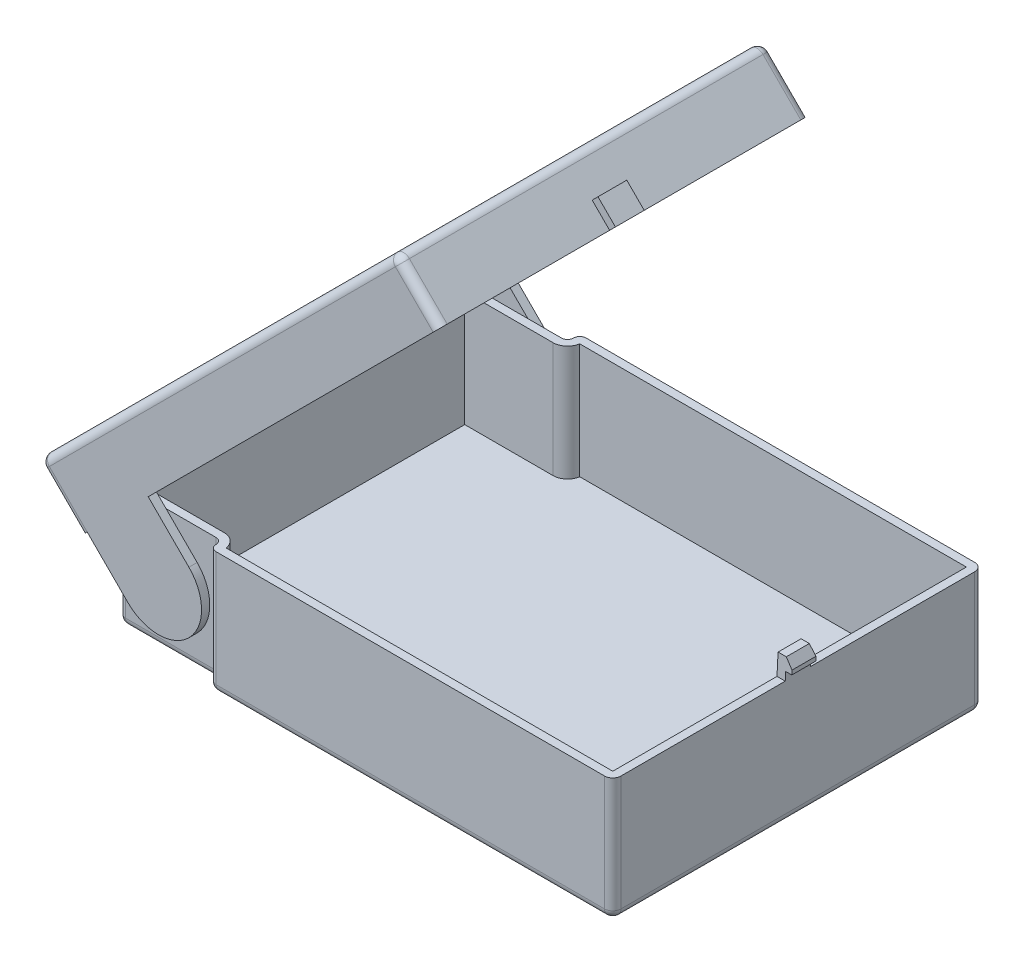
ISO-10303-21;
HEADER;
FILE_DESCRIPTION(('STEP AP214'),'2;1');
FILE_NAME('part.step','',(''),(''),'','','');
FILE_SCHEMA(('AUTOMOTIVE_DESIGN { 1 0 10303 214 1 1 1 1 }'));
ENDSEC;
DATA;
#1=APPLICATION_CONTEXT('core data for automotive mechanical design processes');
#2=APPLICATION_PROTOCOL_DEFINITION('international standard','automotive_design',2000,#1);
#3=PRODUCT_CONTEXT('',#1,'mechanical');
#4=PRODUCT('Part','Part','',(#3));
#5=PRODUCT_RELATED_PRODUCT_CATEGORY('part','',(#4));
#6=PRODUCT_DEFINITION_FORMATION('','',#4);
#7=PRODUCT_DEFINITION_CONTEXT('part definition',#1,'design');
#8=PRODUCT_DEFINITION('design','',#6,#7);
#9=PRODUCT_DEFINITION_SHAPE('','',#8);
#10=(LENGTH_UNIT() NAMED_UNIT(*) SI_UNIT(.MILLI.,.METRE.));
#11=(NAMED_UNIT(*) PLANE_ANGLE_UNIT() SI_UNIT($,.RADIAN.));
#12=(NAMED_UNIT(*) SI_UNIT($,.STERADIAN.) SOLID_ANGLE_UNIT());
#13=UNCERTAINTY_MEASURE_WITH_UNIT(LENGTH_MEASURE(1.E-05),#10,'distance_accuracy_value','');
#14=(GEOMETRIC_REPRESENTATION_CONTEXT(3) GLOBAL_UNCERTAINTY_ASSIGNED_CONTEXT((#13)) GLOBAL_UNIT_ASSIGNED_CONTEXT((#10,
#11,#12)) REPRESENTATION_CONTEXT('',''));
#15=CARTESIAN_POINT('',(0.,0.,0.));
#16=DIRECTION('',(0.,0.,1.));
#17=DIRECTION('',(1.,0.,0.));
#18=AXIS2_PLACEMENT_3D('',#15,#16,#17);
#19=CARTESIAN_POINT('',(8.62920266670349,114.641395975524,45.));
#20=DIRECTION('',(-0.707106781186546,-0.707106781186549,0.));
#21=DIRECTION('',(0.,0.,1.));
#22=AXIS2_PLACEMENT_3D('',#19,#20,#21);
#23=PLANE('',#22);
#24=DIRECTION('',(0.707106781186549,-0.707106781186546,0.));
#25=VECTOR('',#24,1.);
#26=CARTESIAN_POINT('',(19.2358043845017,104.034794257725,3.5));
#27=LINE('',#26,#25);
#28=CARTESIAN_POINT('',(14.9931636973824,108.277434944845,3.5));
#29=VERTEX_POINT('',#28);
#30=CARTESIAN_POINT('',(19.2358043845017,104.034794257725,3.50000000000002));
#31=VERTEX_POINT('',#30);
#32=EDGE_CURVE('E286',#29,#31,#27,.T.);
#33=ORIENTED_EDGE('',*,*,#32,.F.);
#34=DIRECTION('',(0.,0.,1.));
#35=VECTOR('',#34,1.);
#36=CARTESIAN_POINT('',(14.9931636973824,108.277434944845,3.5));
#37=LINE('',#36,#35);
#38=CARTESIAN_POINT('',(14.9931636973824,108.277434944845,-3.5));
#39=VERTEX_POINT('',#38);
#40=EDGE_CURVE('E74',#39,#29,#37,.T.);
#41=ORIENTED_EDGE('',*,*,#40,.F.);
#42=DIRECTION('',(-0.707106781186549,0.707106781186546,0.));
#43=VECTOR('',#42,1.);
#44=CARTESIAN_POINT('',(19.2358043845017,104.034794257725,-3.5));
#45=LINE('',#44,#43);
#46=CARTESIAN_POINT('',(19.2358043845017,104.034794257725,-3.49999999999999));
#47=VERTEX_POINT('',#46);
#48=EDGE_CURVE('E305',#47,#39,#45,.T.);
#49=ORIENTED_EDGE('',*,*,#48,.F.);
#50=DIRECTION('',(0.,0.,-1.));
#51=VECTOR('',#50,1.);
#52=CARTESIAN_POINT('',(19.2358043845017,104.034794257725,45.));
#53=LINE('',#52,#51);
#54=CARTESIAN_POINT('',(19.2358043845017,104.034794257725,-43.));
#55=VERTEX_POINT('',#54);
#56=EDGE_CURVE('E418',#47,#55,#53,.T.);
#57=ORIENTED_EDGE('',*,*,#56,.T.);
#58=DIRECTION('',(0.707106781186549,-0.707106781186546,0.));
#59=VECTOR('',#58,1.);
#60=CARTESIAN_POINT('',(8.62920266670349,114.641395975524,-43.));
#61=LINE('',#60,#59);
#62=CARTESIAN_POINT('',(10.0434162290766,113.22718241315,-43.));
#63=VERTEX_POINT('',#62);
#64=EDGE_CURVE('E13',#55,#63,#61,.F.);
#65=ORIENTED_EDGE('',*,*,#64,.T.);
#66=DIRECTION('',(0.,0.,-1.));
#67=VECTOR('',#66,1.);
#68=CARTESIAN_POINT('',(10.0434162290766,113.22718241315,45.));
#69=LINE('',#68,#67);
#70=CARTESIAN_POINT('',(10.0434162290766,113.22718241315,43.));
#71=VERTEX_POINT('',#70);
#72=EDGE_CURVE('E58',#63,#71,#69,.F.);
#73=ORIENTED_EDGE('',*,*,#72,.T.);
#74=DIRECTION('',(0.707106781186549,-0.707106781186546,0.));
#75=VECTOR('',#74,1.);
#76=CARTESIAN_POINT('',(8.62920266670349,114.641395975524,43.));
#77=LINE('',#76,#75);
#78=CARTESIAN_POINT('',(19.2358043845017,104.034794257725,43.));
#79=VERTEX_POINT('',#78);
#80=EDGE_CURVE('E463',#71,#79,#77,.T.);
#81=ORIENTED_EDGE('',*,*,#80,.T.);
#82=EDGE_CURVE('E419',#79,#31,#53,.T.);
#83=ORIENTED_EDGE('',*,*,#82,.T.);
#84=EDGE_LOOP('',(#33,#41,#49,#57,#65,#73,#81,#83));
#85=FACE_BOUND('',#84,.T.);
#86=ADVANCED_FACE('F49',(#85),#23,.F.);
#87=CARTESIAN_POINT('',(-24.2512626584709,60.5477272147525,0.));
#88=DIRECTION('',(0.707106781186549,-0.707106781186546,0.));
#89=DIRECTION('',(0.,0.,-1.));
#90=AXIS2_PLACEMENT_3D('',#87,#88,#89);
#91=PLANE('',#90);
#92=CARTESIAN_POINT('',(-66.3241161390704,18.4748737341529,-43.));
#93=DIRECTION('',(0.707106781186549,-0.707106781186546,0.));
#94=DIRECTION('',(0.,0.,-1.));
#95=AXIS2_PLACEMENT_3D('',#92,#93,#94);
#96=CIRCLE('',#95,2.);
#97=CARTESIAN_POINT('',(-67.7383297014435,17.0606601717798,-43.));
#98=VERTEX_POINT('',#97);
#99=CARTESIAN_POINT('',(-66.3241161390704,18.4748737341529,-45.));
#100=VERTEX_POINT('',#99);
#101=EDGE_CURVE('E439',#98,#100,#96,.T.);
#102=ORIENTED_EDGE('',*,*,#101,.T.);
#103=DIRECTION('',(0.,0.,-1.));
#104=VECTOR('',#103,1.);
#105=CARTESIAN_POINT('',(-66.3241161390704,18.4748737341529,-43.));
#106=LINE('',#105,#104);
#107=CARTESIAN_POINT('',(-66.3241161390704,18.4748737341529,-43.));
#108=VERTEX_POINT('',#107);
#109=EDGE_CURVE('E340',#108,#100,#106,.T.);
#110=ORIENTED_EDGE('',*,*,#109,.F.);
#111=DIRECTION('',(0.,0.,1.));
#112=VECTOR('',#111,1.);
#113=CARTESIAN_POINT('',(-66.3241161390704,18.4748737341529,0.));
#114=LINE('',#113,#112);
#115=CARTESIAN_POINT('',(-66.3241161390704,18.4748737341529,43.));
#116=VERTEX_POINT('',#115);
#117=EDGE_CURVE('E405',#108,#116,#114,.T.);
#118=ORIENTED_EDGE('',*,*,#117,.T.);
#119=DIRECTION('',(0.,0.,1.));
#120=VECTOR('',#119,1.);
#121=CARTESIAN_POINT('',(-66.3241161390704,18.4748737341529,43.));
#122=LINE('',#121,#120);
#123=CARTESIAN_POINT('',(-66.3241161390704,18.4748737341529,45.));
#124=VERTEX_POINT('',#123);
#125=EDGE_CURVE('E366',#116,#124,#122,.T.);
#126=ORIENTED_EDGE('',*,*,#125,.T.);
#127=CARTESIAN_POINT('',(-66.3241161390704,18.4748737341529,43.));
#128=DIRECTION('',(0.707106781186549,-0.707106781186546,0.));
#129=DIRECTION('',(0.,0.,-1.));
#130=AXIS2_PLACEMENT_3D('',#127,#128,#129);
#131=CIRCLE('',#130,2.);
#132=CARTESIAN_POINT('',(-67.7383297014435,17.0606601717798,43.));
#133=VERTEX_POINT('',#132);
#134=EDGE_CURVE('E431',#124,#133,#131,.T.);
#135=ORIENTED_EDGE('',*,*,#134,.T.);
#136=DIRECTION('',(0.,0.,1.));
#137=VECTOR('',#136,1.);
#138=CARTESIAN_POINT('',(-67.7383297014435,17.0606601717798,45.));
#139=LINE('',#138,#137);
#140=EDGE_CURVE('E386',#98,#133,#139,.T.);
#141=ORIENTED_EDGE('',*,*,#140,.F.);
#142=EDGE_LOOP('',(#102,#110,#118,#126,#135,#141));
#143=FACE_BOUND('',#142,.T.);
#144=ADVANCED_FACE('F569',(#143),#91,.T.);
#145=DIRECTION('',(-0.707106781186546,-0.707106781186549,0.));
#146=VECTOR('',#145,1.);
#147=CARTESIAN_POINT('',(-24.2512626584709,60.5477272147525,-43.));
#148=LINE('',#147,#146);
#149=CARTESIAN_POINT('',(17.8215908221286,102.620580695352,-43.));
#150=VERTEX_POINT('',#149);
#151=CARTESIAN_POINT('',(-51.4748737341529,33.3241161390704,-43.));
#152=VERTEX_POINT('',#151);
#153=EDGE_CURVE('E392',#150,#152,#148,.T.);
#154=ORIENTED_EDGE('',*,*,#153,.T.);
#155=DIRECTION('',(0.,0.,-1.));
#156=VECTOR('',#155,1.);
#157=CARTESIAN_POINT('',(-51.4748737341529,33.3241161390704,-43.));
#158=LINE('',#157,#156);
#159=CARTESIAN_POINT('',(-51.4748737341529,33.3241161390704,-45.));
#160=VERTEX_POINT('',#159);
#161=EDGE_CURVE('E334',#152,#160,#158,.T.);
#162=ORIENTED_EDGE('',*,*,#161,.T.);
#163=DIRECTION('',(-0.707106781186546,-0.707106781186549,0.));
#164=VECTOR('',#163,1.);
#165=CARTESIAN_POINT('',(-67.7383297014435,17.0606601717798,-45.));
#166=LINE('',#165,#164);
#167=CARTESIAN_POINT('',(17.8215908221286,102.620580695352,-45.));
#168=VERTEX_POINT('',#167);
#169=EDGE_CURVE('E421',#168,#160,#166,.T.);
#170=ORIENTED_EDGE('',*,*,#169,.F.);
#171=CARTESIAN_POINT('',(17.8215908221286,102.620580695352,-43.));
#172=DIRECTION('',(0.707106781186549,-0.707106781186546,0.));
#173=DIRECTION('',(0.,0.,-1.));
#174=AXIS2_PLACEMENT_3D('',#171,#172,#173);
#175=CIRCLE('',#174,2.);
#176=EDGE_CURVE('E436',#168,#55,#175,.T.);
#177=ORIENTED_EDGE('',*,*,#176,.T.);
#178=ORIENTED_EDGE('',*,*,#56,.F.);
#179=DIRECTION('',(-0.707106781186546,-0.707106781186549,0.));
#180=VECTOR('',#179,1.);
#181=CARTESIAN_POINT('',(20.6500179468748,105.449007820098,-3.5));
#182=LINE('',#181,#180);
#183=CARTESIAN_POINT('',(20.6500179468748,105.449007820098,-3.5));
#184=VERTEX_POINT('',#183);
#185=EDGE_CURVE('E313',#184,#47,#182,.T.);
#186=ORIENTED_EDGE('',*,*,#185,.F.);
#187=DIRECTION('',(0.,0.,-1.));
#188=VECTOR('',#187,1.);
#189=CARTESIAN_POINT('',(20.6500179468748,105.449007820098,3.5));
#190=LINE('',#189,#188);
#191=CARTESIAN_POINT('',(20.6500179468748,105.449007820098,3.5));
#192=VERTEX_POINT('',#191);
#193=EDGE_CURVE('E296',#192,#184,#190,.T.);
#194=ORIENTED_EDGE('',*,*,#193,.F.);
#195=DIRECTION('',(-0.707106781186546,-0.707106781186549,0.));
#196=VECTOR('',#195,1.);
#197=CARTESIAN_POINT('',(20.6500179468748,105.449007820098,3.5));
#198=LINE('',#197,#196);
#199=EDGE_CURVE('E316',#192,#31,#198,.T.);
#200=ORIENTED_EDGE('',*,*,#199,.T.);
#201=ORIENTED_EDGE('',*,*,#82,.F.);
#202=CARTESIAN_POINT('',(17.8215908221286,102.620580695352,43.));
#203=DIRECTION('',(0.707106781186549,-0.707106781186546,0.));
#204=DIRECTION('',(0.,0.,-1.));
#205=AXIS2_PLACEMENT_3D('',#202,#203,#204);
#206=CIRCLE('',#205,2.);
#207=CARTESIAN_POINT('',(17.8215908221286,102.620580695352,45.));
#208=VERTEX_POINT('',#207);
#209=EDGE_CURVE('E433',#79,#208,#206,.T.);
#210=ORIENTED_EDGE('',*,*,#209,.T.);
#211=DIRECTION('',(0.707106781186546,0.707106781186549,0.));
#212=VECTOR('',#211,1.);
#213=CARTESIAN_POINT('',(-67.7383297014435,17.0606601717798,45.));
#214=LINE('',#213,#212);
#215=CARTESIAN_POINT('',(-51.4748737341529,33.3241161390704,45.));
#216=VERTEX_POINT('',#215);
#217=EDGE_CURVE('E416',#216,#208,#214,.T.);
#218=ORIENTED_EDGE('',*,*,#217,.F.);
#219=DIRECTION('',(0.,0.,1.));
#220=VECTOR('',#219,1.);
#221=CARTESIAN_POINT('',(-51.4748737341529,33.3241161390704,43.));
#222=LINE('',#221,#220);
#223=CARTESIAN_POINT('',(-51.4748737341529,33.3241161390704,43.));
#224=VERTEX_POINT('',#223);
#225=EDGE_CURVE('E374',#224,#216,#222,.T.);
#226=ORIENTED_EDGE('',*,*,#225,.F.);
#227=DIRECTION('',(0.707106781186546,0.707106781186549,0.));
#228=VECTOR('',#227,1.);
#229=CARTESIAN_POINT('',(-24.2512626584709,60.5477272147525,43.));
#230=LINE('',#229,#228);
#231=CARTESIAN_POINT('',(17.8215908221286,102.620580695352,43.));
#232=VERTEX_POINT('',#231);
#233=EDGE_CURVE('E408',#224,#232,#230,.T.);
#234=ORIENTED_EDGE('',*,*,#233,.T.);
#235=DIRECTION('',(0.,0.,-1.));
#236=VECTOR('',#235,1.);
#237=CARTESIAN_POINT('',(17.8215908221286,102.620580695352,0.));
#238=LINE('',#237,#236);
#239=EDGE_CURVE('E410',#232,#150,#238,.T.);
#240=ORIENTED_EDGE('',*,*,#239,.T.);
#241=EDGE_LOOP('',(#154,#162,#170,#177,#178,#186,#194,#200,#201,#210,#218,#226,#234,#240));
#242=FACE_BOUND('',#241,.T.);
#243=ADVANCED_FACE('F511',(#242),#91,.T.);
#244=CARTESIAN_POINT('',(-78.3449314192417,27.667261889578,45.));
#245=DIRECTION('',(0.707106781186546,0.707106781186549,0.));
#246=DIRECTION('',(0.,0.,-1.));
#247=AXIS2_PLACEMENT_3D('',#244,#245,#246);
#248=PLANE('',#247);
#249=DIRECTION('',(0.,0.,1.));
#250=VECTOR('',#249,1.);
#251=CARTESIAN_POINT('',(-76.9307178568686,26.2530483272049,45.));
#252=LINE('',#251,#250);
#253=CARTESIAN_POINT('',(-76.9307178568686,26.2530483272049,43.));
#254=VERTEX_POINT('',#253);
#255=CARTESIAN_POINT('',(-76.9307178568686,26.2530483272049,-43.));
#256=VERTEX_POINT('',#255);
#257=EDGE_CURVE('E426',#254,#256,#252,.F.);
#258=ORIENTED_EDGE('',*,*,#257,.T.);
#259=DIRECTION('',(0.707106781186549,-0.707106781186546,0.));
#260=VECTOR('',#259,1.);
#261=CARTESIAN_POINT('',(-78.3449314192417,27.667261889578,-43.));
#262=LINE('',#261,#260);
#263=EDGE_CURVE('E428',#256,#98,#262,.T.);
#264=ORIENTED_EDGE('',*,*,#263,.T.);
#265=ORIENTED_EDGE('',*,*,#140,.T.);
#266=DIRECTION('',(0.707106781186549,-0.707106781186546,0.));
#267=VECTOR('',#266,1.);
#268=CARTESIAN_POINT('',(-78.3449314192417,27.667261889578,43.));
#269=LINE('',#268,#267);
#270=EDGE_CURVE('E424',#133,#254,#269,.F.);
#271=ORIENTED_EDGE('',*,*,#270,.T.);
#272=EDGE_LOOP('',(#258,#264,#265,#271));
#273=FACE_BOUND('',#272,.T.);
#274=ADVANCED_FACE('F571',(#273),#248,.F.);
#275=CARTESIAN_POINT('',(-78.3449314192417,27.667261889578,45.));
#276=DIRECTION('',(0.,0.,-1.));
#277=DIRECTION('',(-0.707106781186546,-0.707106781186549,0.));
#278=AXIS2_PLACEMENT_3D('',#275,#276,#277);
#279=PLANE('',#278);
#280=DIRECTION('',(0.707106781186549,-0.707106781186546,0.));
#281=VECTOR('',#280,1.);
#282=CARTESIAN_POINT('',(-76.9307178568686,29.0814754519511,45.));
#283=LINE('',#282,#281);
#284=CARTESIAN_POINT('',(-75.5165042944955,27.667261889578,45.));
#285=VERTEX_POINT('',#284);
#286=EDGE_CURVE('E456',#285,#124,#283,.T.);
#287=ORIENTED_EDGE('',*,*,#286,.T.);
#288=DIRECTION('',(0.707106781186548,-0.707106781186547,0.));
#289=VECTOR('',#288,1.);
#290=CARTESIAN_POINT('',(-66.3241161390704,18.4748737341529,45.));
#291=LINE('',#290,#289);
#292=CARTESIAN_POINT('',(-56.4246212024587,8.57537879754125,45.));
#293=VERTEX_POINT('',#292);
#294=EDGE_CURVE('E354',#124,#293,#291,.T.);
#295=ORIENTED_EDGE('',*,*,#294,.T.);
#296=CARTESIAN_POINT('',(-49.,16.,45.));
#297=DIRECTION('',(0.,0.,1.));
#298=DIRECTION('',(0.707106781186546,0.707106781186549,0.));
#299=AXIS2_PLACEMENT_3D('',#296,#297,#298);
#300=CIRCLE('',#299,10.5);
#301=CARTESIAN_POINT('',(-41.5753787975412,23.4246212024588,45.));
#302=VERTEX_POINT('',#301);
#303=EDGE_CURVE('E369',#293,#302,#300,.T.);
#304=ORIENTED_EDGE('',*,*,#303,.T.);
#305=DIRECTION('',(-0.707106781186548,0.707106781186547,0.));
#306=VECTOR('',#305,1.);
#307=CARTESIAN_POINT('',(-41.5753787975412,23.4246212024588,45.));
#308=LINE('',#307,#306);
#309=EDGE_CURVE('E361',#302,#216,#308,.T.);
#310=ORIENTED_EDGE('',*,*,#309,.T.);
#311=ORIENTED_EDGE('',*,*,#217,.T.);
#312=DIRECTION('',(0.707106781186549,-0.707106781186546,0.));
#313=VECTOR('',#312,1.);
#314=CARTESIAN_POINT('',(7.2149891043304,113.22718241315,45.));
#315=LINE('',#314,#313);
#316=CARTESIAN_POINT('',(8.62920266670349,111.812968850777,45.));
#317=VERTEX_POINT('',#316);
#318=EDGE_CURVE('E461',#208,#317,#315,.F.);
#319=ORIENTED_EDGE('',*,*,#318,.T.);
#320=DIRECTION('',(0.707106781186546,0.707106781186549,0.));
#321=VECTOR('',#320,1.);
#322=CARTESIAN_POINT('',(-76.9307178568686,26.2530483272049,45.));
#323=LINE('',#322,#321);
#324=EDGE_CURVE('E459',#317,#285,#323,.F.);
#325=ORIENTED_EDGE('',*,*,#324,.T.);
#326=EDGE_LOOP('',(#287,#295,#304,#310,#311,#319,#325));
#327=FACE_BOUND('',#326,.T.);
#328=ADVANCED_FACE('F562',(#327),#279,.F.);
#329=CARTESIAN_POINT('',(-78.3449314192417,27.667261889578,-45.));
#330=DIRECTION('',(0.,0.,1.));
#331=DIRECTION('',(0.707106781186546,0.707106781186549,0.));
#332=AXIS2_PLACEMENT_3D('',#329,#330,#331);
#333=PLANE('',#332);
#334=ORIENTED_EDGE('',*,*,#169,.T.);
#335=DIRECTION('',(-0.707106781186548,0.707106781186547,0.));
#336=VECTOR('',#335,1.);
#337=CARTESIAN_POINT('',(-41.5753787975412,23.4246212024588,-45.));
#338=LINE('',#337,#336);
#339=CARTESIAN_POINT('',(-41.5753787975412,23.4246212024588,-45.));
#340=VERTEX_POINT('',#339);
#341=EDGE_CURVE('E323',#340,#160,#338,.T.);
#342=ORIENTED_EDGE('',*,*,#341,.F.);
#343=CARTESIAN_POINT('',(-49.,16.,-45.));
#344=DIRECTION('',(0.,0.,1.));
#345=DIRECTION('',(0.707106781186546,0.707106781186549,0.));
#346=AXIS2_PLACEMENT_3D('',#343,#344,#345);
#347=CIRCLE('',#346,10.5);
#348=CARTESIAN_POINT('',(-56.4246212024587,8.57537879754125,-45.));
#349=VERTEX_POINT('',#348);
#350=EDGE_CURVE('E337',#349,#340,#347,.T.);
#351=ORIENTED_EDGE('',*,*,#350,.F.);
#352=DIRECTION('',(0.707106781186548,-0.707106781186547,0.));
#353=VECTOR('',#352,1.);
#354=CARTESIAN_POINT('',(-66.3241161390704,18.4748737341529,-45.));
#355=LINE('',#354,#353);
#356=EDGE_CURVE('E330',#100,#349,#355,.T.);
#357=ORIENTED_EDGE('',*,*,#356,.F.);
#358=DIRECTION('',(0.707106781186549,-0.707106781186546,0.));
#359=VECTOR('',#358,1.);
#360=CARTESIAN_POINT('',(-76.9307178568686,29.0814754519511,-45.));
#361=LINE('',#360,#359);
#362=CARTESIAN_POINT('',(-75.5165042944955,27.667261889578,-45.));
#363=VERTEX_POINT('',#362);
#364=EDGE_CURVE('E445',#100,#363,#361,.F.);
#365=ORIENTED_EDGE('',*,*,#364,.T.);
#366=DIRECTION('',(-0.707106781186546,-0.707106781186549,0.));
#367=VECTOR('',#366,1.);
#368=CARTESIAN_POINT('',(-76.9307178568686,26.2530483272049,-45.));
#369=LINE('',#368,#367);
#370=CARTESIAN_POINT('',(8.62920266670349,111.812968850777,-45.));
#371=VERTEX_POINT('',#370);
#372=EDGE_CURVE('E443',#363,#371,#369,.F.);
#373=ORIENTED_EDGE('',*,*,#372,.T.);
#374=DIRECTION('',(0.707106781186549,-0.707106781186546,0.));
#375=VECTOR('',#374,1.);
#376=CARTESIAN_POINT('',(7.2149891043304,113.22718241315,-45.));
#377=LINE('',#376,#375);
#378=EDGE_CURVE('E441',#371,#168,#377,.T.);
#379=ORIENTED_EDGE('',*,*,#378,.T.);
#380=EDGE_LOOP('',(#334,#342,#351,#357,#365,#373,#379));
#381=FACE_BOUND('',#380,.T.);
#382=ADVANCED_FACE('F634',(#381),#333,.F.);
#383=CARTESIAN_POINT('',(-34.8578643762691,71.1543289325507,0.));
#384=DIRECTION('',(0.707106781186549,-0.707106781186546,0.));
#385=DIRECTION('',(0.,0.,-1.));
#386=AXIS2_PLACEMENT_3D('',#383,#384,#385);
#387=PLANE('',#386);
#388=DIRECTION('',(0.,0.,1.));
#389=VECTOR('',#388,1.);
#390=CARTESIAN_POINT('',(-76.9307178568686,29.0814754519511,0.));
#391=LINE('',#390,#389);
#392=CARTESIAN_POINT('',(-76.9307178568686,29.0814754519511,-43.));
#393=VERTEX_POINT('',#392);
#394=CARTESIAN_POINT('',(-76.9307178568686,29.0814754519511,43.));
#395=VERTEX_POINT('',#394);
#396=EDGE_CURVE('E451',#393,#395,#391,.T.);
#397=ORIENTED_EDGE('',*,*,#396,.T.);
#398=DIRECTION('',(0.707106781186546,0.707106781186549,0.));
#399=VECTOR('',#398,1.);
#400=CARTESIAN_POINT('',(-34.8578643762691,71.1543289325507,43.));
#401=LINE('',#400,#399);
#402=CARTESIAN_POINT('',(7.2149891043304,113.22718241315,43.));
#403=VERTEX_POINT('',#402);
#404=EDGE_CURVE('E453',#395,#403,#401,.T.);
#405=ORIENTED_EDGE('',*,*,#404,.T.);
#406=DIRECTION('',(0.,0.,-1.));
#407=VECTOR('',#406,1.);
#408=CARTESIAN_POINT('',(7.2149891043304,113.22718241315,0.));
#409=LINE('',#408,#407);
#410=CARTESIAN_POINT('',(7.2149891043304,113.22718241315,-43.));
#411=VERTEX_POINT('',#410);
#412=EDGE_CURVE('E447',#403,#411,#409,.T.);
#413=ORIENTED_EDGE('',*,*,#412,.T.);
#414=DIRECTION('',(-0.707106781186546,-0.707106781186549,0.));
#415=VECTOR('',#414,1.);
#416=CARTESIAN_POINT('',(-34.8578643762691,71.1543289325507,-43.));
#417=LINE('',#416,#415);
#418=EDGE_CURVE('E449',#411,#393,#417,.T.);
#419=ORIENTED_EDGE('',*,*,#418,.T.);
#420=EDGE_LOOP('',(#397,#405,#413,#419));
#421=FACE_BOUND('',#420,.T.);
#422=ADVANCED_FACE('F546',(#421),#387,.F.);
#423=CARTESIAN_POINT('',(-76.9307178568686,29.0814754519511,45.));
#424=DIRECTION('',(0.707106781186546,0.707106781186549,0.));
#425=DIRECTION('',(0.,0.,-1.));
#426=AXIS2_PLACEMENT_3D('',#423,#424,#425);
#427=PLANE('',#426);
#428=ORIENTED_EDGE('',*,*,#117,.F.);
#429=DIRECTION('',(0.707106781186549,-0.707106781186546,0.));
#430=VECTOR('',#429,1.);
#431=CARTESIAN_POINT('',(-76.9307178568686,29.0814754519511,-43.));
#432=LINE('',#431,#430);
#433=CARTESIAN_POINT('',(-75.5165042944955,27.667261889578,-43.));
#434=VERTEX_POINT('',#433);
#435=EDGE_CURVE('E393',#434,#108,#432,.T.);
#436=ORIENTED_EDGE('',*,*,#435,.F.);
#437=DIRECTION('',(0.,0.,1.));
#438=VECTOR('',#437,1.);
#439=CARTESIAN_POINT('',(-75.5165042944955,27.667261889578,0.));
#440=LINE('',#439,#438);
#441=CARTESIAN_POINT('',(-75.5165042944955,27.667261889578,43.));
#442=VERTEX_POINT('',#441);
#443=EDGE_CURVE('E388',#434,#442,#440,.T.);
#444=ORIENTED_EDGE('',*,*,#443,.T.);
#445=DIRECTION('',(0.707106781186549,-0.707106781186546,0.));
#446=VECTOR('',#445,1.);
#447=CARTESIAN_POINT('',(-76.9307178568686,29.0814754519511,43.));
#448=LINE('',#447,#446);
#449=EDGE_CURVE('E383',#442,#116,#448,.T.);
#450=ORIENTED_EDGE('',*,*,#449,.T.);
#451=EDGE_LOOP('',(#428,#436,#444,#450));
#452=FACE_BOUND('',#451,.T.);
#453=ADVANCED_FACE('F592',(#452),#427,.T.);
#454=CARTESIAN_POINT('',(-78.3449314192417,27.667261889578,43.));
#455=DIRECTION('',(0.,0.,-1.));
#456=DIRECTION('',(-0.707106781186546,-0.707106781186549,0.));
#457=AXIS2_PLACEMENT_3D('',#454,#455,#456);
#458=PLANE('',#457);
#459=CARTESIAN_POINT('',(-49.,16.,43.));
#460=DIRECTION('',(0.,0.,1.));
#461=DIRECTION('',(0.707106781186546,0.707106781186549,0.));
#462=AXIS2_PLACEMENT_3D('',#459,#460,#461);
#463=CIRCLE('',#462,1.25);
#464=CARTESIAN_POINT('',(-48.1161165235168,16.8838834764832,43.));
#465=VERTEX_POINT('',#464);
#466=EDGE_CURVE('E343',#465,#465,#463,.T.);
#467=ORIENTED_EDGE('',*,*,#466,.T.);
#468=EDGE_LOOP('',(#467));
#469=FACE_BOUND('',#468,.T.);
#470=ORIENTED_EDGE('',*,*,#233,.F.);
#471=DIRECTION('',(-0.707106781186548,0.707106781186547,0.));
#472=VECTOR('',#471,1.);
#473=CARTESIAN_POINT('',(-41.5753787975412,23.4246212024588,43.));
#474=LINE('',#473,#472);
#475=CARTESIAN_POINT('',(-41.5753787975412,23.4246212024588,43.));
#476=VERTEX_POINT('',#475);
#477=EDGE_CURVE('E364',#476,#224,#474,.T.);
#478=ORIENTED_EDGE('',*,*,#477,.F.);
#479=CARTESIAN_POINT('',(-49.,16.,43.));
#480=DIRECTION('',(0.,0.,1.));
#481=DIRECTION('',(0.707106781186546,0.707106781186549,0.));
#482=AXIS2_PLACEMENT_3D('',#479,#480,#481);
#483=CIRCLE('',#482,10.5);
#484=CARTESIAN_POINT('',(-56.4246212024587,8.57537879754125,43.));
#485=VERTEX_POINT('',#484);
#486=EDGE_CURVE('E360',#485,#476,#483,.T.);
#487=ORIENTED_EDGE('',*,*,#486,.F.);
#488=DIRECTION('',(0.707106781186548,-0.707106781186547,0.));
#489=VECTOR('',#488,1.);
#490=CARTESIAN_POINT('',(-66.3241161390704,18.4748737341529,43.));
#491=LINE('',#490,#489);
#492=EDGE_CURVE('E357',#116,#485,#491,.T.);
#493=ORIENTED_EDGE('',*,*,#492,.F.);
#494=ORIENTED_EDGE('',*,*,#449,.F.);
#495=DIRECTION('',(0.707106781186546,0.707106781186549,0.));
#496=VECTOR('',#495,1.);
#497=CARTESIAN_POINT('',(-33.443650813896,69.7401153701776,43.));
#498=LINE('',#497,#496);
#499=CARTESIAN_POINT('',(8.62920266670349,111.812968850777,43.));
#500=VERTEX_POINT('',#499);
#501=EDGE_CURVE('E391',#442,#500,#498,.T.);
#502=ORIENTED_EDGE('',*,*,#501,.T.);
#503=DIRECTION('',(0.707106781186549,-0.707106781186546,0.));
#504=VECTOR('',#503,1.);
#505=CARTESIAN_POINT('',(7.2149891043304,113.22718241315,43.));
#506=LINE('',#505,#504);
#507=EDGE_CURVE('E387',#500,#232,#506,.T.);
#508=ORIENTED_EDGE('',*,*,#507,.T.);
#509=EDGE_LOOP('',(#470,#478,#487,#493,#494,#502,#508));
#510=FACE_BOUND('',#509,.T.);
#511=ADVANCED_FACE('F600',(#469,#510),#458,.T.);
#512=CARTESIAN_POINT('',(7.2149891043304,113.22718241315,45.));
#513=DIRECTION('',(-0.707106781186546,-0.707106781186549,0.));
#514=DIRECTION('',(0.,0.,1.));
#515=AXIS2_PLACEMENT_3D('',#512,#513,#514);
#516=PLANE('',#515);
#517=DIRECTION('',(0.706137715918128,-0.706137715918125,0.0523359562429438));
#518=VECTOR('',#517,1.);
#519=CARTESIAN_POINT('',(14.2153462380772,106.226825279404,2.7947592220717));
#520=LINE('',#519,#518);
#521=CARTESIAN_POINT('',(14.2153462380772,106.226825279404,2.7947592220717));
#522=VERTEX_POINT('',#521);
#523=CARTESIAN_POINT('',(17.1144840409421,103.327687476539,3.00963111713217));
#524=VERTEX_POINT('',#523);
#525=EDGE_CURVE('E292',#522,#524,#520,.T.);
#526=ORIENTED_EDGE('',*,*,#525,.T.);
#527=DIRECTION('',(0.,0.,1.));
#528=VECTOR('',#527,1.);
#529=CARTESIAN_POINT('',(17.1144840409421,103.327687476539,0.));
#530=LINE('',#529,#528);
#531=CARTESIAN_POINT('',(17.1144840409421,103.327687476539,-3.00963111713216));
#532=VERTEX_POINT('',#531);
#533=EDGE_CURVE('E273',#532,#524,#530,.T.);
#534=ORIENTED_EDGE('',*,*,#533,.F.);
#535=DIRECTION('',(0.706137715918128,-0.706137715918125,-0.0523359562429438));
#536=VECTOR('',#535,1.);
#537=CARTESIAN_POINT('',(14.1120620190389,106.330109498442,-2.7871042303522));
#538=LINE('',#537,#536);
#539=CARTESIAN_POINT('',(14.2153462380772,106.226825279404,-2.7947592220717));
#540=VERTEX_POINT('',#539);
#541=EDGE_CURVE('E264',#540,#532,#538,.T.);
#542=ORIENTED_EDGE('',*,*,#541,.F.);
#543=DIRECTION('',(0.,0.,-1.));
#544=VECTOR('',#543,1.);
#545=CARTESIAN_POINT('',(14.2153462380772,106.226825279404,0.));
#546=LINE('',#545,#544);
#547=EDGE_CURVE('E247',#522,#540,#546,.T.);
#548=ORIENTED_EDGE('',*,*,#547,.F.);
#549=EDGE_LOOP('',(#526,#534,#542,#548));
#550=FACE_BOUND('',#549,.T.);
#551=ORIENTED_EDGE('',*,*,#239,.F.);
#552=ORIENTED_EDGE('',*,*,#507,.F.);
#553=DIRECTION('',(0.,0.,-1.));
#554=VECTOR('',#553,1.);
#555=CARTESIAN_POINT('',(8.62920266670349,111.812968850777,0.));
#556=LINE('',#555,#554);
#557=CARTESIAN_POINT('',(8.62920266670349,111.812968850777,-43.));
#558=VERTEX_POINT('',#557);
#559=EDGE_CURVE('E401',#500,#558,#556,.T.);
#560=ORIENTED_EDGE('',*,*,#559,.T.);
#561=DIRECTION('',(0.707106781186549,-0.707106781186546,0.));
#562=VECTOR('',#561,1.);
#563=CARTESIAN_POINT('',(7.2149891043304,113.22718241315,-43.));
#564=LINE('',#563,#562);
#565=EDGE_CURVE('E396',#558,#150,#564,.T.);
#566=ORIENTED_EDGE('',*,*,#565,.T.);
#567=EDGE_LOOP('',(#551,#552,#560,#566));
#568=FACE_BOUND('',#567,.T.);
#569=ADVANCED_FACE('F271',(#550,#568),#516,.T.);
#570=CARTESIAN_POINT('',(-78.3449314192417,27.667261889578,-43.));
#571=DIRECTION('',(0.,0.,1.));
#572=DIRECTION('',(0.707106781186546,0.707106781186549,0.));
#573=AXIS2_PLACEMENT_3D('',#570,#571,#572);
#574=PLANE('',#573);
#575=CARTESIAN_POINT('',(-49.,16.,-43.));
#576=DIRECTION('',(0.,0.,1.));
#577=DIRECTION('',(0.707106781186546,0.707106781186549,0.));
#578=AXIS2_PLACEMENT_3D('',#575,#576,#577);
#579=CIRCLE('',#578,1.25);
#580=CARTESIAN_POINT('',(-48.1161165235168,16.8838834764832,-43.));
#581=VERTEX_POINT('',#580);
#582=EDGE_CURVE('E319',#581,#581,#579,.T.);
#583=ORIENTED_EDGE('',*,*,#582,.F.);
#584=EDGE_LOOP('',(#583));
#585=FACE_BOUND('',#584,.T.);
#586=ORIENTED_EDGE('',*,*,#153,.F.);
#587=ORIENTED_EDGE('',*,*,#565,.F.);
#588=DIRECTION('',(-0.707106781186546,-0.707106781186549,0.));
#589=VECTOR('',#588,1.);
#590=CARTESIAN_POINT('',(-33.443650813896,69.7401153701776,-43.));
#591=LINE('',#590,#589);
#592=EDGE_CURVE('E397',#558,#434,#591,.T.);
#593=ORIENTED_EDGE('',*,*,#592,.T.);
#594=ORIENTED_EDGE('',*,*,#435,.T.);
#595=DIRECTION('',(0.707106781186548,-0.707106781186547,0.));
#596=VECTOR('',#595,1.);
#597=CARTESIAN_POINT('',(-66.3241161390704,18.4748737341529,-43.));
#598=LINE('',#597,#596);
#599=CARTESIAN_POINT('',(-56.4246212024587,8.57537879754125,-43.));
#600=VERTEX_POINT('',#599);
#601=EDGE_CURVE('E332',#108,#600,#598,.T.);
#602=ORIENTED_EDGE('',*,*,#601,.T.);
#603=CARTESIAN_POINT('',(-49.,16.,-43.));
#604=DIRECTION('',(0.,0.,1.));
#605=DIRECTION('',(0.707106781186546,0.707106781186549,0.));
#606=AXIS2_PLACEMENT_3D('',#603,#604,#605);
#607=CIRCLE('',#606,10.5);
#608=CARTESIAN_POINT('',(-41.5753787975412,23.4246212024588,-43.));
#609=VERTEX_POINT('',#608);
#610=EDGE_CURVE('E329',#600,#609,#607,.T.);
#611=ORIENTED_EDGE('',*,*,#610,.T.);
#612=DIRECTION('',(-0.707106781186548,0.707106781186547,0.));
#613=VECTOR('',#612,1.);
#614=CARTESIAN_POINT('',(-41.5753787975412,23.4246212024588,-43.));
#615=LINE('',#614,#613);
#616=EDGE_CURVE('E326',#609,#152,#615,.T.);
#617=ORIENTED_EDGE('',*,*,#616,.T.);
#618=EDGE_LOOP('',(#586,#587,#593,#594,#602,#611,#617));
#619=FACE_BOUND('',#618,.T.);
#620=ADVANCED_FACE('F585',(#585,#619),#574,.T.);
#621=CARTESIAN_POINT('',(-33.443650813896,69.7401153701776,0.));
#622=DIRECTION('',(0.707106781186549,-0.707106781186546,0.));
#623=DIRECTION('',(0.,0.,-1.));
#624=AXIS2_PLACEMENT_3D('',#621,#622,#623);
#625=PLANE('',#624);
#626=ORIENTED_EDGE('',*,*,#443,.F.);
#627=ORIENTED_EDGE('',*,*,#592,.F.);
#628=ORIENTED_EDGE('',*,*,#559,.F.);
#629=ORIENTED_EDGE('',*,*,#501,.F.);
#630=EDGE_LOOP('',(#626,#627,#628,#629));
#631=FACE_BOUND('',#630,.T.);
#632=ADVANCED_FACE('F595',(#631),#625,.T.);
#633=CARTESIAN_POINT('',(7.2149891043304,113.22718241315,43.));
#634=DIRECTION('',(0.707106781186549,-0.707106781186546,0.));
#635=DIRECTION('',(0.,0.,-1.));
#636=AXIS2_PLACEMENT_3D('',#633,#634,#635);
#637=CYLINDRICAL_SURFACE('',#636,2.);
#638=CARTESIAN_POINT('',(8.62920266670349,111.812968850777,43.));
#639=DIRECTION('',(-0.707106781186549,0.707106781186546,0.));
#640=DIRECTION('',(0.,0.,1.));
#641=AXIS2_PLACEMENT_3D('',#638,#639,#640);
#642=CIRCLE('',#641,2.);
#643=EDGE_CURVE('E53',#317,#71,#642,.T.);
#644=ORIENTED_EDGE('',*,*,#643,.F.);
#645=ORIENTED_EDGE('',*,*,#318,.F.);
#646=ORIENTED_EDGE('',*,*,#209,.F.);
#647=ORIENTED_EDGE('',*,*,#80,.F.);
#648=EDGE_LOOP('',(#644,#645,#646,#647));
#649=FACE_BOUND('',#648,.T.);
#650=ADVANCED_FACE('F51',(#649),#637,.T.);
#651=CARTESIAN_POINT('',(8.62920266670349,111.812968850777,43.));
#652=DIRECTION('',(0.,0.,1.));
#653=DIRECTION('',(0.707106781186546,0.707106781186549,0.));
#654=AXIS2_PLACEMENT_3D('',#651,#652,#653);
#655=SPHERICAL_SURFACE('',#654,2.);
#656=CARTESIAN_POINT('',(8.62920266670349,111.812968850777,43.));
#657=DIRECTION('',(0.707106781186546,0.707106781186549,0.));
#658=DIRECTION('',(0.,0.,-1.));
#659=AXIS2_PLACEMENT_3D('',#656,#657,#658);
#660=CIRCLE('',#659,2.);
#661=EDGE_CURVE('E492',#317,#403,#660,.F.);
#662=ORIENTED_EDGE('',*,*,#661,.F.);
#663=ORIENTED_EDGE('',*,*,#643,.T.);
#664=CARTESIAN_POINT('',(8.62920266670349,111.812968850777,43.));
#665=DIRECTION('',(0.,0.,1.));
#666=DIRECTION('',(0.707106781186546,0.707106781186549,0.));
#667=AXIS2_PLACEMENT_3D('',#664,#665,#666);
#668=CIRCLE('',#667,2.);
#669=EDGE_CURVE('E494',#403,#71,#668,.F.);
#670=ORIENTED_EDGE('',*,*,#669,.F.);
#671=EDGE_LOOP('',(#662,#663,#670));
#672=FACE_BOUND('',#671,.T.);
#673=ADVANCED_FACE('F503',(#672),#655,.T.);
#674=CARTESIAN_POINT('',(7.2149891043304,113.22718241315,-43.));
#675=DIRECTION('',(0.707106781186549,-0.707106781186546,0.));
#676=DIRECTION('',(0.,0.,-1.));
#677=AXIS2_PLACEMENT_3D('',#674,#675,#676);
#678=CYLINDRICAL_SURFACE('',#677,2.);
#679=ORIENTED_EDGE('',*,*,#176,.F.);
#680=ORIENTED_EDGE('',*,*,#378,.F.);
#681=CARTESIAN_POINT('',(8.62920266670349,111.812968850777,-43.));
#682=DIRECTION('',(-0.707106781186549,0.707106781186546,0.));
#683=DIRECTION('',(0.,0.,1.));
#684=AXIS2_PLACEMENT_3D('',#681,#682,#683);
#685=CIRCLE('',#684,2.);
#686=EDGE_CURVE('E489',#63,#371,#685,.T.);
#687=ORIENTED_EDGE('',*,*,#686,.F.);
#688=ORIENTED_EDGE('',*,*,#64,.F.);
#689=EDGE_LOOP('',(#679,#680,#687,#688));
#690=FACE_BOUND('',#689,.T.);
#691=ADVANCED_FACE('F533',(#690),#678,.T.);
#692=CARTESIAN_POINT('',(8.62920266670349,111.812968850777,0.));
#693=DIRECTION('',(0.,0.,-1.));
#694=DIRECTION('',(-0.707106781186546,-0.707106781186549,0.));
#695=AXIS2_PLACEMENT_3D('',#692,#693,#694);
#696=CYLINDRICAL_SURFACE('',#695,2.);
#697=ORIENTED_EDGE('',*,*,#669,.T.);
#698=ORIENTED_EDGE('',*,*,#72,.F.);
#699=CARTESIAN_POINT('',(8.62920266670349,111.812968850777,-43.));
#700=DIRECTION('',(0.,0.,-1.));
#701=DIRECTION('',(-0.707106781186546,-0.707106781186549,0.));
#702=AXIS2_PLACEMENT_3D('',#699,#700,#701);
#703=CIRCLE('',#702,2.);
#704=EDGE_CURVE('E486',#411,#63,#703,.T.);
#705=ORIENTED_EDGE('',*,*,#704,.F.);
#706=ORIENTED_EDGE('',*,*,#412,.F.);
#707=EDGE_LOOP('',(#697,#698,#705,#706));
#708=FACE_BOUND('',#707,.T.);
#709=ADVANCED_FACE('F535',(#708),#696,.T.);
#710=CARTESIAN_POINT('',(-33.443650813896,69.7401153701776,43.));
#711=DIRECTION('',(0.707106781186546,0.707106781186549,0.));
#712=DIRECTION('',(0.,0.,-1.));
#713=AXIS2_PLACEMENT_3D('',#710,#711,#712);
#714=CYLINDRICAL_SURFACE('',#713,2.);
#715=ORIENTED_EDGE('',*,*,#661,.T.);
#716=ORIENTED_EDGE('',*,*,#404,.F.);
#717=CARTESIAN_POINT('',(-75.5165042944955,27.667261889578,43.));
#718=DIRECTION('',(-0.707106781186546,-0.707106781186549,0.));
#719=DIRECTION('',(0.,0.,1.));
#720=AXIS2_PLACEMENT_3D('',#717,#718,#719);
#721=CIRCLE('',#720,2.);
#722=EDGE_CURVE('E483',#285,#395,#721,.T.);
#723=ORIENTED_EDGE('',*,*,#722,.F.);
#724=ORIENTED_EDGE('',*,*,#324,.F.);
#725=EDGE_LOOP('',(#715,#716,#723,#724));
#726=FACE_BOUND('',#725,.T.);
#727=ADVANCED_FACE('F559',(#726),#714,.T.);
#728=CARTESIAN_POINT('',(-76.9307178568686,29.0814754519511,43.));
#729=DIRECTION('',(0.707106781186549,-0.707106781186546,0.));
#730=DIRECTION('',(0.,0.,-1.));
#731=AXIS2_PLACEMENT_3D('',#728,#729,#730);
#732=CYLINDRICAL_SURFACE('',#731,2.);
#733=ORIENTED_EDGE('',*,*,#134,.F.);
#734=ORIENTED_EDGE('',*,*,#286,.F.);
#735=CARTESIAN_POINT('',(-75.5165042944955,27.667261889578,43.));
#736=DIRECTION('',(-0.707106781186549,0.707106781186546,0.));
#737=DIRECTION('',(0.,0.,1.));
#738=AXIS2_PLACEMENT_3D('',#735,#736,#737);
#739=CIRCLE('',#738,2.);
#740=EDGE_CURVE('E480',#254,#285,#739,.T.);
#741=ORIENTED_EDGE('',*,*,#740,.F.);
#742=ORIENTED_EDGE('',*,*,#270,.F.);
#743=EDGE_LOOP('',(#733,#734,#741,#742));
#744=FACE_BOUND('',#743,.T.);
#745=ADVANCED_FACE('F565',(#744),#732,.T.);
#746=CARTESIAN_POINT('',(8.62920266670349,111.812968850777,-43.));
#747=DIRECTION('',(0.,0.,1.));
#748=DIRECTION('',(0.707106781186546,0.707106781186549,0.));
#749=AXIS2_PLACEMENT_3D('',#746,#747,#748);
#750=SPHERICAL_SURFACE('',#749,2.);
#751=ORIENTED_EDGE('',*,*,#704,.T.);
#752=ORIENTED_EDGE('',*,*,#686,.T.);
#753=CARTESIAN_POINT('',(8.62920266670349,111.812968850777,-43.));
#754=DIRECTION('',(0.707106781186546,0.707106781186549,0.));
#755=DIRECTION('',(0.,0.,-1.));
#756=AXIS2_PLACEMENT_3D('',#753,#754,#755);
#757=CIRCLE('',#756,2.);
#758=EDGE_CURVE('E477',#411,#371,#757,.F.);
#759=ORIENTED_EDGE('',*,*,#758,.F.);
#760=EDGE_LOOP('',(#751,#752,#759));
#761=FACE_BOUND('',#760,.T.);
#762=ADVANCED_FACE('F539',(#761),#750,.T.);
#763=CARTESIAN_POINT('',(-75.5165042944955,27.667261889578,43.));
#764=DIRECTION('',(0.,0.,1.));
#765=DIRECTION('',(0.707106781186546,0.707106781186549,0.));
#766=AXIS2_PLACEMENT_3D('',#763,#764,#765);
#767=SPHERICAL_SURFACE('',#766,2.);
#768=ORIENTED_EDGE('',*,*,#740,.T.);
#769=ORIENTED_EDGE('',*,*,#722,.T.);
#770=CARTESIAN_POINT('',(-75.5165042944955,27.667261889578,43.));
#771=DIRECTION('',(0.,0.,1.));
#772=DIRECTION('',(0.707106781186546,0.707106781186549,0.));
#773=AXIS2_PLACEMENT_3D('',#770,#771,#772);
#774=CIRCLE('',#773,2.);
#775=EDGE_CURVE('E474',#254,#395,#774,.F.);
#776=ORIENTED_EDGE('',*,*,#775,.F.);
#777=EDGE_LOOP('',(#768,#769,#776));
#778=FACE_BOUND('',#777,.T.);
#779=ADVANCED_FACE('F555',(#778),#767,.T.);
#780=CARTESIAN_POINT('',(-33.443650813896,69.7401153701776,-43.));
#781=DIRECTION('',(-0.707106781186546,-0.707106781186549,0.));
#782=DIRECTION('',(0.,0.,1.));
#783=AXIS2_PLACEMENT_3D('',#780,#781,#782);
#784=CYLINDRICAL_SURFACE('',#783,2.);
#785=ORIENTED_EDGE('',*,*,#758,.T.);
#786=ORIENTED_EDGE('',*,*,#372,.F.);
#787=CARTESIAN_POINT('',(-75.5165042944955,27.667261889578,-43.));
#788=DIRECTION('',(-0.707106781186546,-0.707106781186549,0.));
#789=DIRECTION('',(0.,0.,1.));
#790=AXIS2_PLACEMENT_3D('',#787,#788,#789);
#791=CIRCLE('',#790,2.);
#792=EDGE_CURVE('E471',#393,#363,#791,.T.);
#793=ORIENTED_EDGE('',*,*,#792,.F.);
#794=ORIENTED_EDGE('',*,*,#418,.F.);
#795=EDGE_LOOP('',(#785,#786,#793,#794));
#796=FACE_BOUND('',#795,.T.);
#797=ADVANCED_FACE('F543',(#796),#784,.T.);
#798=CARTESIAN_POINT('',(-75.5165042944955,27.667261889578,0.));
#799=DIRECTION('',(0.,0.,1.));
#800=DIRECTION('',(0.707106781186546,0.707106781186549,0.));
#801=AXIS2_PLACEMENT_3D('',#798,#799,#800);
#802=CYLINDRICAL_SURFACE('',#801,2.);
#803=ORIENTED_EDGE('',*,*,#775,.T.);
#804=ORIENTED_EDGE('',*,*,#396,.F.);
#805=CARTESIAN_POINT('',(-75.5165042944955,27.667261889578,-43.));
#806=DIRECTION('',(0.,0.,-1.));
#807=DIRECTION('',(-0.707106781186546,-0.707106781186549,0.));
#808=AXIS2_PLACEMENT_3D('',#805,#806,#807);
#809=CIRCLE('',#808,2.);
#810=EDGE_CURVE('E468',#256,#393,#809,.T.);
#811=ORIENTED_EDGE('',*,*,#810,.F.);
#812=ORIENTED_EDGE('',*,*,#257,.F.);
#813=EDGE_LOOP('',(#803,#804,#811,#812));
#814=FACE_BOUND('',#813,.T.);
#815=ADVANCED_FACE('F550',(#814),#802,.T.);
#816=CARTESIAN_POINT('',(-75.5165042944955,27.667261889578,-43.));
#817=DIRECTION('',(0.,0.,1.));
#818=DIRECTION('',(0.707106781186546,0.707106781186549,0.));
#819=AXIS2_PLACEMENT_3D('',#816,#817,#818);
#820=SPHERICAL_SURFACE('',#819,2.);
#821=ORIENTED_EDGE('',*,*,#810,.T.);
#822=ORIENTED_EDGE('',*,*,#792,.T.);
#823=CARTESIAN_POINT('',(-75.5165042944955,27.667261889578,-43.));
#824=DIRECTION('',(-0.707106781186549,0.707106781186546,0.));
#825=DIRECTION('',(0.,0.,1.));
#826=AXIS2_PLACEMENT_3D('',#823,#824,#825);
#827=CIRCLE('',#826,2.);
#828=EDGE_CURVE('E376',#256,#363,#827,.F.);
#829=ORIENTED_EDGE('',*,*,#828,.F.);
#830=EDGE_LOOP('',(#821,#822,#829));
#831=FACE_BOUND('',#830,.T.);
#832=ADVANCED_FACE('F641',(#831),#820,.T.);
#833=CARTESIAN_POINT('',(-76.9307178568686,29.0814754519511,-43.));
#834=DIRECTION('',(0.707106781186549,-0.707106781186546,0.));
#835=DIRECTION('',(0.,0.,-1.));
#836=AXIS2_PLACEMENT_3D('',#833,#834,#835);
#837=CYLINDRICAL_SURFACE('',#836,2.);
#838=ORIENTED_EDGE('',*,*,#828,.T.);
#839=ORIENTED_EDGE('',*,*,#364,.F.);
#840=ORIENTED_EDGE('',*,*,#101,.F.);
#841=ORIENTED_EDGE('',*,*,#263,.F.);
#842=EDGE_LOOP('',(#838,#839,#840,#841));
#843=FACE_BOUND('',#842,.T.);
#844=ADVANCED_FACE('F574',(#843),#837,.T.);
#845=CARTESIAN_POINT('',(-41.5753787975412,23.4246212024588,43.));
#846=DIRECTION('',(0.707106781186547,0.707106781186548,0.));
#847=DIRECTION('',(-0.707106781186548,0.707106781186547,0.));
#848=AXIS2_PLACEMENT_3D('',#845,#846,#847);
#849=PLANE('',#848);
#850=ORIENTED_EDGE('',*,*,#309,.F.);
#851=DIRECTION('',(0.,0.,1.));
#852=VECTOR('',#851,1.);
#853=CARTESIAN_POINT('',(-41.5753787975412,23.4246212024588,43.));
#854=LINE('',#853,#852);
#855=EDGE_CURVE('E377',#476,#302,#854,.T.);
#856=ORIENTED_EDGE('',*,*,#855,.F.);
#857=ORIENTED_EDGE('',*,*,#477,.T.);
#858=ORIENTED_EDGE('',*,*,#225,.T.);
#859=EDGE_LOOP('',(#850,#856,#857,#858));
#860=FACE_BOUND('',#859,.T.);
#861=ADVANCED_FACE('F608',(#860),#849,.T.);
#862=CARTESIAN_POINT('',(-49.,16.,43.));
#863=DIRECTION('',(0.,0.,1.));
#864=DIRECTION('',(0.707106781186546,0.707106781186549,0.));
#865=AXIS2_PLACEMENT_3D('',#862,#863,#864);
#866=CYLINDRICAL_SURFACE('',#865,10.5);
#867=ORIENTED_EDGE('',*,*,#303,.F.);
#868=DIRECTION('',(0.,0.,1.));
#869=VECTOR('',#868,1.);
#870=CARTESIAN_POINT('',(-56.4246212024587,8.57537879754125,43.));
#871=LINE('',#870,#869);
#872=EDGE_CURVE('E379',#485,#293,#871,.T.);
#873=ORIENTED_EDGE('',*,*,#872,.F.);
#874=ORIENTED_EDGE('',*,*,#486,.T.);
#875=ORIENTED_EDGE('',*,*,#855,.T.);
#876=EDGE_LOOP('',(#867,#873,#874,#875));
#877=FACE_BOUND('',#876,.T.);
#878=ADVANCED_FACE('F611',(#877),#866,.T.);
#879=CARTESIAN_POINT('',(-66.3241161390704,18.4748737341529,43.));
#880=DIRECTION('',(-0.707106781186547,-0.707106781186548,0.));
#881=DIRECTION('',(0.707106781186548,-0.707106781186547,0.));
#882=AXIS2_PLACEMENT_3D('',#879,#880,#881);
#883=PLANE('',#882);
#884=ORIENTED_EDGE('',*,*,#294,.F.);
#885=ORIENTED_EDGE('',*,*,#125,.F.);
#886=ORIENTED_EDGE('',*,*,#492,.T.);
#887=ORIENTED_EDGE('',*,*,#872,.T.);
#888=EDGE_LOOP('',(#884,#885,#886,#887));
#889=FACE_BOUND('',#888,.T.);
#890=ADVANCED_FACE('F613',(#889),#883,.T.);
#891=CARTESIAN_POINT('',(-49.,16.,44.));
#892=DIRECTION('',(0.,0.,-1.));
#893=DIRECTION('',(-0.707106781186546,-0.707106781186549,0.));
#894=AXIS2_PLACEMENT_3D('',#891,#892,#893);
#895=CYLINDRICAL_SURFACE('',#894,1.25);
#896=CARTESIAN_POINT('',(-49.,16.,44.));
#897=DIRECTION('',(0.,0.,1.));
#898=DIRECTION('',(0.707106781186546,0.707106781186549,0.));
#899=AXIS2_PLACEMENT_3D('',#896,#897,#898);
#900=CIRCLE('',#899,1.25);
#901=CARTESIAN_POINT('',(-48.1161165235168,16.8838834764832,44.));
#902=VERTEX_POINT('',#901);
#903=EDGE_CURVE('E351',#902,#902,#900,.T.);
#904=ORIENTED_EDGE('',*,*,#903,.T.);
#905=EDGE_LOOP('',(#904));
#906=FACE_BOUND('',#905,.T.);
#907=ORIENTED_EDGE('',*,*,#466,.F.);
#908=EDGE_LOOP('',(#907));
#909=FACE_BOUND('',#908,.T.);
#910=ADVANCED_FACE('F615',(#906,#909),#895,.F.);
#911=CARTESIAN_POINT('',(-49.,16.,44.));
#912=DIRECTION('',(0.,0.,1.));
#913=DIRECTION('',(0.707106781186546,0.707106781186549,0.));
#914=AXIS2_PLACEMENT_3D('',#911,#912,#913);
#915=PLANE('',#914);
#916=ORIENTED_EDGE('',*,*,#903,.F.);
#917=EDGE_LOOP('',(#916));
#918=FACE_BOUND('',#917,.T.);
#919=ADVANCED_FACE('F621',(#918),#915,.F.);
#920=CARTESIAN_POINT('',(-66.3241161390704,18.4748737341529,-43.));
#921=DIRECTION('',(0.707106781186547,0.707106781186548,0.));
#922=DIRECTION('',(-0.707106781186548,0.707106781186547,0.));
#923=AXIS2_PLACEMENT_3D('',#920,#921,#922);
#924=PLANE('',#923);
#925=ORIENTED_EDGE('',*,*,#356,.T.);
#926=DIRECTION('',(0.,0.,-1.));
#927=VECTOR('',#926,1.);
#928=CARTESIAN_POINT('',(-56.4246212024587,8.57537879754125,-43.));
#929=LINE('',#928,#927);
#930=EDGE_CURVE('E344',#600,#349,#929,.T.);
#931=ORIENTED_EDGE('',*,*,#930,.F.);
#932=ORIENTED_EDGE('',*,*,#601,.F.);
#933=ORIENTED_EDGE('',*,*,#109,.T.);
#934=EDGE_LOOP('',(#925,#931,#932,#933));
#935=FACE_BOUND('',#934,.T.);
#936=ADVANCED_FACE('F581',(#935),#924,.F.);
#937=CARTESIAN_POINT('',(-49.,16.,-43.));
#938=DIRECTION('',(0.,0.,-1.));
#939=DIRECTION('',(-0.707106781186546,-0.707106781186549,0.));
#940=AXIS2_PLACEMENT_3D('',#937,#938,#939);
#941=CYLINDRICAL_SURFACE('',#940,10.5);
#942=ORIENTED_EDGE('',*,*,#350,.T.);
#943=DIRECTION('',(0.,0.,-1.));
#944=VECTOR('',#943,1.);
#945=CARTESIAN_POINT('',(-41.5753787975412,23.4246212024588,-43.));
#946=LINE('',#945,#944);
#947=EDGE_CURVE('E347',#609,#340,#946,.T.);
#948=ORIENTED_EDGE('',*,*,#947,.F.);
#949=ORIENTED_EDGE('',*,*,#610,.F.);
#950=ORIENTED_EDGE('',*,*,#930,.T.);
#951=EDGE_LOOP('',(#942,#948,#949,#950));
#952=FACE_BOUND('',#951,.T.);
#953=ADVANCED_FACE('F690',(#952),#941,.T.);
#954=CARTESIAN_POINT('',(-41.5753787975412,23.4246212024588,-43.));
#955=DIRECTION('',(-0.707106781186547,-0.707106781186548,0.));
#956=DIRECTION('',(0.707106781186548,-0.707106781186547,0.));
#957=AXIS2_PLACEMENT_3D('',#954,#955,#956);
#958=PLANE('',#957);
#959=ORIENTED_EDGE('',*,*,#341,.T.);
#960=ORIENTED_EDGE('',*,*,#161,.F.);
#961=ORIENTED_EDGE('',*,*,#616,.F.);
#962=ORIENTED_EDGE('',*,*,#947,.T.);
#963=EDGE_LOOP('',(#959,#960,#961,#962));
#964=FACE_BOUND('',#963,.T.);
#965=ADVANCED_FACE('F687',(#964),#958,.F.);
#966=CARTESIAN_POINT('',(-49.,16.,-44.));
#967=DIRECTION('',(0.,0.,1.));
#968=DIRECTION('',(0.707106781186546,0.707106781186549,0.));
#969=AXIS2_PLACEMENT_3D('',#966,#967,#968);
#970=CYLINDRICAL_SURFACE('',#969,1.25);
#971=CARTESIAN_POINT('',(-49.,16.,-44.));
#972=DIRECTION('',(0.,0.,1.));
#973=DIRECTION('',(0.707106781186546,0.707106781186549,0.));
#974=AXIS2_PLACEMENT_3D('',#971,#972,#973);
#975=CIRCLE('',#974,1.25);
#976=CARTESIAN_POINT('',(-48.1161165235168,16.8838834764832,-44.));
#977=VERTEX_POINT('',#976);
#978=EDGE_CURVE('E320',#977,#977,#975,.T.);
#979=ORIENTED_EDGE('',*,*,#978,.F.);
#980=EDGE_LOOP('',(#979));
#981=FACE_BOUND('',#980,.T.);
#982=ORIENTED_EDGE('',*,*,#582,.T.);
#983=EDGE_LOOP('',(#982));
#984=FACE_BOUND('',#983,.T.);
#985=ADVANCED_FACE('F697',(#981,#984),#970,.F.);
#986=CARTESIAN_POINT('',(-49.,16.,-44.));
#987=DIRECTION('',(0.,0.,-1.));
#988=DIRECTION('',(0.707106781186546,0.707106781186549,0.));
#989=AXIS2_PLACEMENT_3D('',#986,#987,#988);
#990=PLANE('',#989);
#991=ORIENTED_EDGE('',*,*,#978,.T.);
#992=EDGE_LOOP('',(#991));
#993=FACE_BOUND('',#992,.T.);
#994=ADVANCED_FACE('F757',(#993),#990,.F.);
#995=CARTESIAN_POINT('',(20.6500179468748,105.449007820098,3.5));
#996=DIRECTION('',(0.,0.,-1.));
#997=DIRECTION('',(-0.707106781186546,-0.707106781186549,0.));
#998=AXIS2_PLACEMENT_3D('',#995,#996,#997);
#999=PLANE('',#998);
#1000=ORIENTED_EDGE('',*,*,#32,.T.);
#1001=ORIENTED_EDGE('',*,*,#199,.F.);
#1002=DIRECTION('',(0.707106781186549,-0.707106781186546,0.));
#1003=VECTOR('',#1002,1.);
#1004=CARTESIAN_POINT('',(20.6500179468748,105.449007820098,3.5));
#1005=LINE('',#1004,#1003);
#1006=CARTESIAN_POINT('',(16.4073772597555,109.691648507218,3.5));
#1007=VERTEX_POINT('',#1006);
#1008=EDGE_CURVE('E293',#1007,#192,#1005,.T.);
#1009=ORIENTED_EDGE('',*,*,#1008,.F.);
#1010=DIRECTION('',(-0.707106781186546,-0.707106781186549,0.));
#1011=VECTOR('',#1010,1.);
#1012=CARTESIAN_POINT('',(16.4073772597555,109.691648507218,3.5));
#1013=LINE('',#1012,#1011);
#1014=EDGE_CURVE('E302',#1007,#29,#1013,.T.);
#1015=ORIENTED_EDGE('',*,*,#1014,.T.);
#1016=EDGE_LOOP('',(#1000,#1001,#1009,#1015));
#1017=FACE_BOUND('',#1016,.T.);
#1018=ADVANCED_FACE('F517',(#1017),#999,.F.);
#1019=CARTESIAN_POINT('',(20.6500179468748,105.449007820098,-3.5));
#1020=DIRECTION('',(0.,0.,1.));
#1021=DIRECTION('',(0.707106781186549,-0.707106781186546,0.));
#1022=AXIS2_PLACEMENT_3D('',#1019,#1020,#1021);
#1023=PLANE('',#1022);
#1024=ORIENTED_EDGE('',*,*,#48,.T.);
#1025=DIRECTION('',(-0.707106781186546,-0.707106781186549,0.));
#1026=VECTOR('',#1025,1.);
#1027=CARTESIAN_POINT('',(16.4073772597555,109.691648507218,-3.5));
#1028=LINE('',#1027,#1026);
#1029=CARTESIAN_POINT('',(16.4073772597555,109.691648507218,-3.5));
#1030=VERTEX_POINT('',#1029);
#1031=EDGE_CURVE('E310',#1030,#39,#1028,.T.);
#1032=ORIENTED_EDGE('',*,*,#1031,.F.);
#1033=DIRECTION('',(-0.707106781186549,0.707106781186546,0.));
#1034=VECTOR('',#1033,1.);
#1035=CARTESIAN_POINT('',(20.6500179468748,105.449007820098,-3.5));
#1036=LINE('',#1035,#1034);
#1037=EDGE_CURVE('E298',#184,#1030,#1036,.T.);
#1038=ORIENTED_EDGE('',*,*,#1037,.F.);
#1039=ORIENTED_EDGE('',*,*,#185,.T.);
#1040=EDGE_LOOP('',(#1024,#1032,#1038,#1039));
#1041=FACE_BOUND('',#1040,.T.);
#1042=ADVANCED_FACE('F525',(#1041),#1023,.F.);
#1043=CARTESIAN_POINT('',(16.4073772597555,109.691648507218,3.5));
#1044=DIRECTION('',(0.707106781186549,-0.707106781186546,0.));
#1045=DIRECTION('',(0.,0.,-1.));
#1046=AXIS2_PLACEMENT_3D('',#1043,#1044,#1045);
#1047=PLANE('',#1046);
#1048=ORIENTED_EDGE('',*,*,#40,.T.);
#1049=ORIENTED_EDGE('',*,*,#1014,.F.);
#1050=DIRECTION('',(0.,0.,1.));
#1051=VECTOR('',#1050,1.);
#1052=CARTESIAN_POINT('',(16.4073772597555,109.691648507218,3.5));
#1053=LINE('',#1052,#1051);
#1054=EDGE_CURVE('E300',#1030,#1007,#1053,.T.);
#1055=ORIENTED_EDGE('',*,*,#1054,.F.);
#1056=ORIENTED_EDGE('',*,*,#1031,.T.);
#1057=EDGE_LOOP('',(#1048,#1049,#1055,#1056));
#1058=FACE_BOUND('',#1057,.T.);
#1059=ADVANCED_FACE('F520',(#1058),#1047,.F.);
#1060=CARTESIAN_POINT('',(41.8632213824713,84.235804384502,0.));
#1061=DIRECTION('',(-0.707106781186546,-0.707106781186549,0.));
#1062=DIRECTION('',(0.,0.,1.));
#1063=AXIS2_PLACEMENT_3D('',#1060,#1061,#1062);
#1064=PLANE('',#1063);
#1065=ORIENTED_EDGE('',*,*,#1008,.T.);
#1066=ORIENTED_EDGE('',*,*,#193,.T.);
#1067=ORIENTED_EDGE('',*,*,#1037,.T.);
#1068=ORIENTED_EDGE('',*,*,#1054,.T.);
#1069=EDGE_LOOP('',(#1065,#1066,#1067,#1068));
#1070=FACE_BOUND('',#1069,.T.);
#1071=ADVANCED_FACE('F792',(#1070),#1064,.F.);
#1072=CARTESIAN_POINT('',(18.5286976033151,106.156114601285,0.));
#1073=DIRECTION('',(0.707106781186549,-0.707106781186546,0.));
#1074=DIRECTION('',(-0.707106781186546,-0.707106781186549,0.));
#1075=AXIS2_PLACEMENT_3D('',#1072,#1073,#1074);
#1076=PLANE('',#1075);
#1077=DIRECTION('',(0.,0.,1.));
#1078=VECTOR('',#1077,1.);
#1079=CARTESIAN_POINT('',(18.5286976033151,106.156114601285,0.));
#1080=LINE('',#1079,#1078);
#1081=CARTESIAN_POINT('',(18.5286976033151,106.156114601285,-2.95722333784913));
#1082=VERTEX_POINT('',#1081);
#1083=CARTESIAN_POINT('',(18.5286976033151,106.156114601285,2.95722333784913));
#1084=VERTEX_POINT('',#1083);
#1085=EDGE_CURVE('E259',#1082,#1084,#1080,.T.);
#1086=ORIENTED_EDGE('',*,*,#1085,.T.);
#1087=DIRECTION('',(0.707106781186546,0.707106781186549,0.));
#1088=VECTOR('',#1087,1.);
#1089=CARTESIAN_POINT('',(17.644814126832,105.272231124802,2.95722333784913));
#1090=LINE('',#1089,#1088);
#1091=CARTESIAN_POINT('',(18.8822509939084,106.509667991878,2.95722333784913));
#1092=VERTEX_POINT('',#1091);
#1093=EDGE_CURVE('E284',#1084,#1092,#1090,.T.);
#1094=ORIENTED_EDGE('',*,*,#1093,.T.);
#1095=DIRECTION('',(0.,0.,-1.));
#1096=VECTOR('',#1095,1.);
#1097=CARTESIAN_POINT('',(18.8822509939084,106.509667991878,0.));
#1098=LINE('',#1097,#1096);
#1099=CARTESIAN_POINT('',(18.8822509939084,106.509667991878,-2.95722333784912));
#1100=VERTEX_POINT('',#1099);
#1101=EDGE_CURVE('E287',#1092,#1100,#1098,.T.);
#1102=ORIENTED_EDGE('',*,*,#1101,.T.);
#1103=DIRECTION('',(-0.707106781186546,-0.707106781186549,0.));
#1104=VECTOR('',#1103,1.);
#1105=CARTESIAN_POINT('',(17.644814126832,105.272231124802,-2.95722333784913));
#1106=LINE('',#1105,#1104);
#1107=EDGE_CURVE('E289',#1100,#1082,#1106,.T.);
#1108=ORIENTED_EDGE('',*,*,#1107,.T.);
#1109=EDGE_LOOP('',(#1086,#1094,#1102,#1108));
#1110=FACE_BOUND('',#1109,.T.);
#1111=ADVANCED_FACE('F801',(#1110),#1076,.F.);
#1112=CARTESIAN_POINT('',(15.4527831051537,107.46426214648,2.7947592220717));
#1113=DIRECTION('',(-0.0370071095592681,0.0370071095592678,0.998629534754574));
#1114=DIRECTION('',(0.706137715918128,-0.706137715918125,0.0523359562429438));
#1115=AXIS2_PLACEMENT_3D('',#1112,#1113,#1114);
#1116=PLANE('',#1115);
#1117=DIRECTION('',(-0.707106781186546,-0.707106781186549,0.));
#1118=VECTOR('',#1117,1.);
#1119=CARTESIAN_POINT('',(15.4527831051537,107.46426214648,2.7947592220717));
#1120=LINE('',#1119,#1118);
#1121=CARTESIAN_POINT('',(16.6902199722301,108.701699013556,2.7947592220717));
#1122=VERTEX_POINT('',#1121);
#1123=EDGE_CURVE('E254',#1122,#522,#1120,.T.);
#1124=ORIENTED_EDGE('',*,*,#1123,.F.);
#1125=DIRECTION('',(0.706137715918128,-0.706137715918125,0.0523359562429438));
#1126=VECTOR('',#1125,1.);
#1127=CARTESIAN_POINT('',(16.5869357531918,108.804983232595,2.7871042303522));
#1128=LINE('',#1127,#1126);
#1129=EDGE_CURVE('E275',#1122,#1092,#1128,.T.);
#1130=ORIENTED_EDGE('',*,*,#1129,.T.);
#1131=ORIENTED_EDGE('',*,*,#1093,.F.);
#1132=DIRECTION('',(0.706137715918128,-0.706137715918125,0.0523359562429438));
#1133=VECTOR('',#1132,1.);
#1134=CARTESIAN_POINT('',(16.2333823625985,108.451429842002,2.7871042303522));
#1135=LINE('',#1134,#1133);
#1136=CARTESIAN_POINT('',(19.2358043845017,105.449007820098,3.00963111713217));
#1137=VERTEX_POINT('',#1136);
#1138=EDGE_CURVE('E281',#1084,#1137,#1135,.T.);
#1139=ORIENTED_EDGE('',*,*,#1138,.T.);
#1140=DIRECTION('',(0.707106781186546,0.707106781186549,0.));
#1141=VECTOR('',#1140,1.);
#1142=CARTESIAN_POINT('',(18.3519209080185,104.565124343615,3.00963111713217));
#1143=LINE('',#1142,#1141);
#1144=EDGE_CURVE('E1028',#524,#1137,#1143,.T.);
#1145=ORIENTED_EDGE('',*,*,#1144,.F.);
#1146=ORIENTED_EDGE('',*,*,#525,.F.);
#1147=EDGE_LOOP('',(#1124,#1130,#1131,#1139,#1145,#1146));
#1148=FACE_BOUND('',#1147,.T.);
#1149=ADVANCED_FACE('F811',(#1148),#1116,.F.);
#1150=CARTESIAN_POINT('',(16.6902199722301,108.701699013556,0.));
#1151=DIRECTION('',(0.707106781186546,0.707106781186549,0.));
#1152=DIRECTION('',(0.707106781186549,-0.707106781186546,0.));
#1153=AXIS2_PLACEMENT_3D('',#1150,#1151,#1152);
#1154=PLANE('',#1153);
#1155=ORIENTED_EDGE('',*,*,#1129,.F.);
#1156=DIRECTION('',(0.,0.,1.));
#1157=VECTOR('',#1156,1.);
#1158=CARTESIAN_POINT('',(16.6902199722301,108.701699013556,0.));
#1159=LINE('',#1158,#1157);
#1160=CARTESIAN_POINT('',(16.6902199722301,108.701699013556,-2.7947592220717));
#1161=VERTEX_POINT('',#1160);
#1162=EDGE_CURVE('E269',#1161,#1122,#1159,.T.);
#1163=ORIENTED_EDGE('',*,*,#1162,.F.);
#1164=DIRECTION('',(0.706137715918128,-0.706137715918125,-0.0523359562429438));
#1165=VECTOR('',#1164,1.);
#1166=CARTESIAN_POINT('',(16.6902199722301,108.701699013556,-2.7947592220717));
#1167=LINE('',#1166,#1165);
#1168=EDGE_CURVE('E267',#1161,#1100,#1167,.T.);
#1169=ORIENTED_EDGE('',*,*,#1168,.T.);
#1170=ORIENTED_EDGE('',*,*,#1101,.F.);
#1171=EDGE_LOOP('',(#1155,#1163,#1169,#1170));
#1172=FACE_BOUND('',#1171,.T.);
#1173=ADVANCED_FACE('F822',(#1172),#1154,.F.);
#1174=CARTESIAN_POINT('',(15.4527831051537,107.46426214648,0.));
#1175=DIRECTION('',(-0.707106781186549,0.707106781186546,0.));
#1176=DIRECTION('',(0.,0.,1.));
#1177=AXIS2_PLACEMENT_3D('',#1174,#1175,#1176);
#1178=PLANE('',#1177);
#1179=ORIENTED_EDGE('',*,*,#1162,.T.);
#1180=ORIENTED_EDGE('',*,*,#1123,.T.);
#1181=ORIENTED_EDGE('',*,*,#547,.T.);
#1182=DIRECTION('',(0.707106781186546,0.707106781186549,0.));
#1183=VECTOR('',#1182,1.);
#1184=CARTESIAN_POINT('',(15.4527831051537,107.46426214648,-2.7947592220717));
#1185=LINE('',#1184,#1183);
#1186=EDGE_CURVE('E251',#540,#1161,#1185,.T.);
#1187=ORIENTED_EDGE('',*,*,#1186,.T.);
#1188=EDGE_LOOP('',(#1179,#1180,#1181,#1187));
#1189=FACE_BOUND('',#1188,.T.);
#1190=ADVANCED_FACE('F250',(#1189),#1178,.F.);
#1191=CARTESIAN_POINT('',(15.4527831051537,107.46426214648,-2.7947592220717));
#1192=DIRECTION('',(-0.0370071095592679,0.037007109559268,-0.998629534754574));
#1193=DIRECTION('',(-0.706137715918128,0.706137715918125,0.0523359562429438));
#1194=AXIS2_PLACEMENT_3D('',#1191,#1192,#1193);
#1195=PLANE('',#1194);
#1196=ORIENTED_EDGE('',*,*,#1107,.F.);
#1197=ORIENTED_EDGE('',*,*,#1168,.F.);
#1198=ORIENTED_EDGE('',*,*,#1186,.F.);
#1199=ORIENTED_EDGE('',*,*,#541,.T.);
#1200=DIRECTION('',(-0.707106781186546,-0.707106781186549,0.));
#1201=VECTOR('',#1200,1.);
#1202=CARTESIAN_POINT('',(18.3519209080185,104.565124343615,-3.00963111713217));
#1203=LINE('',#1202,#1201);
#1204=CARTESIAN_POINT('',(19.2358043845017,105.449007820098,-3.00963111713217));
#1205=VERTEX_POINT('',#1204);
#1206=EDGE_CURVE('E66',#1205,#532,#1203,.T.);
#1207=ORIENTED_EDGE('',*,*,#1206,.F.);
#1208=DIRECTION('',(0.706137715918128,-0.706137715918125,-0.0523359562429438));
#1209=VECTOR('',#1208,1.);
#1210=CARTESIAN_POINT('',(16.3366665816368,108.348145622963,-2.7947592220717));
#1211=LINE('',#1210,#1209);
#1212=EDGE_CURVE('E282',#1082,#1205,#1211,.T.);
#1213=ORIENTED_EDGE('',*,*,#1212,.F.);
#1214=EDGE_LOOP('',(#1196,#1197,#1198,#1199,#1207,#1213));
#1215=FACE_BOUND('',#1214,.T.);
#1216=ADVANCED_FACE('F263',(#1215),#1195,.F.);
#1217=CARTESIAN_POINT('',(18.1751442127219,104.388347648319,0.));
#1218=DIRECTION('',(0.707106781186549,-0.707106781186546,0.));
#1219=DIRECTION('',(0.,0.,-1.));
#1220=AXIS2_PLACEMENT_3D('',#1217,#1218,#1219);
#1221=PLANE('',#1220);
#1222=ORIENTED_EDGE('',*,*,#533,.T.);
#1223=ORIENTED_EDGE('',*,*,#1144,.T.);
#1224=DIRECTION('',(0.,0.,-1.));
#1225=VECTOR('',#1224,1.);
#1226=CARTESIAN_POINT('',(19.2358043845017,105.449007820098,0.));
#1227=LINE('',#1226,#1225);
#1228=EDGE_CURVE('E280',#1137,#1205,#1227,.T.);
#1229=ORIENTED_EDGE('',*,*,#1228,.T.);
#1230=ORIENTED_EDGE('',*,*,#1206,.T.);
#1231=EDGE_LOOP('',(#1222,#1223,#1229,#1230));
#1232=FACE_BOUND('',#1231,.T.);
#1233=ADVANCED_FACE('F851',(#1232),#1221,.F.);
#1234=CARTESIAN_POINT('',(16.3366665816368,108.348145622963,0.));
#1235=DIRECTION('',(0.707106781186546,0.707106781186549,0.));
#1236=DIRECTION('',(0.707106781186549,-0.707106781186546,0.));
#1237=AXIS2_PLACEMENT_3D('',#1234,#1235,#1236);
#1238=PLANE('',#1237);
#1239=ORIENTED_EDGE('',*,*,#1212,.T.);
#1240=ORIENTED_EDGE('',*,*,#1228,.F.);
#1241=ORIENTED_EDGE('',*,*,#1138,.F.);
#1242=ORIENTED_EDGE('',*,*,#1085,.F.);
#1243=EDGE_LOOP('',(#1239,#1240,#1241,#1242));
#1244=FACE_BOUND('',#1243,.T.);
#1245=ADVANCED_FACE('F859',(#1244),#1238,.F.);
#1246=CLOSED_SHELL('',(#86,#144,#243,#274,#328,#382,#422,#453,#511,#569,#620,#632,#650,#673,
#691,#709,#727,#745,#762,#779,#797,#815,#832,#844,#861,#878,#890,#910,#919,#936,#953,#965,#985,
#994,#1018,#1042,#1059,#1071,#1111,#1149,#1173,#1190,#1216,#1233,#1245));
#1247=MANIFOLD_SOLID_BREP('B2',#1246);
#1248=CARTESIAN_POINT('',(61.5,30.,-45.));
#1249=DIRECTION('',(0.,-1.,0.));
#1250=DIRECTION('',(0.,0.,-1.));
#1251=AXIS2_PLACEMENT_3D('',#1248,#1249,#1250);
#1252=PLANE('',#1251);
#1253=DIRECTION('',(-1.,0.,0.));
#1254=VECTOR('',#1253,1.);
#1255=CARTESIAN_POINT('',(59.5,30.,-3.06203889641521));
#1256=LINE('',#1255,#1254);
#1257=CARTESIAN_POINT('',(61.5,30.,-3.06203889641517));
#1258=VERTEX_POINT('',#1257);
#1259=CARTESIAN_POINT('',(59.5,30.,-3.0620388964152));
#1260=VERTEX_POINT('',#1259);
#1261=EDGE_CURVE('E1335',#1258,#1260,#1256,.T.);
#1262=ORIENTED_EDGE('',*,*,#1261,.F.);
#1263=DIRECTION('',(0.,0.,-1.));
#1264=VECTOR('',#1263,1.);
#1265=CARTESIAN_POINT('',(61.5,30.,45.));
#1266=LINE('',#1265,#1264);
#1267=CARTESIAN_POINT('',(61.5,30.,-43.));
#1268=VERTEX_POINT('',#1267);
#1269=EDGE_CURVE('E1351',#1258,#1268,#1266,.T.);
#1270=ORIENTED_EDGE('',*,*,#1269,.T.);
#1271=CARTESIAN_POINT('',(59.5,30.,-43.));
#1272=DIRECTION('',(0.,-1.,0.));
#1273=DIRECTION('',(0.,0.,-1.));
#1274=AXIS2_PLACEMENT_3D('',#1271,#1272,#1273);
#1275=CIRCLE('',#1274,2.);
#1276=CARTESIAN_POINT('',(59.5,30.,-45.));
#1277=VERTEX_POINT('',#1276);
#1278=EDGE_CURVE('E1428',#1268,#1277,#1275,.F.);
#1279=ORIENTED_EDGE('',*,*,#1278,.T.);
#1280=DIRECTION('',(-1.,0.,0.));
#1281=VECTOR('',#1280,1.);
#1282=CARTESIAN_POINT('',(-36.5,30.,-45.));
#1283=LINE('',#1282,#1281);
#1284=CARTESIAN_POINT('',(-35.,30.,-45.));
#1285=VERTEX_POINT('',#1284);
#1286=EDGE_CURVE('E1358',#1277,#1285,#1283,.T.);
#1287=ORIENTED_EDGE('',*,*,#1286,.T.);
#1288=CARTESIAN_POINT('',(-35.,30.,-43.5));
#1289=DIRECTION('',(0.,-1.,0.));
#1290=DIRECTION('',(0.,0.,-1.));
#1291=AXIS2_PLACEMENT_3D('',#1288,#1289,#1290);
#1292=CIRCLE('',#1291,1.5);
#1293=CARTESIAN_POINT('',(-36.5,30.,-43.5));
#1294=VERTEX_POINT('',#1293);
#1295=EDGE_CURVE('E1392',#1285,#1294,#1292,.F.);
#1296=ORIENTED_EDGE('',*,*,#1295,.T.);
#1297=CARTESIAN_POINT('',(-38.,30.,-43.5));
#1298=DIRECTION('',(0.,-1.,0.));
#1299=DIRECTION('',(0.,0.,-1.));
#1300=AXIS2_PLACEMENT_3D('',#1297,#1298,#1299);
#1301=CIRCLE('',#1300,1.5);
#1302=CARTESIAN_POINT('',(-38.,30.,-42.));
#1303=VERTEX_POINT('',#1302);
#1304=EDGE_CURVE('E1413',#1294,#1303,#1301,.T.);
#1305=ORIENTED_EDGE('',*,*,#1304,.T.);
#1306=DIRECTION('',(-1.,0.,0.));
#1307=VECTOR('',#1306,1.);
#1308=CARTESIAN_POINT('',(-36.5,30.,-42.));
#1309=LINE('',#1308,#1307);
#1310=CARTESIAN_POINT('',(-60.,30.,-42.));
#1311=VERTEX_POINT('',#1310);
#1312=EDGE_CURVE('E1372',#1303,#1311,#1309,.T.);
#1313=ORIENTED_EDGE('',*,*,#1312,.T.);
#1314=CARTESIAN_POINT('',(-60.,30.,-40.5));
#1315=DIRECTION('',(0.,-1.,0.));
#1316=DIRECTION('',(0.,0.,-1.));
#1317=AXIS2_PLACEMENT_3D('',#1314,#1315,#1316);
#1318=CIRCLE('',#1317,1.5);
#1319=CARTESIAN_POINT('',(-61.5,30.,-40.5));
#1320=VERTEX_POINT('',#1319);
#1321=EDGE_CURVE('E1388',#1311,#1320,#1318,.F.);
#1322=ORIENTED_EDGE('',*,*,#1321,.T.);
#1323=DIRECTION('',(0.,0.,1.));
#1324=VECTOR('',#1323,1.);
#1325=CARTESIAN_POINT('',(-61.5,30.,42.));
#1326=LINE('',#1325,#1324);
#1327=CARTESIAN_POINT('',(-61.5,30.,40.5));
#1328=VERTEX_POINT('',#1327);
#1329=EDGE_CURVE('E1375',#1320,#1328,#1326,.T.);
#1330=ORIENTED_EDGE('',*,*,#1329,.T.);
#1331=CARTESIAN_POINT('',(-60.,30.,40.5));
#1332=DIRECTION('',(0.,-1.,0.));
#1333=DIRECTION('',(0.,0.,-1.));
#1334=AXIS2_PLACEMENT_3D('',#1331,#1332,#1333);
#1335=CIRCLE('',#1334,1.5);
#1336=CARTESIAN_POINT('',(-60.,30.,42.));
#1337=VERTEX_POINT('',#1336);
#1338=EDGE_CURVE('E1386',#1328,#1337,#1335,.F.);
#1339=ORIENTED_EDGE('',*,*,#1338,.T.);
#1340=DIRECTION('',(1.,0.,0.));
#1341=VECTOR('',#1340,1.);
#1342=CARTESIAN_POINT('',(-36.5,30.,42.));
#1343=LINE('',#1342,#1341);
#1344=CARTESIAN_POINT('',(-38.,30.,42.));
#1345=VERTEX_POINT('',#1344);
#1346=EDGE_CURVE('E1378',#1337,#1345,#1343,.T.);
#1347=ORIENTED_EDGE('',*,*,#1346,.T.);
#1348=CARTESIAN_POINT('',(-38.,30.,43.5));
#1349=DIRECTION('',(0.,-1.,0.));
#1350=DIRECTION('',(0.,0.,-1.));
#1351=AXIS2_PLACEMENT_3D('',#1348,#1349,#1350);
#1352=CIRCLE('',#1351,1.5);
#1353=CARTESIAN_POINT('',(-36.5,30.,43.5));
#1354=VERTEX_POINT('',#1353);
#1355=EDGE_CURVE('E1415',#1345,#1354,#1352,.T.);
#1356=ORIENTED_EDGE('',*,*,#1355,.T.);
#1357=CARTESIAN_POINT('',(-35.,30.,43.5));
#1358=DIRECTION('',(0.,-1.,0.));
#1359=DIRECTION('',(0.,0.,-1.));
#1360=AXIS2_PLACEMENT_3D('',#1357,#1358,#1359);
#1361=CIRCLE('',#1360,1.5);
#1362=CARTESIAN_POINT('',(-35.,30.,45.));
#1363=VERTEX_POINT('',#1362);
#1364=EDGE_CURVE('E1390',#1354,#1363,#1361,.F.);
#1365=ORIENTED_EDGE('',*,*,#1364,.T.);
#1366=DIRECTION('',(1.,0.,0.));
#1367=VECTOR('',#1366,1.);
#1368=CARTESIAN_POINT('',(-36.5,30.,45.));
#1369=LINE('',#1368,#1367);
#1370=CARTESIAN_POINT('',(59.5,30.,45.));
#1371=VERTEX_POINT('',#1370);
#1372=EDGE_CURVE('E1381',#1363,#1371,#1369,.T.);
#1373=ORIENTED_EDGE('',*,*,#1372,.T.);
#1374=CARTESIAN_POINT('',(59.5,30.,43.));
#1375=DIRECTION('',(0.,-1.,0.));
#1376=DIRECTION('',(0.,0.,-1.));
#1377=AXIS2_PLACEMENT_3D('',#1374,#1375,#1376);
#1378=CIRCLE('',#1377,2.);
#1379=CARTESIAN_POINT('',(61.5,30.,43.));
#1380=VERTEX_POINT('',#1379);
#1381=EDGE_CURVE('E1426',#1371,#1380,#1378,.F.);
#1382=ORIENTED_EDGE('',*,*,#1381,.T.);
#1383=CARTESIAN_POINT('',(61.5,30.,3.06203889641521));
#1384=VERTEX_POINT('',#1383);
#1385=EDGE_CURVE('E1355',#1380,#1384,#1266,.T.);
#1386=ORIENTED_EDGE('',*,*,#1385,.T.);
#1387=DIRECTION('',(1.,0.,0.));
#1388=VECTOR('',#1387,1.);
#1389=CARTESIAN_POINT('',(59.5,30.,3.0620388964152));
#1390=LINE('',#1389,#1388);
#1391=CARTESIAN_POINT('',(59.5,30.,3.0620388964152));
#1392=VERTEX_POINT('',#1391);
#1393=EDGE_CURVE('E1075',#1392,#1384,#1390,.T.);
#1394=ORIENTED_EDGE('',*,*,#1393,.F.);
#1395=DIRECTION('',(0.,0.,-1.));
#1396=VECTOR('',#1395,1.);
#1397=CARTESIAN_POINT('',(59.5,30.,-45.));
#1398=LINE('',#1397,#1396);
#1399=CARTESIAN_POINT('',(59.5,30.,43.));
#1400=VERTEX_POINT('',#1399);
#1401=EDGE_CURVE('E1363',#1400,#1392,#1398,.T.);
#1402=ORIENTED_EDGE('',*,*,#1401,.F.);
#1403=DIRECTION('',(1.,0.,0.));
#1404=VECTOR('',#1403,1.);
#1405=CARTESIAN_POINT('',(61.5,30.,43.));
#1406=LINE('',#1405,#1404);
#1407=CARTESIAN_POINT('',(-34.5358983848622,30.,43.));
#1408=VERTEX_POINT('',#1407);
#1409=EDGE_CURVE('E1367',#1408,#1400,#1406,.T.);
#1410=ORIENTED_EDGE('',*,*,#1409,.F.);
#1411=CARTESIAN_POINT('',(-38.,30.,43.5));
#1412=DIRECTION('',(0.,-1.,0.));
#1413=DIRECTION('',(0.,0.,-1.));
#1414=AXIS2_PLACEMENT_3D('',#1411,#1412,#1413);
#1415=CIRCLE('',#1414,3.5);
#1416=CARTESIAN_POINT('',(-38.,30.,40.));
#1417=VERTEX_POINT('',#1416);
#1418=EDGE_CURVE('E2173',#1417,#1408,#1415,.T.);
#1419=ORIENTED_EDGE('',*,*,#1418,.F.);
#1420=DIRECTION('',(1.,0.,0.));
#1421=VECTOR('',#1420,1.);
#1422=CARTESIAN_POINT('',(61.5,30.,40.));
#1423=LINE('',#1422,#1421);
#1424=CARTESIAN_POINT('',(-59.5,30.,40.));
#1425=VERTEX_POINT('',#1424);
#1426=EDGE_CURVE('E2130',#1425,#1417,#1423,.T.);
#1427=ORIENTED_EDGE('',*,*,#1426,.F.);
#1428=DIRECTION('',(0.,0.,1.));
#1429=VECTOR('',#1428,1.);
#1430=CARTESIAN_POINT('',(-59.5,30.,-45.));
#1431=LINE('',#1430,#1429);
#1432=CARTESIAN_POINT('',(-59.5,30.,-40.));
#1433=VERTEX_POINT('',#1432);
#1434=EDGE_CURVE('E2176',#1433,#1425,#1431,.T.);
#1435=ORIENTED_EDGE('',*,*,#1434,.F.);
#1436=DIRECTION('',(-1.,0.,0.));
#1437=VECTOR('',#1436,1.);
#1438=CARTESIAN_POINT('',(61.5,30.,-40.));
#1439=LINE('',#1438,#1437);
#1440=CARTESIAN_POINT('',(-38.,30.,-40.));
#1441=VERTEX_POINT('',#1440);
#1442=EDGE_CURVE('E2133',#1441,#1433,#1439,.T.);
#1443=ORIENTED_EDGE('',*,*,#1442,.F.);
#1444=CARTESIAN_POINT('',(-38.,30.,-43.5));
#1445=DIRECTION('',(0.,-1.,0.));
#1446=DIRECTION('',(0.,0.,-1.));
#1447=AXIS2_PLACEMENT_3D('',#1444,#1445,#1446);
#1448=CIRCLE('',#1447,3.5);
#1449=CARTESIAN_POINT('',(-34.5358983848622,30.,-43.));
#1450=VERTEX_POINT('',#1449);
#1451=EDGE_CURVE('E2167',#1450,#1441,#1448,.T.);
#1452=ORIENTED_EDGE('',*,*,#1451,.F.);
#1453=DIRECTION('',(-1.,0.,0.));
#1454=VECTOR('',#1453,1.);
#1455=CARTESIAN_POINT('',(61.5,30.,-43.));
#1456=LINE('',#1455,#1454);
#1457=CARTESIAN_POINT('',(59.5,30.,-43.));
#1458=VERTEX_POINT('',#1457);
#1459=EDGE_CURVE('E2131',#1458,#1450,#1456,.T.);
#1460=ORIENTED_EDGE('',*,*,#1459,.F.);
#1461=EDGE_CURVE('E1068',#1260,#1458,#1398,.T.);
#1462=ORIENTED_EDGE('',*,*,#1461,.F.);
#1463=EDGE_LOOP('',(#1262,#1270,#1279,#1287,#1296,#1305,#1313,#1322,#1330,#1339,#1347,#1356,
#1365,#1373,#1382,#1386,#1394,#1402,#1410,#1419,#1427,#1435,#1443,#1452,#1460,#1462));
#1464=FACE_BOUND('',#1463,.T.);
#1465=ADVANCED_FACE('F1050',(#1464),#1252,.F.);
#1466=CARTESIAN_POINT('',(-36.5,30.,42.));
#1467=DIRECTION('',(0.,0.,-1.));
#1468=DIRECTION('',(-1.,0.,0.));
#1469=AXIS2_PLACEMENT_3D('',#1466,#1467,#1468);
#1470=PLANE('',#1469);
#1471=DIRECTION('',(0.,-1.,0.));
#1472=VECTOR('',#1471,1.);
#1473=CARTESIAN_POINT('',(-60.,30.,42.));
#1474=LINE('',#1473,#1472);
#1475=CARTESIAN_POINT('',(-60.,2.,42.));
#1476=VERTEX_POINT('',#1475);
#1477=EDGE_CURVE('E1410',#1337,#1476,#1474,.T.);
#1478=ORIENTED_EDGE('',*,*,#1477,.T.);
#1479=DIRECTION('',(1.,0.,0.));
#1480=VECTOR('',#1479,1.);
#1481=CARTESIAN_POINT('',(-38.,2.,42.));
#1482=LINE('',#1481,#1480);
#1483=CARTESIAN_POINT('',(-38.,2.,42.));
#1484=VERTEX_POINT('',#1483);
#1485=EDGE_CURVE('E1454',#1476,#1484,#1482,.T.);
#1486=ORIENTED_EDGE('',*,*,#1485,.T.);
#1487=DIRECTION('',(0.,-1.,0.));
#1488=VECTOR('',#1487,1.);
#1489=CARTESIAN_POINT('',(-38.,30.,42.));
#1490=LINE('',#1489,#1488);
#1491=EDGE_CURVE('E1408',#1484,#1345,#1490,.F.);
#1492=ORIENTED_EDGE('',*,*,#1491,.T.);
#1493=ORIENTED_EDGE('',*,*,#1346,.F.);
#1494=EDGE_LOOP('',(#1478,#1486,#1492,#1493));
#1495=FACE_BOUND('',#1494,.T.);
#1496=CARTESIAN_POINT('',(-49.,16.,42.));
#1497=DIRECTION('',(0.,0.,-1.));
#1498=DIRECTION('',(-1.,0.,0.));
#1499=AXIS2_PLACEMENT_3D('',#1496,#1497,#1498);
#1500=CIRCLE('',#1499,1.25);
#1501=CARTESIAN_POINT('',(-50.25,16.,42.));
#1502=VERTEX_POINT('',#1501);
#1503=EDGE_CURVE('E47',#1502,#1502,#1500,.F.);
#1504=ORIENTED_EDGE('',*,*,#1503,.F.);
#1505=EDGE_LOOP('',(#1504));
#1506=FACE_BOUND('',#1505,.T.);
#1507=ADVANCED_FACE('F1657',(#1495,#1506),#1470,.F.);
#1508=CARTESIAN_POINT('',(61.5,30.,45.));
#1509=DIRECTION('',(-1.,0.,0.));
#1510=DIRECTION('',(0.,0.,1.));
#1511=AXIS2_PLACEMENT_3D('',#1508,#1509,#1510);
#1512=PLANE('',#1511);
#1513=DIRECTION('',(0.,-1.,0.));
#1514=VECTOR('',#1513,1.);
#1515=CARTESIAN_POINT('',(61.5,30.,43.));
#1516=LINE('',#1515,#1514);
#1517=CARTESIAN_POINT('',(61.5,2.,43.));
#1518=VERTEX_POINT('',#1517);
#1519=EDGE_CURVE('E1423',#1380,#1518,#1516,.T.);
#1520=ORIENTED_EDGE('',*,*,#1519,.T.);
#1521=DIRECTION('',(0.,0.,-1.));
#1522=VECTOR('',#1521,1.);
#1523=CARTESIAN_POINT('',(61.5,2.,-43.));
#1524=LINE('',#1523,#1522);
#1525=CARTESIAN_POINT('',(61.5,2.,-43.));
#1526=VERTEX_POINT('',#1525);
#1527=EDGE_CURVE('E1474',#1518,#1526,#1524,.T.);
#1528=ORIENTED_EDGE('',*,*,#1527,.T.);
#1529=DIRECTION('',(0.,-1.,0.));
#1530=VECTOR('',#1529,1.);
#1531=CARTESIAN_POINT('',(61.5,30.,-43.));
#1532=LINE('',#1531,#1530);
#1533=EDGE_CURVE('E1353',#1526,#1268,#1532,.F.);
#1534=ORIENTED_EDGE('',*,*,#1533,.T.);
#1535=ORIENTED_EDGE('',*,*,#1269,.F.);
#1536=DIRECTION('',(0.,-0.998629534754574,-0.0523359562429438));
#1537=VECTOR('',#1536,1.);
#1538=CARTESIAN_POINT('',(61.5,35.,-2.8));
#1539=LINE('',#1538,#1537);
#1540=CARTESIAN_POINT('',(61.5,32.,-2.95722333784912));
#1541=VERTEX_POINT('',#1540);
#1542=EDGE_CURVE('E1294',#1541,#1258,#1539,.T.);
#1543=ORIENTED_EDGE('',*,*,#1542,.F.);
#1544=DIRECTION('',(0.,0.,-1.));
#1545=VECTOR('',#1544,1.);
#1546=CARTESIAN_POINT('',(61.5,32.,0.));
#1547=LINE('',#1546,#1545);
#1548=CARTESIAN_POINT('',(61.5,32.,2.95722333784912));
#1549=VERTEX_POINT('',#1548);
#1550=EDGE_CURVE('E1315',#1549,#1541,#1547,.T.);
#1551=ORIENTED_EDGE('',*,*,#1550,.F.);
#1552=DIRECTION('',(0.,0.998629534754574,-0.0523359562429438));
#1553=VECTOR('',#1552,1.);
#1554=CARTESIAN_POINT('',(61.5,35.,2.8));
#1555=LINE('',#1554,#1553);
#1556=EDGE_CURVE('E1291',#1384,#1549,#1555,.T.);
#1557=ORIENTED_EDGE('',*,*,#1556,.F.);
#1558=ORIENTED_EDGE('',*,*,#1385,.F.);
#1559=EDGE_LOOP('',(#1520,#1528,#1534,#1535,#1543,#1551,#1557,#1558));
#1560=FACE_BOUND('',#1559,.T.);
#1561=ADVANCED_FACE('F1349',(#1560),#1512,.F.);
#1562=CARTESIAN_POINT('',(-36.5,30.,-45.));
#1563=DIRECTION('',(0.,0.,1.));
#1564=DIRECTION('',(1.,0.,0.));
#1565=AXIS2_PLACEMENT_3D('',#1562,#1563,#1564);
#1566=PLANE('',#1565);
#1567=DIRECTION('',(0.,-1.,0.));
#1568=VECTOR('',#1567,1.);
#1569=CARTESIAN_POINT('',(59.5,30.,-45.));
#1570=LINE('',#1569,#1568);
#1571=CARTESIAN_POINT('',(59.5,2.,-45.));
#1572=VERTEX_POINT('',#1571);
#1573=EDGE_CURVE('E1416',#1277,#1572,#1570,.T.);
#1574=ORIENTED_EDGE('',*,*,#1573,.T.);
#1575=DIRECTION('',(-1.,0.,0.));
#1576=VECTOR('',#1575,1.);
#1577=CARTESIAN_POINT('',(-35.,2.,-45.));
#1578=LINE('',#1577,#1576);
#1579=CARTESIAN_POINT('',(-35.,2.,-45.));
#1580=VERTEX_POINT('',#1579);
#1581=EDGE_CURVE('E1468',#1572,#1580,#1578,.T.);
#1582=ORIENTED_EDGE('',*,*,#1581,.T.);
#1583=DIRECTION('',(0.,-1.,0.));
#1584=VECTOR('',#1583,1.);
#1585=CARTESIAN_POINT('',(-35.,30.,-45.));
#1586=LINE('',#1585,#1584);
#1587=EDGE_CURVE('E1384',#1580,#1285,#1586,.F.);
#1588=ORIENTED_EDGE('',*,*,#1587,.T.);
#1589=ORIENTED_EDGE('',*,*,#1286,.F.);
#1590=EDGE_LOOP('',(#1574,#1582,#1588,#1589));
#1591=FACE_BOUND('',#1590,.T.);
#1592=ADVANCED_FACE('F1709',(#1591),#1566,.F.);
#1593=CARTESIAN_POINT('',(-36.5,30.,-42.));
#1594=DIRECTION('',(0.,0.,1.));
#1595=DIRECTION('',(1.,0.,0.));
#1596=AXIS2_PLACEMENT_3D('',#1593,#1594,#1595);
#1597=PLANE('',#1596);
#1598=CARTESIAN_POINT('',(-49.,16.,-42.));
#1599=DIRECTION('',(0.,0.,1.));
#1600=DIRECTION('',(1.,0.,0.));
#1601=AXIS2_PLACEMENT_3D('',#1598,#1599,#1600);
#1602=CIRCLE('',#1601,1.25);
#1603=CARTESIAN_POINT('',(-47.75,16.,-42.));
#1604=VERTEX_POINT('',#1603);
#1605=EDGE_CURVE('E1319',#1604,#1604,#1602,.T.);
#1606=ORIENTED_EDGE('',*,*,#1605,.T.);
#1607=EDGE_LOOP('',(#1606));
#1608=FACE_BOUND('',#1607,.T.);
#1609=DIRECTION('',(0.,-1.,0.));
#1610=VECTOR('',#1609,1.);
#1611=CARTESIAN_POINT('',(-38.,0.,-42.));
#1612=LINE('',#1611,#1610);
#1613=CARTESIAN_POINT('',(-38.,2.,-42.));
#1614=VERTEX_POINT('',#1613);
#1615=EDGE_CURVE('E1400',#1303,#1614,#1612,.T.);
#1616=ORIENTED_EDGE('',*,*,#1615,.T.);
#1617=DIRECTION('',(-1.,0.,0.));
#1618=VECTOR('',#1617,1.);
#1619=CARTESIAN_POINT('',(-60.,2.,-42.));
#1620=LINE('',#1619,#1618);
#1621=CARTESIAN_POINT('',(-60.,2.,-42.));
#1622=VERTEX_POINT('',#1621);
#1623=EDGE_CURVE('E1462',#1614,#1622,#1620,.T.);
#1624=ORIENTED_EDGE('',*,*,#1623,.T.);
#1625=DIRECTION('',(0.,-1.,0.));
#1626=VECTOR('',#1625,1.);
#1627=CARTESIAN_POINT('',(-60.,30.,-42.));
#1628=LINE('',#1627,#1626);
#1629=EDGE_CURVE('E1398',#1622,#1311,#1628,.F.);
#1630=ORIENTED_EDGE('',*,*,#1629,.T.);
#1631=ORIENTED_EDGE('',*,*,#1312,.F.);
#1632=EDGE_LOOP('',(#1616,#1624,#1630,#1631));
#1633=FACE_BOUND('',#1632,.T.);
#1634=ADVANCED_FACE('F1627',(#1608,#1633),#1597,.F.);
#1635=CARTESIAN_POINT('',(-61.5,30.,42.));
#1636=DIRECTION('',(1.,0.,0.));
#1637=DIRECTION('',(0.,0.,-1.));
#1638=AXIS2_PLACEMENT_3D('',#1635,#1636,#1637);
#1639=PLANE('',#1638);
#1640=DIRECTION('',(0.,-1.,0.));
#1641=VECTOR('',#1640,1.);
#1642=CARTESIAN_POINT('',(-61.5,30.,-40.5));
#1643=LINE('',#1642,#1641);
#1644=CARTESIAN_POINT('',(-61.5,2.,-40.5));
#1645=VERTEX_POINT('',#1644);
#1646=EDGE_CURVE('E1405',#1320,#1645,#1643,.T.);
#1647=ORIENTED_EDGE('',*,*,#1646,.T.);
#1648=DIRECTION('',(0.,0.,1.));
#1649=VECTOR('',#1648,1.);
#1650=CARTESIAN_POINT('',(-61.5,2.,40.5));
#1651=LINE('',#1650,#1649);
#1652=CARTESIAN_POINT('',(-61.5,2.,40.5));
#1653=VERTEX_POINT('',#1652);
#1654=EDGE_CURVE('E1458',#1645,#1653,#1651,.T.);
#1655=ORIENTED_EDGE('',*,*,#1654,.T.);
#1656=DIRECTION('',(0.,-1.,0.));
#1657=VECTOR('',#1656,1.);
#1658=CARTESIAN_POINT('',(-61.5,30.,40.5));
#1659=LINE('',#1658,#1657);
#1660=EDGE_CURVE('E1403',#1653,#1328,#1659,.F.);
#1661=ORIENTED_EDGE('',*,*,#1660,.T.);
#1662=ORIENTED_EDGE('',*,*,#1329,.F.);
#1663=EDGE_LOOP('',(#1647,#1655,#1661,#1662));
#1664=FACE_BOUND('',#1663,.T.);
#1665=ADVANCED_FACE('F1638',(#1664),#1639,.F.);
#1666=CARTESIAN_POINT('',(-36.5,30.,45.));
#1667=DIRECTION('',(0.,0.,-1.));
#1668=DIRECTION('',(-1.,0.,0.));
#1669=AXIS2_PLACEMENT_3D('',#1666,#1667,#1668);
#1670=PLANE('',#1669);
#1671=DIRECTION('',(0.,-1.,0.));
#1672=VECTOR('',#1671,1.);
#1673=CARTESIAN_POINT('',(-35.,30.,45.));
#1674=LINE('',#1673,#1672);
#1675=CARTESIAN_POINT('',(-35.,2.,45.));
#1676=VERTEX_POINT('',#1675);
#1677=EDGE_CURVE('E1395',#1363,#1676,#1674,.T.);
#1678=ORIENTED_EDGE('',*,*,#1677,.T.);
#1679=DIRECTION('',(1.,0.,0.));
#1680=VECTOR('',#1679,1.);
#1681=CARTESIAN_POINT('',(59.5,2.,45.));
#1682=LINE('',#1681,#1680);
#1683=CARTESIAN_POINT('',(59.5,2.,45.));
#1684=VERTEX_POINT('',#1683);
#1685=EDGE_CURVE('E1060',#1676,#1684,#1682,.T.);
#1686=ORIENTED_EDGE('',*,*,#1685,.T.);
#1687=DIRECTION('',(0.,-1.,0.));
#1688=VECTOR('',#1687,1.);
#1689=CARTESIAN_POINT('',(59.5,30.,45.));
#1690=LINE('',#1689,#1688);
#1691=EDGE_CURVE('E1430',#1684,#1371,#1690,.F.);
#1692=ORIENTED_EDGE('',*,*,#1691,.T.);
#1693=ORIENTED_EDGE('',*,*,#1372,.F.);
#1694=EDGE_LOOP('',(#1678,#1686,#1692,#1693));
#1695=FACE_BOUND('',#1694,.T.);
#1696=ADVANCED_FACE('F1674',(#1695),#1670,.F.);
#1697=CARTESIAN_POINT('',(61.5,0.,-45.));
#1698=DIRECTION('',(0.,-1.,0.));
#1699=DIRECTION('',(0.,0.,-1.));
#1700=AXIS2_PLACEMENT_3D('',#1697,#1698,#1699);
#1701=PLANE('',#1700);
#1702=DIRECTION('',(1.,0.,0.));
#1703=VECTOR('',#1702,1.);
#1704=CARTESIAN_POINT('',(-35.,0.,43.));
#1705=LINE('',#1704,#1703);
#1706=CARTESIAN_POINT('',(59.5,0.,43.));
#1707=VERTEX_POINT('',#1706);
#1708=CARTESIAN_POINT('',(-34.5358983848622,0.,43.));
#1709=VERTEX_POINT('',#1708);
#1710=EDGE_CURVE('E1435',#1707,#1709,#1705,.F.);
#1711=ORIENTED_EDGE('',*,*,#1710,.T.);
#1712=CARTESIAN_POINT('',(-38.,0.,43.5));
#1713=DIRECTION('',(0.,-1.,0.));
#1714=DIRECTION('',(0.,0.,-1.));
#1715=AXIS2_PLACEMENT_3D('',#1712,#1713,#1714);
#1716=CIRCLE('',#1715,3.5);
#1717=CARTESIAN_POINT('',(-38.,0.,40.));
#1718=VERTEX_POINT('',#1717);
#1719=EDGE_CURVE('E1449',#1709,#1718,#1716,.F.);
#1720=ORIENTED_EDGE('',*,*,#1719,.T.);
#1721=DIRECTION('',(1.,0.,0.));
#1722=VECTOR('',#1721,1.);
#1723=CARTESIAN_POINT('',(-60.,0.,40.));
#1724=LINE('',#1723,#1722);
#1725=CARTESIAN_POINT('',(-59.5,0.,40.));
#1726=VERTEX_POINT('',#1725);
#1727=EDGE_CURVE('E1447',#1718,#1726,#1724,.F.);
#1728=ORIENTED_EDGE('',*,*,#1727,.T.);
#1729=DIRECTION('',(0.,0.,1.));
#1730=VECTOR('',#1729,1.);
#1731=CARTESIAN_POINT('',(-59.5,0.,-40.5));
#1732=LINE('',#1731,#1730);
#1733=CARTESIAN_POINT('',(-59.5,0.,-40.));
#1734=VERTEX_POINT('',#1733);
#1735=EDGE_CURVE('E1445',#1726,#1734,#1732,.F.);
#1736=ORIENTED_EDGE('',*,*,#1735,.T.);
#1737=DIRECTION('',(-1.,0.,0.));
#1738=VECTOR('',#1737,1.);
#1739=CARTESIAN_POINT('',(-38.,0.,-40.));
#1740=LINE('',#1739,#1738);
#1741=CARTESIAN_POINT('',(-38.,0.,-40.));
#1742=VERTEX_POINT('',#1741);
#1743=EDGE_CURVE('E1443',#1734,#1742,#1740,.F.);
#1744=ORIENTED_EDGE('',*,*,#1743,.T.);
#1745=CARTESIAN_POINT('',(-38.,0.,-43.5));
#1746=DIRECTION('',(0.,-1.,0.));
#1747=DIRECTION('',(0.,0.,-1.));
#1748=AXIS2_PLACEMENT_3D('',#1745,#1746,#1747);
#1749=CIRCLE('',#1748,3.5);
#1750=CARTESIAN_POINT('',(-34.5358983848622,0.,-43.));
#1751=VERTEX_POINT('',#1750);
#1752=EDGE_CURVE('E1441',#1742,#1751,#1749,.F.);
#1753=ORIENTED_EDGE('',*,*,#1752,.T.);
#1754=DIRECTION('',(-1.,0.,0.));
#1755=VECTOR('',#1754,1.);
#1756=CARTESIAN_POINT('',(59.5,0.,-43.));
#1757=LINE('',#1756,#1755);
#1758=CARTESIAN_POINT('',(59.5,0.,-43.));
#1759=VERTEX_POINT('',#1758);
#1760=EDGE_CURVE('E1439',#1751,#1759,#1757,.F.);
#1761=ORIENTED_EDGE('',*,*,#1760,.T.);
#1762=DIRECTION('',(0.,0.,-1.));
#1763=VECTOR('',#1762,1.);
#1764=CARTESIAN_POINT('',(59.5,0.,43.));
#1765=LINE('',#1764,#1763);
#1766=EDGE_CURVE('E1437',#1759,#1707,#1765,.F.);
#1767=ORIENTED_EDGE('',*,*,#1766,.T.);
#1768=EDGE_LOOP('',(#1711,#1720,#1728,#1736,#1744,#1753,#1761,#1767));
#1769=FACE_BOUND('',#1768,.T.);
#1770=ADVANCED_FACE('F1693',(#1769),#1701,.T.);
#1771=CARTESIAN_POINT('',(-38.,30.,-43.5));
#1772=DIRECTION('',(0.,1.,0.));
#1773=DIRECTION('',(0.,0.,1.));
#1774=AXIS2_PLACEMENT_3D('',#1771,#1772,#1773);
#1775=CYLINDRICAL_SURFACE('',#1774,1.5);
#1776=DIRECTION('',(0.,-1.,0.));
#1777=VECTOR('',#1776,1.);
#1778=CARTESIAN_POINT('',(-36.5,30.,-43.5));
#1779=LINE('',#1778,#1777);
#1780=CARTESIAN_POINT('',(-36.5,2.,-43.5));
#1781=VERTEX_POINT('',#1780);
#1782=EDGE_CURVE('E1356',#1781,#1294,#1779,.F.);
#1783=ORIENTED_EDGE('',*,*,#1782,.F.);
#1784=CARTESIAN_POINT('',(-38.,2.,-43.5));
#1785=DIRECTION('',(0.,-1.,0.));
#1786=DIRECTION('',(0.,0.,-1.));
#1787=AXIS2_PLACEMENT_3D('',#1784,#1785,#1786);
#1788=CIRCLE('',#1787,1.5);
#1789=EDGE_CURVE('E1464',#1781,#1614,#1788,.T.);
#1790=ORIENTED_EDGE('',*,*,#1789,.T.);
#1791=ORIENTED_EDGE('',*,*,#1615,.F.);
#1792=ORIENTED_EDGE('',*,*,#1304,.F.);
#1793=EDGE_LOOP('',(#1783,#1790,#1791,#1792));
#1794=FACE_BOUND('',#1793,.T.);
#1795=ADVANCED_FACE('F1623',(#1794),#1775,.F.);
#1796=CARTESIAN_POINT('',(-35.,30.,-43.5));
#1797=DIRECTION('',(0.,-1.,0.));
#1798=DIRECTION('',(0.,0.,-1.));
#1799=AXIS2_PLACEMENT_3D('',#1796,#1797,#1798);
#1800=CYLINDRICAL_SURFACE('',#1799,1.5);
#1801=ORIENTED_EDGE('',*,*,#1587,.F.);
#1802=CARTESIAN_POINT('',(-35.,2.,-43.5));
#1803=DIRECTION('',(0.,1.,0.));
#1804=DIRECTION('',(0.,0.,1.));
#1805=AXIS2_PLACEMENT_3D('',#1802,#1803,#1804);
#1806=CIRCLE('',#1805,1.5);
#1807=EDGE_CURVE('E1466',#1580,#1781,#1806,.T.);
#1808=ORIENTED_EDGE('',*,*,#1807,.T.);
#1809=ORIENTED_EDGE('',*,*,#1782,.T.);
#1810=ORIENTED_EDGE('',*,*,#1295,.F.);
#1811=EDGE_LOOP('',(#1801,#1808,#1809,#1810));
#1812=FACE_BOUND('',#1811,.T.);
#1813=ADVANCED_FACE('F1713',(#1812),#1800,.T.);
#1814=CARTESIAN_POINT('',(-38.,30.,43.5));
#1815=DIRECTION('',(0.,1.,0.));
#1816=DIRECTION('',(0.,0.,1.));
#1817=AXIS2_PLACEMENT_3D('',#1814,#1815,#1816);
#1818=CYLINDRICAL_SURFACE('',#1817,1.5);
#1819=ORIENTED_EDGE('',*,*,#1491,.F.);
#1820=CARTESIAN_POINT('',(-38.,2.,43.5));
#1821=DIRECTION('',(0.,-1.,0.));
#1822=DIRECTION('',(0.,0.,-1.));
#1823=AXIS2_PLACEMENT_3D('',#1820,#1821,#1822);
#1824=CIRCLE('',#1823,1.5);
#1825=CARTESIAN_POINT('',(-36.5,2.,43.5));
#1826=VERTEX_POINT('',#1825);
#1827=EDGE_CURVE('E1452',#1484,#1826,#1824,.T.);
#1828=ORIENTED_EDGE('',*,*,#1827,.T.);
#1829=DIRECTION('',(0.,-1.,0.));
#1830=VECTOR('',#1829,1.);
#1831=CARTESIAN_POINT('',(-36.5,0.,43.5));
#1832=LINE('',#1831,#1830);
#1833=EDGE_CURVE('E1360',#1354,#1826,#1832,.T.);
#1834=ORIENTED_EDGE('',*,*,#1833,.F.);
#1835=ORIENTED_EDGE('',*,*,#1355,.F.);
#1836=EDGE_LOOP('',(#1819,#1828,#1834,#1835));
#1837=FACE_BOUND('',#1836,.T.);
#1838=ADVANCED_FACE('F1663',(#1837),#1818,.F.);
#1839=CARTESIAN_POINT('',(-35.,30.,43.5));
#1840=DIRECTION('',(0.,-1.,0.));
#1841=DIRECTION('',(0.,0.,-1.));
#1842=AXIS2_PLACEMENT_3D('',#1839,#1840,#1841);
#1843=CYLINDRICAL_SURFACE('',#1842,1.5);
#1844=ORIENTED_EDGE('',*,*,#1833,.T.);
#1845=CARTESIAN_POINT('',(-35.,2.,43.5));
#1846=DIRECTION('',(0.,1.,0.));
#1847=DIRECTION('',(0.,0.,1.));
#1848=AXIS2_PLACEMENT_3D('',#1845,#1846,#1847);
#1849=CIRCLE('',#1848,1.5);
#1850=EDGE_CURVE('E1432',#1826,#1676,#1849,.T.);
#1851=ORIENTED_EDGE('',*,*,#1850,.T.);
#1852=ORIENTED_EDGE('',*,*,#1677,.F.);
#1853=ORIENTED_EDGE('',*,*,#1364,.F.);
#1854=EDGE_LOOP('',(#1844,#1851,#1852,#1853));
#1855=FACE_BOUND('',#1854,.T.);
#1856=ADVANCED_FACE('F1670',(#1855),#1843,.T.);
#1857=CARTESIAN_POINT('',(-60.,30.,-40.5));
#1858=DIRECTION('',(0.,-1.,0.));
#1859=DIRECTION('',(0.,0.,-1.));
#1860=AXIS2_PLACEMENT_3D('',#1857,#1858,#1859);
#1861=CYLINDRICAL_SURFACE('',#1860,1.5);
#1862=ORIENTED_EDGE('',*,*,#1629,.F.);
#1863=CARTESIAN_POINT('',(-60.,2.,-40.5));
#1864=DIRECTION('',(0.,1.,0.));
#1865=DIRECTION('',(0.,0.,1.));
#1866=AXIS2_PLACEMENT_3D('',#1863,#1864,#1865);
#1867=CIRCLE('',#1866,1.5);
#1868=EDGE_CURVE('E1460',#1622,#1645,#1867,.T.);
#1869=ORIENTED_EDGE('',*,*,#1868,.T.);
#1870=ORIENTED_EDGE('',*,*,#1646,.F.);
#1871=ORIENTED_EDGE('',*,*,#1321,.F.);
#1872=EDGE_LOOP('',(#1862,#1869,#1870,#1871));
#1873=FACE_BOUND('',#1872,.T.);
#1874=ADVANCED_FACE('F1633',(#1873),#1861,.T.);
#1875=CARTESIAN_POINT('',(-60.,30.,40.5));
#1876=DIRECTION('',(0.,-1.,0.));
#1877=DIRECTION('',(0.,0.,-1.));
#1878=AXIS2_PLACEMENT_3D('',#1875,#1876,#1877);
#1879=CYLINDRICAL_SURFACE('',#1878,1.5);
#1880=ORIENTED_EDGE('',*,*,#1660,.F.);
#1881=CARTESIAN_POINT('',(-60.,2.,40.5));
#1882=DIRECTION('',(0.,1.,0.));
#1883=DIRECTION('',(0.,0.,1.));
#1884=AXIS2_PLACEMENT_3D('',#1881,#1882,#1883);
#1885=CIRCLE('',#1884,1.5);
#1886=EDGE_CURVE('E1456',#1653,#1476,#1885,.T.);
#1887=ORIENTED_EDGE('',*,*,#1886,.T.);
#1888=ORIENTED_EDGE('',*,*,#1477,.F.);
#1889=ORIENTED_EDGE('',*,*,#1338,.F.);
#1890=EDGE_LOOP('',(#1880,#1887,#1888,#1889));
#1891=FACE_BOUND('',#1890,.T.);
#1892=ADVANCED_FACE('F1653',(#1891),#1879,.T.);
#1893=CARTESIAN_POINT('',(59.5,30.,-43.));
#1894=DIRECTION('',(0.,-1.,0.));
#1895=DIRECTION('',(0.,0.,-1.));
#1896=AXIS2_PLACEMENT_3D('',#1893,#1894,#1895);
#1897=CYLINDRICAL_SURFACE('',#1896,2.);
#1898=ORIENTED_EDGE('',*,*,#1533,.F.);
#1899=CARTESIAN_POINT('',(59.5,2.,-43.));
#1900=DIRECTION('',(0.,-1.,0.));
#1901=DIRECTION('',(0.,0.,-1.));
#1902=AXIS2_PLACEMENT_3D('',#1899,#1900,#1901);
#1903=CIRCLE('',#1902,2.);
#1904=EDGE_CURVE('E1470',#1526,#1572,#1903,.F.);
#1905=ORIENTED_EDGE('',*,*,#1904,.T.);
#1906=ORIENTED_EDGE('',*,*,#1573,.F.);
#1907=ORIENTED_EDGE('',*,*,#1278,.F.);
#1908=EDGE_LOOP('',(#1898,#1905,#1906,#1907));
#1909=FACE_BOUND('',#1908,.T.);
#1910=ADVANCED_FACE('F1702',(#1909),#1897,.T.);
#1911=CARTESIAN_POINT('',(59.5,30.,43.));
#1912=DIRECTION('',(0.,-1.,0.));
#1913=DIRECTION('',(0.,0.,-1.));
#1914=AXIS2_PLACEMENT_3D('',#1911,#1912,#1913);
#1915=CYLINDRICAL_SURFACE('',#1914,2.);
#1916=ORIENTED_EDGE('',*,*,#1691,.F.);
#1917=CARTESIAN_POINT('',(59.5,2.,43.));
#1918=DIRECTION('',(0.,-1.,0.));
#1919=DIRECTION('',(0.,0.,-1.));
#1920=AXIS2_PLACEMENT_3D('',#1917,#1918,#1919);
#1921=CIRCLE('',#1920,2.);
#1922=EDGE_CURVE('E1472',#1684,#1518,#1921,.F.);
#1923=ORIENTED_EDGE('',*,*,#1922,.T.);
#1924=ORIENTED_EDGE('',*,*,#1519,.F.);
#1925=ORIENTED_EDGE('',*,*,#1381,.F.);
#1926=EDGE_LOOP('',(#1916,#1923,#1924,#1925));
#1927=FACE_BOUND('',#1926,.T.);
#1928=ADVANCED_FACE('F1679',(#1927),#1915,.T.);
#1929=CARTESIAN_POINT('',(-38.,2.,-43.5));
#1930=DIRECTION('',(0.,-1.,0.));
#1931=DIRECTION('',(0.,0.,-1.));
#1932=AXIS2_PLACEMENT_3D('',#1929,#1930,#1931);
#1933=TOROIDAL_SURFACE('',#1932,3.5,2.);
#1934=CARTESIAN_POINT('',(-38.,2.,-40.));
#1935=DIRECTION('',(-1.,0.,0.));
#1936=DIRECTION('',(0.,0.,1.));
#1937=AXIS2_PLACEMENT_3D('',#1934,#1935,#1936);
#1938=CIRCLE('',#1937,2.);
#1939=EDGE_CURVE('E1600',#1614,#1742,#1938,.T.);
#1940=ORIENTED_EDGE('',*,*,#1939,.F.);
#1941=ORIENTED_EDGE('',*,*,#1789,.F.);
#1942=CARTESIAN_POINT('',(-34.9823965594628,2.52677714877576,-44.9293796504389));
#1943=CARTESIAN_POINT('',(-36.3286799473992,2.86685645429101,-44.8365280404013));
#1944=CARTESIAN_POINT('',(-36.4294065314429,2.52677714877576,-43.4908109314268));
#1945=CARTESIAN_POINT('',(-34.9852474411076,2.48477390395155,-44.9408497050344));
#1946=CARTESIAN_POINT('',(-36.3545627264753,2.80555885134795,-44.8612760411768));
#1947=CARTESIAN_POINT('',(-36.4408677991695,2.48477390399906,-43.4923611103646));
#1948=CARTESIAN_POINT('',(-34.987780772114,2.44208568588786,-44.9510267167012));
#1949=CARTESIAN_POINT('',(-36.3782809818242,2.74092173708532,-44.8839298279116));
#1950=CARTESIAN_POINT('',(-36.4510390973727,2.44208568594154,-43.4937096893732));
#1951=CARTESIAN_POINT('',(-34.9921676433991,2.35557859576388,-44.9686329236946));
#1952=CARTESIAN_POINT('',(-36.4204668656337,2.60508959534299,-44.9241955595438));
#1953=CARTESIAN_POINT('',(-36.468637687,2.35557859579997,-43.4960132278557));
#1954=CARTESIAN_POINT('',(-34.9940208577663,2.31175919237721,-44.9760608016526));
#1955=CARTESIAN_POINT('',(-36.4388310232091,2.53400538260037,-44.9417084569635));
#1956=CARTESIAN_POINT('',(-36.4760636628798,2.31175919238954,-43.4969679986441));
#1957=CARTESIAN_POINT('',(-34.9984749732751,2.17945814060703,-44.9939047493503));
#1958=CARTESIAN_POINT('',(-36.4838663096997,2.31291804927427,-44.9846421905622));
#1959=CARTESIAN_POINT('',(-36.4939041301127,2.17945814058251,-43.4992465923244));
#1960=CARTESIAN_POINT('',(-34.9999991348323,2.08971711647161,-44.999996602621));
#1961=CARTESIAN_POINT('',(-36.4999908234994,2.15696608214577,-44.9999913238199));
#1962=CARTESIAN_POINT('',(-36.4999965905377,2.08971711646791,-43.4999996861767));
#1963=CARTESIAN_POINT('',(-35.0000008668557,1.91010783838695,-45.0000034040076));
#1964=CARTESIAN_POINT('',(-36.500009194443,1.84272700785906,-45.0000086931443));
#1965=CARTESIAN_POINT('',(-36.5000034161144,1.91010783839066,-43.5000003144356));
#1966=CARTESIAN_POINT('',(-34.9984724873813,1.82023967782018,-44.9938945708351));
#1967=CARTESIAN_POINT('',(-36.4838400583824,1.6865322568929,-44.984616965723));
#1968=CARTESIAN_POINT('',(-36.4938939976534,1.82023967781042,-43.4992449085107));
#1969=CARTESIAN_POINT('',(-34.9925141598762,1.6437172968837,-44.9700249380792));
#1970=CARTESIAN_POINT('',(-36.4237873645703,1.39256219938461,-44.9273670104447));
#1971=CARTESIAN_POINT('',(-36.4700289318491,1.64371729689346,-43.4961976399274));
#1972=CARTESIAN_POINT('',(-34.9880848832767,1.55706233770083,-44.9522668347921));
#1973=CARTESIAN_POINT('',(-36.3806015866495,1.25626623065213,-44.886174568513));
#1974=CARTESIAN_POINT('',(-36.4522759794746,1.55706233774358,-43.4939061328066));
#1975=CARTESIAN_POINT('',(-34.9767470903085,1.38995603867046,-44.9066487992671));
#1976=CARTESIAN_POINT('',(-36.2782337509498,1.01351960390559,-44.7882923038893));
#1977=CARTESIAN_POINT('',(-36.4066932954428,1.389956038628,-43.4877368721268));
#1978=CARTESIAN_POINT('',(-34.96985571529,1.30946636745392,-44.8788586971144));
#1979=CARTESIAN_POINT('',(-36.2199196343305,0.907231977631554,-44.7324380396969));
#1980=CARTESIAN_POINT('',(-36.3789332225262,1.30946636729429,-43.4838700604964));
#1981=CARTESIAN_POINT('',(-34.9540433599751,1.15533572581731,-44.8148071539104));
#1982=CARTESIAN_POINT('',(-36.0976187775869,0.722953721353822,-44.6148919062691));
#1983=CARTESIAN_POINT('',(-36.3149952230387,1.15533572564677,-43.4744600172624));
#1984=CARTESIAN_POINT('',(-34.9451200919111,1.08170260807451,-44.7785361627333));
#1985=CARTESIAN_POINT('',(-36.0340265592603,0.644624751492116,-44.5535889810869));
#1986=CARTESIAN_POINT('',(-36.2788078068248,1.08170260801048,-43.4689148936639));
#1987=CARTESIAN_POINT('',(-34.9215554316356,0.912268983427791,-44.68224617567));
#1988=CARTESIAN_POINT('',(-35.8818857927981,0.483383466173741,-44.4062476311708));
#1989=CARTESIAN_POINT('',(-36.182828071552,0.912268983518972,-43.4533245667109));
#1990=CARTESIAN_POINT('',(-34.906094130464,0.820315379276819,-44.6186801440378));
#1991=CARTESIAN_POINT('',(-35.7930022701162,0.409870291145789,-44.3196321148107));
#1992=CARTESIAN_POINT('',(-36.1195343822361,0.820315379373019,-43.4423682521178));
#1993=CARTESIAN_POINT('',(-34.8729412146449,0.651675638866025,-44.4811861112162));
#1994=CARTESIAN_POINT('',(-35.6241482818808,0.292093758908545,-44.1536036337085));
#1995=CARTESIAN_POINT('',(-35.9828810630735,0.651675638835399,-43.4166428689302));
#1996=CARTESIAN_POINT('',(-34.8552435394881,0.575032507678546,-44.4072298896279));
#1997=CARTESIAN_POINT('',(-35.5436285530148,0.246654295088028,-44.0737043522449));
#1998=CARTESIAN_POINT('',(-35.9094940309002,0.575032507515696,-43.4018633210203));
#1999=CARTESIAN_POINT('',(-34.8244139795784,0.45933644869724,-44.277205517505));
#2000=CARTESIAN_POINT('',(-35.415886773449,0.184888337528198,-43.9455225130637));
#2001=CARTESIAN_POINT('',(-35.7807694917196,0.45933644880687,-43.3738907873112));
#2002=CARTESIAN_POINT('',(-34.811680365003,0.416184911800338,-44.2231912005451));
#2003=CARTESIAN_POINT('',(-35.3665837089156,0.163838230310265,-43.895664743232));
#2004=CARTESIAN_POINT('',(-35.7273722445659,0.416184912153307,-43.3617580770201));
#2005=CARTESIAN_POINT('',(-34.785730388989,0.336524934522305,-44.1124257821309));
#2006=CARTESIAN_POINT('',(-35.2714902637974,0.127328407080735,-43.7986870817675));
#2007=CARTESIAN_POINT('',(-35.6180637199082,0.336524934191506,-43.3357480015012));
#2008=CARTESIAN_POINT('',(-34.7725148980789,0.30000516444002,-44.0556795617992));
#2009=CARTESIAN_POINT('',(-35.2255100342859,0.111710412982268,-43.7513905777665));
#2010=CARTESIAN_POINT('',(-35.5621569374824,0.300005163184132,-43.321873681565));
#2011=CARTESIAN_POINT('',(-34.732300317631,0.199954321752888,-43.881905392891));
#2012=CARTESIAN_POINT('',(-35.0927278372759,0.0711556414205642,-43.6135541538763));
#2013=CARTESIAN_POINT('',(-35.391285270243,0.199954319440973,-43.2776149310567));
#2014=CARTESIAN_POINT('',(-34.7047510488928,0.145996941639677,-43.7614173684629));
#2015=CARTESIAN_POINT('',(-35.0081076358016,0.0513428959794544,-43.5240505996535));
#2016=CARTESIAN_POINT('',(-35.2732438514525,0.14599694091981,-43.2446106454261));
#2017=CARTESIAN_POINT('',(-34.6312439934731,0.0364531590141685,-43.4356941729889));
#2018=CARTESIAN_POINT('',(-34.79549895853,0.0125599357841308,-43.2945973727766));
#2019=CARTESIAN_POINT('',(-34.955650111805,0.036453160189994,-43.1487107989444));
#2020=CARTESIAN_POINT('',(-34.5846790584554,0.00148305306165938,-43.2251200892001));
#2021=CARTESIAN_POINT('',(-34.6682953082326,0.000517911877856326,-43.1526718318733));
#2022=CARTESIAN_POINT('',(-34.751827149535,0.00148305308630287,-43.0801233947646));
#2023=CARTESIAN_POINT('',(-34.537860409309,1.54034557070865E-05,-43.0090603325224));
#2024=CARTESIAN_POINT('',(-34.5412234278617,5.72723898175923E-06,-43.0061467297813));
#2025=CARTESIAN_POINT('',(-34.5445863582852,1.54034551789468E-05,-43.0032330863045));
#2026=CARTESIAN_POINT('',(-34.5368792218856,1.10547073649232E-08,-43.0045303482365));
#2027=CARTESIAN_POINT('',(-34.5385606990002,2.39136019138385E-07,-43.0030742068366));
#2028=CARTESIAN_POINT('',(-34.5402421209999,1.10541680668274E-08,-43.0016180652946));
#2029=CARTESIAN_POINT('',(-34.5358983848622,0.,-43.));
#2030=CARTESIAN_POINT('',(-34.5358983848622,0.,-43.));
#2031=CARTESIAN_POINT('',(-34.5358983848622,0.,-43.));
#2032=(BOUNDED_SURFACE() B_SPLINE_SURFACE(3,2,((#1942,#1943,#1944),(#1945,#1946,#1947),(#1948,
#1949,#1950),(#1951,#1952,#1953),(#1954,#1955,#1956),(#1957,#1958,#1959),(#1960,#1961,#1962),
(#1963,#1964,#1965),(#1966,#1967,#1968),(#1969,#1970,#1971),(#1972,#1973,#1974),(#1975,#1976,
#1977),(#1978,#1979,#1980),(#1981,#1982,#1983),(#1984,#1985,#1986),(#1987,#1988,#1989),(#1990,
#1991,#1992),(#1993,#1994,#1995),(#1996,#1997,#1998),(#1999,#2000,#2001),(#2002,#2003,#2004),
(#2005,#2006,#2007),(#2008,#2009,#2010),(#2011,#2012,#2013),(#2014,#2015,#2016),(#2017,#2018,
#2019),(#2020,#2021,#2022),(#2023,#2024,#2025),(#2026,#2027,#2028),(#2029,#2030,#2031)),
.UNSPECIFIED.,.F.,.F.,.F.) B_SPLINE_SURFACE_WITH_KNOTS((4,2,2,2,2,2,2,2,2,2,2,2,2,2,4),(3,3),
(0.,0.0337388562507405,0.0674938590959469,0.134673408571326,0.201984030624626,0.269279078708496,
0.336114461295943,0.403025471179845,0.498320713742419,0.59387997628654,0.658206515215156,
0.722422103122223,0.850944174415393,1.06087339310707,1.06536865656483),(0.,1.),
.UNSPECIFIED.) GEOMETRIC_REPRESENTATION_ITEM() RATIONAL_B_SPLINE_SURFACE(((1.,0.733081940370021,
1.),(1.,0.72903001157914,1.),(1.,0.725358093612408,1.),(1.,0.718920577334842,1.),(1.,
0.716155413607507,1.),(1.,0.709466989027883,1.),(1.,0.707108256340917,1.),(1.,0.707105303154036,
1.),(1.,0.709470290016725,1.),(1.,0.718418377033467,1.),(1.,0.725000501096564,1.),(1.,
0.741108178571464,1.),(1.,0.750613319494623,1.),(1.,0.771259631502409,1.),(1.,0.782402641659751,
1.),(1.,0.810027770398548,1.),(1.,0.826769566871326,1.),(1.,0.859135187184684,1.),(1.,
0.874755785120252,1.),(1.,0.898982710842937,1.),(1.,0.908212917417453,1.),(1.,0.925453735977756,
1.),(1.,0.933466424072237,1.),(1.,0.955543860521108,1.),(1.,0.967633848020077,1.),(1.,
0.992051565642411,1.),(1.,0.999679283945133,1.),(1.,0.999996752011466,1.),(1.,1.00000005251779,
1.),(1.,1.,1.))) REPRESENTATION_ITEM('') SURFACE());
#2033=CARTESIAN_POINT('',(-36.4294065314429,2.52677714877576,-43.4908109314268));
#2034=CARTESIAN_POINT('',(-36.4408677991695,2.48477390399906,-43.4923611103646));
#2035=CARTESIAN_POINT('',(-36.4510390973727,2.44208568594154,-43.4937096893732));
#2036=CARTESIAN_POINT('',(-36.468637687,2.35557859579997,-43.4960132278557));
#2037=CARTESIAN_POINT('',(-36.4760636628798,2.31175919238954,-43.4969679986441));
#2038=CARTESIAN_POINT('',(-36.4939041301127,2.17945814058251,-43.4992465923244));
#2039=CARTESIAN_POINT('',(-36.4999965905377,2.08971711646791,-43.4999996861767));
#2040=CARTESIAN_POINT('',(-36.5000034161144,1.91010783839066,-43.5000003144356));
#2041=CARTESIAN_POINT('',(-36.4938939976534,1.82023967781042,-43.4992449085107));
#2042=CARTESIAN_POINT('',(-36.4700289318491,1.64371729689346,-43.4961976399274));
#2043=CARTESIAN_POINT('',(-36.4522759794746,1.55706233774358,-43.4939061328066));
#2044=CARTESIAN_POINT('',(-36.4066932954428,1.389956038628,-43.4877368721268));
#2045=CARTESIAN_POINT('',(-36.3789332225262,1.30946636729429,-43.4838700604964));
#2046=CARTESIAN_POINT('',(-36.3149952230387,1.15533572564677,-43.4744600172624));
#2047=CARTESIAN_POINT('',(-36.2788078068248,1.08170260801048,-43.4689148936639));
#2048=CARTESIAN_POINT('',(-36.182828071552,0.912268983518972,-43.4533245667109));
#2049=CARTESIAN_POINT('',(-36.1195343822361,0.820315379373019,-43.4423682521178));
#2050=CARTESIAN_POINT('',(-35.9828810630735,0.651675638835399,-43.4166428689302));
#2051=CARTESIAN_POINT('',(-35.9094940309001,0.575032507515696,-43.4018633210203));
#2052=CARTESIAN_POINT('',(-35.7807694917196,0.45933644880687,-43.3738907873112));
#2053=CARTESIAN_POINT('',(-35.7273722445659,0.416184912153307,-43.3617580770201));
#2054=CARTESIAN_POINT('',(-35.6180637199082,0.336524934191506,-43.3357480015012));
#2055=CARTESIAN_POINT('',(-35.5621569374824,0.300005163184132,-43.321873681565));
#2056=CARTESIAN_POINT('',(-35.391285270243,0.199954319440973,-43.2776149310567));
#2057=CARTESIAN_POINT('',(-35.2732438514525,0.14599694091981,-43.2446106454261));
#2058=CARTESIAN_POINT('',(-34.955650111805,0.036453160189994,-43.1487107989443));
#2059=CARTESIAN_POINT('',(-34.7518271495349,0.00148305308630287,-43.0801233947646));
#2060=CARTESIAN_POINT('',(-34.5445863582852,1.54034551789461E-05,-43.0032330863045));
#2061=CARTESIAN_POINT('',(-34.5402421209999,1.1054168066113E-08,-43.0016180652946));
#2062=CARTESIAN_POINT('',(-34.5358983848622,0.,-43.));
#2063=B_SPLINE_CURVE_WITH_KNOTS('',3,(#2033,#2034,#2035,#2036,#2037,#2038,#2039,#2040,#2041,
#2042,#2043,#2044,#2045,#2046,#2047,#2048,#2049,#2050,#2051,#2052,#2053,#2054,#2055,#2056,#2057,
#2058,#2059,#2060,#2061,#2062),.UNSPECIFIED.,.F.,.F.,(4,2,2,2,2,2,2,2,2,2,2,2,2,2,4),(0.,
0.0337388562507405,0.0674938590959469,0.134673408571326,0.201984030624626,0.269279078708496,
0.336114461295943,0.403025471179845,0.498320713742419,0.59387997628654,0.658206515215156,
0.722422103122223,0.850944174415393,1.06087339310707,1.06536865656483),.UNSPECIFIED.);
#2064=EDGE_CURVE('E1420',#1751,#1781,#2063,.F.);
#2065=ORIENTED_EDGE('',*,*,#2064,.F.);
#2066=ORIENTED_EDGE('',*,*,#1752,.F.);
#2067=EDGE_LOOP('',(#1940,#1941,#2065,#2066));
#2068=FACE_BOUND('',#2067,.T.);
#2069=ADVANCED_FACE('F1588',(#2068),#1933,.T.);
#2070=ORIENTED_EDGE('',*,*,#2064,.T.);
#2071=ORIENTED_EDGE('',*,*,#1807,.F.);
#2072=CARTESIAN_POINT('',(-34.9823965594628,2.52677714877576,-44.9293796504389));
#2073=CARTESIAN_POINT('',(-34.9852474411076,2.48477390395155,-44.9408497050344));
#2074=CARTESIAN_POINT('',(-34.987780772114,2.44208568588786,-44.9510267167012));
#2075=CARTESIAN_POINT('',(-34.9921676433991,2.35557859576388,-44.9686329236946));
#2076=CARTESIAN_POINT('',(-34.9940208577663,2.31175919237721,-44.9760608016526));
#2077=CARTESIAN_POINT('',(-34.9984749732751,2.17945814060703,-44.9939047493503));
#2078=CARTESIAN_POINT('',(-34.9999991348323,2.08971711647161,-44.999996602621));
#2079=CARTESIAN_POINT('',(-35.0000008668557,1.91010783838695,-45.0000034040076));
#2080=CARTESIAN_POINT('',(-34.9984724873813,1.82023967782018,-44.9938945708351));
#2081=CARTESIAN_POINT('',(-34.9925141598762,1.6437172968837,-44.9700249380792));
#2082=CARTESIAN_POINT('',(-34.9880848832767,1.55706233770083,-44.9522668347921));
#2083=CARTESIAN_POINT('',(-34.9767470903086,1.38995603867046,-44.906648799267));
#2084=CARTESIAN_POINT('',(-34.96985571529,1.30946636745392,-44.8788586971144));
#2085=CARTESIAN_POINT('',(-34.9540433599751,1.15533572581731,-44.8148071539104));
#2086=CARTESIAN_POINT('',(-34.9451200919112,1.08170260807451,-44.7785361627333));
#2087=CARTESIAN_POINT('',(-34.9215554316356,0.912268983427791,-44.68224617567));
#2088=CARTESIAN_POINT('',(-34.906094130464,0.820315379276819,-44.6186801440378));
#2089=CARTESIAN_POINT('',(-34.8729412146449,0.651675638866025,-44.4811861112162));
#2090=CARTESIAN_POINT('',(-34.8552435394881,0.575032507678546,-44.4072298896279));
#2091=CARTESIAN_POINT('',(-34.8244139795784,0.45933644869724,-44.277205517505));
#2092=CARTESIAN_POINT('',(-34.811680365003,0.416184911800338,-44.2231912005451));
#2093=CARTESIAN_POINT('',(-34.785730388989,0.336524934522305,-44.1124257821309));
#2094=CARTESIAN_POINT('',(-34.7725148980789,0.30000516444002,-44.0556795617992));
#2095=CARTESIAN_POINT('',(-34.732300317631,0.199954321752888,-43.881905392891));
#2096=CARTESIAN_POINT('',(-34.7047510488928,0.145996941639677,-43.7614173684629));
#2097=CARTESIAN_POINT('',(-34.6312439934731,0.0364531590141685,-43.4356941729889));
#2098=CARTESIAN_POINT('',(-34.5846790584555,0.00148305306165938,-43.2251200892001));
#2099=CARTESIAN_POINT('',(-34.537860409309,1.54034557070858E-05,-43.0090603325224));
#2100=CARTESIAN_POINT('',(-34.5368792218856,1.10547073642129E-08,-43.0045303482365));
#2101=CARTESIAN_POINT('',(-34.5358983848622,0.,-43.));
#2102=B_SPLINE_CURVE_WITH_KNOTS('',3,(#2072,#2073,#2074,#2075,#2076,#2077,#2078,#2079,#2080,
#2081,#2082,#2083,#2084,#2085,#2086,#2087,#2088,#2089,#2090,#2091,#2092,#2093,#2094,#2095,#2096,
#2097,#2098,#2099,#2100,#2101),.UNSPECIFIED.,.F.,.F.,(4,2,2,2,2,2,2,2,2,2,2,2,2,2,4),(0.,
0.0337388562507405,0.0674938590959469,0.134673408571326,0.201984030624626,0.269279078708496,
0.336114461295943,0.403025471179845,0.498320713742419,0.59387997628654,0.658206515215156,
0.722422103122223,0.850944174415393,1.06087339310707,1.06536865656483),.UNSPECIFIED.);
#2103=EDGE_CURVE('E1559',#1751,#1580,#2102,.F.);
#2104=ORIENTED_EDGE('',*,*,#2103,.F.);
#2105=EDGE_LOOP('',(#2070,#2071,#2104));
#2106=FACE_BOUND('',#2105,.T.);
#2107=ADVANCED_FACE('F1582',(#2106),#2032,.T.);
#2108=CARTESIAN_POINT('',(-36.5,2.,-40.));
#2109=DIRECTION('',(1.,0.,0.));
#2110=DIRECTION('',(0.,0.,-1.));
#2111=AXIS2_PLACEMENT_3D('',#2108,#2109,#2110);
#2112=CYLINDRICAL_SURFACE('',#2111,2.);
#2113=ORIENTED_EDGE('',*,*,#1939,.T.);
#2114=ORIENTED_EDGE('',*,*,#1743,.F.);
#2115=CARTESIAN_POINT('',(-59.5,2.,-40.));
#2116=DIRECTION('',(-0.970142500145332,0.,0.242535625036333));
#2117=DIRECTION('',(0.242535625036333,0.,0.970142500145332));
#2118=AXIS2_PLACEMENT_3D('',#2115,#2116,#2117);
#2119=ELLIPSE('',#2118,2.06155281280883,2.);
#2120=EDGE_CURVE('E1556',#1622,#1734,#2119,.T.);
#2121=ORIENTED_EDGE('',*,*,#2120,.F.);
#2122=ORIENTED_EDGE('',*,*,#1623,.F.);
#2123=EDGE_LOOP('',(#2113,#2114,#2121,#2122));
#2124=FACE_BOUND('',#2123,.T.);
#2125=ADVANCED_FACE('F1579',(#2124),#2112,.T.);
#2126=CARTESIAN_POINT('',(-36.5,2.,-43.));
#2127=DIRECTION('',(1.,0.,0.));
#2128=DIRECTION('',(0.,0.,-1.));
#2129=AXIS2_PLACEMENT_3D('',#2126,#2127,#2128);
#2130=CYLINDRICAL_SURFACE('',#2129,2.);
#2131=ORIENTED_EDGE('',*,*,#2103,.T.);
#2132=ORIENTED_EDGE('',*,*,#1581,.F.);
#2133=CARTESIAN_POINT('',(59.5,2.,-43.));
#2134=DIRECTION('',(1.,0.,0.));
#2135=DIRECTION('',(0.,0.,-1.));
#2136=AXIS2_PLACEMENT_3D('',#2133,#2134,#2135);
#2137=CIRCLE('',#2136,2.);
#2138=EDGE_CURVE('E1553',#1759,#1572,#2137,.T.);
#2139=ORIENTED_EDGE('',*,*,#2138,.F.);
#2140=ORIENTED_EDGE('',*,*,#1760,.F.);
#2141=EDGE_LOOP('',(#2131,#2132,#2139,#2140));
#2142=FACE_BOUND('',#2141,.T.);
#2143=ADVANCED_FACE('F1577',(#2142),#2130,.T.);
#2144=CARTESIAN_POINT('',(-59.5,0.,-40.));
#2145=CARTESIAN_POINT('',(-59.5,0.,-40.));
#2146=CARTESIAN_POINT('',(-59.5,0.,-40.));
#2147=CARTESIAN_POINT('',(-59.5871294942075,3.50552500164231E-05,-40.0217823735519));
#2148=CARTESIAN_POINT('',(-59.5544658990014,6.90468317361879E-05,-40.0544658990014));
#2149=CARTESIAN_POINT('',(-59.5217823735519,3.50552500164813E-05,-40.0871294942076));
#2150=CARTESIAN_POINT('',(-59.6742812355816,0.0056964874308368,-40.0435703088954));
#2151=CARTESIAN_POINT('',(-59.6090831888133,0.00143016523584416,-40.1090831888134));
#2152=CARTESIAN_POINT('',(-59.5435703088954,0.00569648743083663,-40.1742812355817));
#2153=CARTESIAN_POINT('',(-59.8470859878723,0.0284270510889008,-40.0867714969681));
#2154=CARTESIAN_POINT('',(-59.7187583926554,0.00722745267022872,-40.2187583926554));
#2155=CARTESIAN_POINT('',(-59.5867714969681,0.0284270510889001,-40.3470859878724));
#2156=CARTESIAN_POINT('',(-59.9327454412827,0.0453988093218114,-40.1081863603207));
#2157=CARTESIAN_POINT('',(-59.7741252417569,0.0116712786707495,-40.274125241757));
#2158=CARTESIAN_POINT('',(-59.6081863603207,0.0453988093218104,-40.4327454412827));
#2159=CARTESIAN_POINT('',(-60.1011068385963,0.0905163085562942,-40.1502767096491));
#2160=CARTESIAN_POINT('',(-59.8860602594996,0.0241695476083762,-40.3860602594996));
#2161=CARTESIAN_POINT('',(-59.6502767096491,0.0905163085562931,-40.6011068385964));
#2162=CARTESIAN_POINT('',(-60.1838342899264,0.11846985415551,-40.1709585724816));
#2163=CARTESIAN_POINT('',(-59.9429333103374,0.0322384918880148,-40.4429333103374));
#2164=CARTESIAN_POINT('',(-59.6709585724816,0.118469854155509,-40.6838342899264));
#2165=CARTESIAN_POINT('',(-60.3448909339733,0.185180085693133,-40.2112227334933));
#2166=CARTESIAN_POINT('',(-60.0586469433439,0.0531731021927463,-40.5586469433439));
#2167=CARTESIAN_POINT('',(-59.7112227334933,0.185180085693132,-40.8448909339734));
#2168=CARTESIAN_POINT('',(-60.4232782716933,0.223653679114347,-40.2308195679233));
#2169=CARTESIAN_POINT('',(-60.1177814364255,0.0660552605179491,-40.6177814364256));
#2170=CARTESIAN_POINT('',(-59.7308195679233,0.223653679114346,-40.9232782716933));
#2171=CARTESIAN_POINT('',(-60.5742796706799,0.310834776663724,-40.26856991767));
#2172=CARTESIAN_POINT('',(-60.2387097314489,0.0985144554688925,-40.7387097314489));
#2173=CARTESIAN_POINT('',(-59.7685699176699,0.310834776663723,-41.0742796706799));
#2174=CARTESIAN_POINT('',(-60.6469980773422,0.359177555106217,-40.2867495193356));
#2175=CARTESIAN_POINT('',(-60.3007763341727,0.118100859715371,-40.8007763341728));
#2176=CARTESIAN_POINT('',(-59.7867495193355,0.359177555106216,-41.1469980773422));
#2177=CARTESIAN_POINT('',(-60.7853681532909,0.465353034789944,-40.3213420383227));
#2178=CARTESIAN_POINT('',(-60.4279910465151,0.166854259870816,-40.9279910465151));
#2179=CARTESIAN_POINT('',(-59.8213420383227,0.465353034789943,-41.2853681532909));
#2180=CARTESIAN_POINT('',(-60.8511833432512,0.522755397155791,-40.3377958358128));
#2181=CARTESIAN_POINT('',(-60.4933740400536,0.196004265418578,-40.9933740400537));
#2182=CARTESIAN_POINT('',(-59.8377958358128,0.52275539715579,-41.3511833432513));
#2183=CARTESIAN_POINT('',(-60.9745585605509,0.646132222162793,-40.3686396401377));
#2184=CARTESIAN_POINT('',(-60.6269801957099,0.267941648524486,-41.1269801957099));
#2185=CARTESIAN_POINT('',(-59.8686396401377,0.646132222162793,-41.4745585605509));
#2186=CARTESIAN_POINT('',(-61.0323508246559,0.711637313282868,-40.383087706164));
#2187=CARTESIAN_POINT('',(-60.6953761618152,0.31064931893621,-41.1953761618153));
#2188=CARTESIAN_POINT('',(-59.883087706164,0.711637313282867,-41.532350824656));
#2189=CARTESIAN_POINT('',(-61.1386193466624,0.850132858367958,-40.4096548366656));
#2190=CARTESIAN_POINT('',(-60.83344669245,0.414835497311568,-41.33344669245));
#2191=CARTESIAN_POINT('',(-59.9096548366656,0.850132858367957,-41.6386193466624));
#2192=CARTESIAN_POINT('',(-61.1873975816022,0.92265451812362,-40.4218493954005));
#2193=CARTESIAN_POINT('',(-60.9032025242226,0.47610793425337,-41.4032025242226));
#2194=CARTESIAN_POINT('',(-59.9218493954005,0.922654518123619,-41.6873975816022));
#2195=CARTESIAN_POINT('',(-61.2747319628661,1.07392958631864,-40.4436829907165));
#2196=CARTESIAN_POINT('',(-61.0402611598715,0.622797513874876,-41.5402611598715));
#2197=CARTESIAN_POINT('',(-59.9436829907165,1.07392958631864,-41.7747319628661));
#2198=CARTESIAN_POINT('',(-61.3136444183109,1.15226632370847,-40.4534111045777));
#2199=CARTESIAN_POINT('',(-61.1075290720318,0.70778378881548,-41.6075290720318));
#2200=CARTESIAN_POINT('',(-59.9534111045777,1.15226632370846,-41.8136444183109));
#2201=CARTESIAN_POINT('',(-61.3805305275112,1.31375694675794,-40.4701326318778));
#2202=CARTESIAN_POINT('',(-61.2331106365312,0.905428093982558,-41.7331106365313));
#2203=CARTESIAN_POINT('',(-59.9701326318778,1.31375694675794,-41.8805305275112));
#2204=CARTESIAN_POINT('',(-61.4088745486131,1.39659973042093,-40.4772186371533));
#2205=CARTESIAN_POINT('',(-61.2912758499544,1.01730791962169,-41.7912758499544));
#2206=CARTESIAN_POINT('',(-59.9772186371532,1.39659973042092,-41.9088745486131));
#2207=CARTESIAN_POINT('',(-61.4541388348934,1.56554895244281,-40.4885347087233));
#2208=CARTESIAN_POINT('',(-61.3900061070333,1.26720330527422,-41.8900061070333));
#2209=CARTESIAN_POINT('',(-59.9885347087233,1.56554895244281,-41.9541388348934));
#2210=CARTESIAN_POINT('',(-61.4713765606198,1.65148270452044,-40.492844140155));
#2211=CARTESIAN_POINT('',(-61.4303663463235,1.40400165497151,-41.9303663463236));
#2212=CARTESIAN_POINT('',(-59.9928441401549,1.65148270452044,-41.9713765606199));
#2213=CARTESIAN_POINT('',(-61.4942139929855,1.8249775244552,-40.4985534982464));
#2214=CARTESIAN_POINT('',(-61.4854388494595,1.69464717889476,-41.9854388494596));
#2215=CARTESIAN_POINT('',(-59.9985534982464,1.8249775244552,-41.9942139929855));
#2216=CARTESIAN_POINT('',(-61.5,1.9124887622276,-40.5));
#2217=CARTESIAN_POINT('',(-61.5,1.84687806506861,-42.));
#2218=CARTESIAN_POINT('',(-60.,1.9124887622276,-42.));
#2219=CARTESIAN_POINT('',(-61.5,2.0875112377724,-40.5));
#2220=CARTESIAN_POINT('',(-61.5,2.15312193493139,-42.));
#2221=CARTESIAN_POINT('',(-60.,2.0875112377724,-42.));
#2222=CARTESIAN_POINT('',(-61.4942139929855,2.17502247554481,-40.4985534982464));
#2223=CARTESIAN_POINT('',(-61.4854388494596,2.30535282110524,-41.9854388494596));
#2224=CARTESIAN_POINT('',(-59.9985534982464,2.17502247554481,-41.9942139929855));
#2225=CARTESIAN_POINT('',(-61.4713765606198,2.34851729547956,-40.492844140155));
#2226=CARTESIAN_POINT('',(-61.4303663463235,2.59599834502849,-41.9303663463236));
#2227=CARTESIAN_POINT('',(-59.9928441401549,2.34851729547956,-41.9713765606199));
#2228=CARTESIAN_POINT('',(-61.4541388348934,2.43445104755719,-40.4885347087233));
#2229=CARTESIAN_POINT('',(-61.3900061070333,2.73279669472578,-41.8900061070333));
#2230=CARTESIAN_POINT('',(-59.9885347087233,2.43445104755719,-41.9541388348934));
#2231=CARTESIAN_POINT('',(-61.4088745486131,2.60340026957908,-40.4772186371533));
#2232=CARTESIAN_POINT('',(-61.2912758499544,2.98269208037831,-41.7912758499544));
#2233=CARTESIAN_POINT('',(-59.9772186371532,2.60340026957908,-41.9088745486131));
#2234=CARTESIAN_POINT('',(-61.3805305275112,2.68624305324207,-40.4701326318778));
#2235=CARTESIAN_POINT('',(-61.2331106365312,3.09457190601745,-41.7331106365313));
#2236=CARTESIAN_POINT('',(-59.9701326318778,2.68624305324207,-41.8805305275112));
#2237=CARTESIAN_POINT('',(-61.3136444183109,2.84773367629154,-40.4534111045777));
#2238=CARTESIAN_POINT('',(-61.1075290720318,3.29221621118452,-41.6075290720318));
#2239=CARTESIAN_POINT('',(-59.9534111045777,2.84773367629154,-41.8136444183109));
#2240=CARTESIAN_POINT('',(-61.2747319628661,2.92607041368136,-40.4436829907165));
#2241=CARTESIAN_POINT('',(-61.0402611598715,3.37720248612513,-41.5402611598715));
#2242=CARTESIAN_POINT('',(-59.9436829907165,2.92607041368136,-41.7747319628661));
#2243=CARTESIAN_POINT('',(-61.1873975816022,3.07734548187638,-40.4218493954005));
#2244=CARTESIAN_POINT('',(-60.9032025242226,3.52389206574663,-41.4032025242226));
#2245=CARTESIAN_POINT('',(-59.9218493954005,3.07734548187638,-41.6873975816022));
#2246=CARTESIAN_POINT('',(-61.1386193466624,3.14986714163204,-40.4096548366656));
#2247=CARTESIAN_POINT('',(-60.83344669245,3.58516450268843,-41.33344669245));
#2248=CARTESIAN_POINT('',(-59.9096548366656,3.14986714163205,-41.6386193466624));
#2249=CARTESIAN_POINT('',(-61.0323508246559,3.28836268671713,-40.383087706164));
#2250=CARTESIAN_POINT('',(-60.6953761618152,3.68935068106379,-41.1953761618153));
#2251=CARTESIAN_POINT('',(-59.883087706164,3.28836268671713,-41.532350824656));
#2252=CARTESIAN_POINT('',(-60.9745585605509,3.35386777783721,-40.3686396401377));
#2253=CARTESIAN_POINT('',(-60.6269801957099,3.73205835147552,-41.1269801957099));
#2254=CARTESIAN_POINT('',(-59.8686396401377,3.35386777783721,-41.4745585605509));
#2255=CARTESIAN_POINT('',(-60.8511833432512,3.47724460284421,-40.3377958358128));
#2256=CARTESIAN_POINT('',(-60.4933740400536,3.80399573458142,-40.9933740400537));
#2257=CARTESIAN_POINT('',(-59.8377958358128,3.47724460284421,-41.3511833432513));
#2258=CARTESIAN_POINT('',(-60.7853681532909,3.53464696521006,-40.3213420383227));
#2259=CARTESIAN_POINT('',(-60.4279910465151,3.83314574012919,-40.9279910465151));
#2260=CARTESIAN_POINT('',(-59.8213420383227,3.53464696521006,-41.2853681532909));
#2261=CARTESIAN_POINT('',(-60.6469980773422,3.64082244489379,-40.2867495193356));
#2262=CARTESIAN_POINT('',(-60.3007763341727,3.88189914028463,-40.8007763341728));
#2263=CARTESIAN_POINT('',(-59.7867495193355,3.64082244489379,-41.1469980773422));
#2264=CARTESIAN_POINT('',(-60.5742796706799,3.68916522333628,-40.26856991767));
#2265=CARTESIAN_POINT('',(-60.2387097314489,3.90148554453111,-40.7387097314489));
#2266=CARTESIAN_POINT('',(-59.7685699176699,3.68916522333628,-41.0742796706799));
#2267=CARTESIAN_POINT('',(-60.4232782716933,3.77634632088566,-40.2308195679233));
#2268=CARTESIAN_POINT('',(-60.1177814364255,3.93394473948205,-40.6177814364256));
#2269=CARTESIAN_POINT('',(-59.7308195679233,3.77634632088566,-40.9232782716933));
#2270=CARTESIAN_POINT('',(-60.3448909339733,3.81481991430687,-40.2112227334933));
#2271=CARTESIAN_POINT('',(-60.0586469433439,3.94682689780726,-40.5586469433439));
#2272=CARTESIAN_POINT('',(-59.7112227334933,3.81481991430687,-40.8448909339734));
#2273=CARTESIAN_POINT('',(-60.1838342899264,3.88153014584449,-40.1709585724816));
#2274=CARTESIAN_POINT('',(-59.9429333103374,3.96776150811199,-40.4429333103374));
#2275=CARTESIAN_POINT('',(-59.6709585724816,3.88153014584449,-40.6838342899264));
#2276=CARTESIAN_POINT('',(-60.1011068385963,3.90948369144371,-40.1502767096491));
#2277=CARTESIAN_POINT('',(-59.8860602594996,3.97583045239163,-40.3860602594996));
#2278=CARTESIAN_POINT('',(-59.6502767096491,3.90948369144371,-40.6011068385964));
#2279=CARTESIAN_POINT('',(-59.9327454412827,3.95460119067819,-40.1081863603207));
#2280=CARTESIAN_POINT('',(-59.7741252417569,3.98832872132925,-40.274125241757));
#2281=CARTESIAN_POINT('',(-59.6081863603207,3.95460119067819,-40.4327454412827));
#2282=CARTESIAN_POINT('',(-59.8470859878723,3.9715729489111,-40.0867714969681));
#2283=CARTESIAN_POINT('',(-59.7187583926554,3.99277254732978,-40.2187583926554));
#2284=CARTESIAN_POINT('',(-59.5867714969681,3.9715729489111,-40.3470859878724));
#2285=CARTESIAN_POINT('',(-59.6742812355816,3.99430351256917,-40.0435703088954));
#2286=CARTESIAN_POINT('',(-59.6090831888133,3.99856983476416,-40.1090831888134));
#2287=CARTESIAN_POINT('',(-59.5435703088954,3.99430351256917,-40.1742812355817));
#2288=CARTESIAN_POINT('',(-59.5871294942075,3.99996494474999,-40.0217823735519));
#2289=CARTESIAN_POINT('',(-59.5544658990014,3.99993095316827,-40.0544658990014));
#2290=CARTESIAN_POINT('',(-59.5217823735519,3.99996494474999,-40.0871294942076));
#2291=CARTESIAN_POINT('',(-59.5,4.,-40.));
#2292=CARTESIAN_POINT('',(-59.5,4.,-40.));
#2293=CARTESIAN_POINT('',(-59.5,4.,-40.));
#2294=(BOUNDED_SURFACE() B_SPLINE_SURFACE(3,2,((#2144,#2145,#2146),(#2147,#2148,#2149),(#2150,
#2151,#2152),(#2153,#2154,#2155),(#2156,#2157,#2158),(#2159,#2160,#2161),(#2162,#2163,#2164),
(#2165,#2166,#2167),(#2168,#2169,#2170),(#2171,#2172,#2173),(#2174,#2175,#2176),(#2177,#2178,
#2179),(#2180,#2181,#2182),(#2183,#2184,#2185),(#2186,#2187,#2188),(#2189,#2190,#2191),(#2192,
#2193,#2194),(#2195,#2196,#2197),(#2198,#2199,#2200),(#2201,#2202,#2203),(#2204,#2205,#2206),
(#2207,#2208,#2209),(#2210,#2211,#2212),(#2213,#2214,#2215),(#2216,#2217,#2218),(#2219,#2220,
#2221),(#2222,#2223,#2224),(#2225,#2226,#2227),(#2228,#2229,#2230),(#2231,#2232,#2233),(#2234,
#2235,#2236),(#2237,#2238,#2239),(#2240,#2241,#2242),(#2243,#2244,#2245),(#2246,#2247,#2248),
(#2249,#2250,#2251),(#2252,#2253,#2254),(#2255,#2256,#2257),(#2258,#2259,#2260),(#2261,#2262,
#2263),(#2264,#2265,#2266),(#2267,#2268,#2269),(#2270,#2271,#2272),(#2273,#2274,#2275),(#2276,
#2277,#2278),(#2279,#2280,#2281),(#2282,#2283,#2284),(#2285,#2286,#2287),(#2288,#2289,#2290),
(#2291,#2292,#2293)),.UNSPECIFIED.,.F.,.F.,.F.) B_SPLINE_SURFACE_WITH_KNOTS((4,2,2,2,2,2,2,2,2,
2,2,2,2,2,2,2,2,2,2,2,2,2,2,2,4),(3,3),(0.,0.0923950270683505,0.184004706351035,
0.274077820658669,0.361932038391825,0.446989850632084,0.528816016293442,0.607156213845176,
0.68197517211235,0.753489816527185,0.822188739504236,0.888824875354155,0.954367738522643,
1.01991060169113,1.08654673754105,1.1552456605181,1.22676030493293,1.30157926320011,
1.37991946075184,1.4617456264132,1.54680343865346,1.63465765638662,1.72473077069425,
1.81634044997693,1.90873547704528),(0.,1.),
.UNSPECIFIED.) GEOMETRIC_REPRESENTATION_ITEM() RATIONAL_B_SPLINE_SURFACE(((1.,1.,1.),(1.,
1.00000566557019,1.),(1.,0.998576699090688,1.),(1.,0.992910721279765,1.),(1.,0.988697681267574,
1.),(1.,0.977617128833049,1.),(1.,0.970795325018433,1.),(1.,0.954789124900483,1.),(1.,
0.945667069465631,1.),(1.,0.92548796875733,1.),(1.,0.914501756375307,1.),(1.,0.891169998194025,
1.),(1.,0.878891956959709,1.),(1.,0.853706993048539,1.),(1.,0.84084914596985,1.),(1.,
0.81538745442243,1.),(1.,0.802798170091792,1.),(1.,0.778880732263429,1.),(1.,0.767521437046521,
1.),(1.,0.747118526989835,1.),(1.,0.738001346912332,1.),(1.,0.723039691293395,1.),(1.,
0.717105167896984,1.),(1.,0.709170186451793,1.),(1.,0.707106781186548,1.),(1.,0.707106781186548,
1.),(1.,0.709170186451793,1.),(1.,0.717105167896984,1.),(1.,0.723039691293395,1.),(1.,
0.738001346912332,1.),(1.,0.747118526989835,1.),(1.,0.767521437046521,1.),(1.,0.778880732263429,
1.),(1.,0.802798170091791,1.),(1.,0.81538745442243,1.),(1.,0.84084914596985,1.),(1.,
0.853706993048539,1.),(1.,0.878891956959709,1.),(1.,0.891169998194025,1.),(1.,0.914501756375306,
1.),(1.,0.92548796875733,1.),(1.,0.945667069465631,1.),(1.,0.954789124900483,1.),(1.,
0.970795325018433,1.),(1.,0.977617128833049,1.),(1.,0.988697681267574,1.),(1.,0.992910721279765,
1.),(1.,0.998576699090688,1.),(1.,1.00000566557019,1.),(1.,1.,1.))) REPRESENTATION_ITEM('') SURFACE());
#2295=ORIENTED_EDGE('',*,*,#1868,.F.);
#2296=ORIENTED_EDGE('',*,*,#2120,.T.);
#2297=CARTESIAN_POINT('',(-59.5,2.,-40.));
#2298=DIRECTION('',(-0.242535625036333,0.,0.970142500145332));
#2299=DIRECTION('',(0.970142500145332,0.,0.242535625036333));
#2300=AXIS2_PLACEMENT_3D('',#2297,#2298,#2299);
#2301=ELLIPSE('',#2300,2.06155281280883,2.);
#2302=EDGE_CURVE('E1550',#1645,#1734,#2301,.T.);
#2303=ORIENTED_EDGE('',*,*,#2302,.F.);
#2304=EDGE_LOOP('',(#2295,#2296,#2303));
#2305=FACE_BOUND('',#2304,.T.);
#2306=ADVANCED_FACE('F1570',(#2305),#2294,.T.);
#2307=CARTESIAN_POINT('',(59.5,2.,-43.));
#2308=DIRECTION('',(0.,0.,1.));
#2309=DIRECTION('',(1.,0.,0.));
#2310=AXIS2_PLACEMENT_3D('',#2307,#2308,#2309);
#2311=SPHERICAL_SURFACE('',#2310,2.);
#2312=ORIENTED_EDGE('',*,*,#2138,.T.);
#2313=ORIENTED_EDGE('',*,*,#1904,.F.);
#2314=CARTESIAN_POINT('',(59.5,2.,-43.));
#2315=DIRECTION('',(0.,0.,1.));
#2316=DIRECTION('',(1.,0.,0.));
#2317=AXIS2_PLACEMENT_3D('',#2314,#2315,#2316);
#2318=CIRCLE('',#2317,2.);
#2319=EDGE_CURVE('E1547',#1759,#1526,#2318,.T.);
#2320=ORIENTED_EDGE('',*,*,#2319,.F.);
#2321=EDGE_LOOP('',(#2312,#2313,#2320));
#2322=FACE_BOUND('',#2321,.T.);
#2323=ADVANCED_FACE('F1576',(#2322),#2311,.T.);
#2324=CARTESIAN_POINT('',(-59.5,2.,42.));
#2325=DIRECTION('',(0.,0.,-1.));
#2326=DIRECTION('',(-1.,0.,0.));
#2327=AXIS2_PLACEMENT_3D('',#2324,#2325,#2326);
#2328=CYLINDRICAL_SURFACE('',#2327,2.);
#2329=ORIENTED_EDGE('',*,*,#2302,.T.);
#2330=ORIENTED_EDGE('',*,*,#1735,.F.);
#2331=CARTESIAN_POINT('',(-59.5,2.,40.));
#2332=DIRECTION('',(0.242535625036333,0.,0.970142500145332));
#2333=DIRECTION('',(0.970142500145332,0.,-0.242535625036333));
#2334=AXIS2_PLACEMENT_3D('',#2331,#2332,#2333);
#2335=ELLIPSE('',#2334,2.06155281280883,2.);
#2336=EDGE_CURVE('E1545',#1653,#1726,#2335,.T.);
#2337=ORIENTED_EDGE('',*,*,#2336,.F.);
#2338=ORIENTED_EDGE('',*,*,#1654,.F.);
#2339=EDGE_LOOP('',(#2329,#2330,#2337,#2338));
#2340=FACE_BOUND('',#2339,.T.);
#2341=ADVANCED_FACE('F1539',(#2340),#2328,.T.);
#2342=CARTESIAN_POINT('',(59.5,2.,45.));
#2343=DIRECTION('',(0.,0.,1.));
#2344=DIRECTION('',(1.,0.,0.));
#2345=AXIS2_PLACEMENT_3D('',#2342,#2343,#2344);
#2346=CYLINDRICAL_SURFACE('',#2345,2.);
#2347=ORIENTED_EDGE('',*,*,#2319,.T.);
#2348=ORIENTED_EDGE('',*,*,#1527,.F.);
#2349=CARTESIAN_POINT('',(59.5,2.,43.));
#2350=DIRECTION('',(0.,0.,1.));
#2351=DIRECTION('',(1.,0.,0.));
#2352=AXIS2_PLACEMENT_3D('',#2349,#2350,#2351);
#2353=CIRCLE('',#2352,2.);
#2354=EDGE_CURVE('E1648',#1707,#1518,#2353,.T.);
#2355=ORIENTED_EDGE('',*,*,#2354,.F.);
#2356=ORIENTED_EDGE('',*,*,#1766,.F.);
#2357=EDGE_LOOP('',(#2347,#2348,#2355,#2356));
#2358=FACE_BOUND('',#2357,.T.);
#2359=ADVANCED_FACE('F1537',(#2358),#2346,.T.);
#2360=CARTESIAN_POINT('',(-59.5,0.,40.));
#2361=CARTESIAN_POINT('',(-59.5,0.,40.));
#2362=CARTESIAN_POINT('',(-59.5,0.,40.));
#2363=CARTESIAN_POINT('',(-59.5217823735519,3.50552500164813E-05,40.0871294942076));
#2364=CARTESIAN_POINT('',(-59.5544658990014,6.90468317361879E-05,40.0544658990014));
#2365=CARTESIAN_POINT('',(-59.5871294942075,3.50552500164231E-05,40.0217823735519));
#2366=CARTESIAN_POINT('',(-59.5435703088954,0.00569648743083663,40.1742812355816));
#2367=CARTESIAN_POINT('',(-59.6090831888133,0.00143016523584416,40.1090831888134));
#2368=CARTESIAN_POINT('',(-59.6742812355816,0.0056964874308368,40.0435703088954));
#2369=CARTESIAN_POINT('',(-59.5867714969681,0.0284270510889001,40.3470859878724));
#2370=CARTESIAN_POINT('',(-59.7187583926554,0.00722745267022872,40.2187583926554));
#2371=CARTESIAN_POINT('',(-59.8470859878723,0.0284270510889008,40.0867714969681));
#2372=CARTESIAN_POINT('',(-59.6081863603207,0.0453988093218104,40.4327454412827));
#2373=CARTESIAN_POINT('',(-59.7741252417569,0.0116712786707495,40.274125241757));
#2374=CARTESIAN_POINT('',(-59.9327454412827,0.0453988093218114,40.1081863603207));
#2375=CARTESIAN_POINT('',(-59.6502767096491,0.0905163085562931,40.6011068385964));
#2376=CARTESIAN_POINT('',(-59.8860602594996,0.0241695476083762,40.3860602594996));
#2377=CARTESIAN_POINT('',(-60.1011068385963,0.0905163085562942,40.1502767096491));
#2378=CARTESIAN_POINT('',(-59.6709585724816,0.118469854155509,40.6838342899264));
#2379=CARTESIAN_POINT('',(-59.9429333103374,0.0322384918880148,40.4429333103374));
#2380=CARTESIAN_POINT('',(-60.1838342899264,0.11846985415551,40.1709585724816));
#2381=CARTESIAN_POINT('',(-59.7112227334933,0.185180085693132,40.8448909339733));
#2382=CARTESIAN_POINT('',(-60.0586469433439,0.0531731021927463,40.5586469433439));
#2383=CARTESIAN_POINT('',(-60.3448909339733,0.185180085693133,40.2112227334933));
#2384=CARTESIAN_POINT('',(-59.7308195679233,0.223653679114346,40.9232782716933));
#2385=CARTESIAN_POINT('',(-60.1177814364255,0.0660552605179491,40.6177814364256));
#2386=CARTESIAN_POINT('',(-60.4232782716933,0.223653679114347,40.2308195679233));
#2387=CARTESIAN_POINT('',(-59.7685699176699,0.310834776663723,41.0742796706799));
#2388=CARTESIAN_POINT('',(-60.2387097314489,0.0985144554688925,40.7387097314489));
#2389=CARTESIAN_POINT('',(-60.5742796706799,0.310834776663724,40.26856991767));
#2390=CARTESIAN_POINT('',(-59.7867495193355,0.359177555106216,41.1469980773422));
#2391=CARTESIAN_POINT('',(-60.3007763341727,0.118100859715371,40.8007763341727));
#2392=CARTESIAN_POINT('',(-60.6469980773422,0.359177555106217,40.2867495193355));
#2393=CARTESIAN_POINT('',(-59.8213420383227,0.465353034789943,41.2853681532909));
#2394=CARTESIAN_POINT('',(-60.4279910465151,0.166854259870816,40.9279910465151));
#2395=CARTESIAN_POINT('',(-60.7853681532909,0.465353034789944,40.3213420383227));
#2396=CARTESIAN_POINT('',(-59.8377958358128,0.52275539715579,41.3511833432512));
#2397=CARTESIAN_POINT('',(-60.4933740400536,0.196004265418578,40.9933740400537));
#2398=CARTESIAN_POINT('',(-60.8511833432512,0.522755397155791,40.3377958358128));
#2399=CARTESIAN_POINT('',(-59.8686396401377,0.646132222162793,41.4745585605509));
#2400=CARTESIAN_POINT('',(-60.6269801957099,0.267941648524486,41.1269801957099));
#2401=CARTESIAN_POINT('',(-60.9745585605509,0.646132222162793,40.3686396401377));
#2402=CARTESIAN_POINT('',(-59.883087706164,0.711637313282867,41.532350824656));
#2403=CARTESIAN_POINT('',(-60.6953761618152,0.31064931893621,41.1953761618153));
#2404=CARTESIAN_POINT('',(-61.0323508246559,0.711637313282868,40.383087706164));
#2405=CARTESIAN_POINT('',(-59.9096548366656,0.850132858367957,41.6386193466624));
#2406=CARTESIAN_POINT('',(-60.83344669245,0.414835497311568,41.33344669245));
#2407=CARTESIAN_POINT('',(-61.1386193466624,0.850132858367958,40.4096548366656));
#2408=CARTESIAN_POINT('',(-59.9218493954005,0.922654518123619,41.6873975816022));
#2409=CARTESIAN_POINT('',(-60.9032025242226,0.47610793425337,41.4032025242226));
#2410=CARTESIAN_POINT('',(-61.1873975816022,0.92265451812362,40.4218493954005));
#2411=CARTESIAN_POINT('',(-59.9436829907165,1.07392958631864,41.7747319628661));
#2412=CARTESIAN_POINT('',(-61.0402611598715,0.622797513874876,41.5402611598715));
#2413=CARTESIAN_POINT('',(-61.2747319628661,1.07392958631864,40.4436829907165));
#2414=CARTESIAN_POINT('',(-59.9534111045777,1.15226632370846,41.8136444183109));
#2415=CARTESIAN_POINT('',(-61.1075290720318,0.70778378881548,41.6075290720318));
#2416=CARTESIAN_POINT('',(-61.3136444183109,1.15226632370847,40.4534111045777));
#2417=CARTESIAN_POINT('',(-59.9701326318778,1.31375694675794,41.8805305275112));
#2418=CARTESIAN_POINT('',(-61.2331106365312,0.905428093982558,41.7331106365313));
#2419=CARTESIAN_POINT('',(-61.3805305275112,1.31375694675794,40.4701326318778));
#2420=CARTESIAN_POINT('',(-59.9772186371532,1.39659973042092,41.9088745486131));
#2421=CARTESIAN_POINT('',(-61.2912758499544,1.01730791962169,41.7912758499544));
#2422=CARTESIAN_POINT('',(-61.4088745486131,1.39659973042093,40.4772186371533));
#2423=CARTESIAN_POINT('',(-59.9885347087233,1.56554895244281,41.9541388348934));
#2424=CARTESIAN_POINT('',(-61.3900061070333,1.26720330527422,41.8900061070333));
#2425=CARTESIAN_POINT('',(-61.4541388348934,1.56554895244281,40.4885347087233));
#2426=CARTESIAN_POINT('',(-59.9928441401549,1.65148270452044,41.9713765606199));
#2427=CARTESIAN_POINT('',(-61.4303663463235,1.40400165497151,41.9303663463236));
#2428=CARTESIAN_POINT('',(-61.4713765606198,1.65148270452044,40.492844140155));
#2429=CARTESIAN_POINT('',(-59.9985534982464,1.8249775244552,41.9942139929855));
#2430=CARTESIAN_POINT('',(-61.4854388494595,1.69464717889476,41.9854388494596));
#2431=CARTESIAN_POINT('',(-61.4942139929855,1.8249775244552,40.4985534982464));
#2432=CARTESIAN_POINT('',(-60.,1.9124887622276,42.));
#2433=CARTESIAN_POINT('',(-61.5,1.84687806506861,42.));
#2434=CARTESIAN_POINT('',(-61.5,1.9124887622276,40.5));
#2435=CARTESIAN_POINT('',(-60.,2.0875112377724,42.));
#2436=CARTESIAN_POINT('',(-61.5,2.15312193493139,42.));
#2437=CARTESIAN_POINT('',(-61.5,2.0875112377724,40.5));
#2438=CARTESIAN_POINT('',(-59.9985534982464,2.17502247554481,41.9942139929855));
#2439=CARTESIAN_POINT('',(-61.4854388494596,2.30535282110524,41.9854388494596));
#2440=CARTESIAN_POINT('',(-61.4942139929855,2.17502247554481,40.4985534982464));
#2441=CARTESIAN_POINT('',(-59.9928441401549,2.34851729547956,41.9713765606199));
#2442=CARTESIAN_POINT('',(-61.4303663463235,2.59599834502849,41.9303663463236));
#2443=CARTESIAN_POINT('',(-61.4713765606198,2.34851729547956,40.492844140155));
#2444=CARTESIAN_POINT('',(-59.9885347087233,2.43445104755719,41.9541388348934));
#2445=CARTESIAN_POINT('',(-61.3900061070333,2.73279669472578,41.8900061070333));
#2446=CARTESIAN_POINT('',(-61.4541388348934,2.43445104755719,40.4885347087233));
#2447=CARTESIAN_POINT('',(-59.9772186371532,2.60340026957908,41.9088745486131));
#2448=CARTESIAN_POINT('',(-61.2912758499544,2.98269208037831,41.7912758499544));
#2449=CARTESIAN_POINT('',(-61.4088745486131,2.60340026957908,40.4772186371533));
#2450=CARTESIAN_POINT('',(-59.9701326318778,2.68624305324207,41.8805305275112));
#2451=CARTESIAN_POINT('',(-61.2331106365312,3.09457190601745,41.7331106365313));
#2452=CARTESIAN_POINT('',(-61.3805305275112,2.68624305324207,40.4701326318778));
#2453=CARTESIAN_POINT('',(-59.9534111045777,2.84773367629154,41.8136444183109));
#2454=CARTESIAN_POINT('',(-61.1075290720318,3.29221621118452,41.6075290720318));
#2455=CARTESIAN_POINT('',(-61.3136444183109,2.84773367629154,40.4534111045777));
#2456=CARTESIAN_POINT('',(-59.9436829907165,2.92607041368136,41.7747319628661));
#2457=CARTESIAN_POINT('',(-61.0402611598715,3.37720248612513,41.5402611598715));
#2458=CARTESIAN_POINT('',(-61.2747319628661,2.92607041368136,40.4436829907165));
#2459=CARTESIAN_POINT('',(-59.9218493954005,3.07734548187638,41.6873975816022));
#2460=CARTESIAN_POINT('',(-60.9032025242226,3.52389206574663,41.4032025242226));
#2461=CARTESIAN_POINT('',(-61.1873975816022,3.07734548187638,40.4218493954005));
#2462=CARTESIAN_POINT('',(-59.9096548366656,3.14986714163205,41.6386193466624));
#2463=CARTESIAN_POINT('',(-60.83344669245,3.58516450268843,41.33344669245));
#2464=CARTESIAN_POINT('',(-61.1386193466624,3.14986714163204,40.4096548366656));
#2465=CARTESIAN_POINT('',(-59.883087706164,3.28836268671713,41.532350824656));
#2466=CARTESIAN_POINT('',(-60.6953761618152,3.68935068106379,41.1953761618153));
#2467=CARTESIAN_POINT('',(-61.0323508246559,3.28836268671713,40.383087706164));
#2468=CARTESIAN_POINT('',(-59.8686396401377,3.35386777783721,41.4745585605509));
#2469=CARTESIAN_POINT('',(-60.6269801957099,3.73205835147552,41.1269801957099));
#2470=CARTESIAN_POINT('',(-60.9745585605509,3.35386777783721,40.3686396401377));
#2471=CARTESIAN_POINT('',(-59.8377958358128,3.47724460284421,41.3511833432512));
#2472=CARTESIAN_POINT('',(-60.4933740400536,3.80399573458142,40.9933740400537));
#2473=CARTESIAN_POINT('',(-60.8511833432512,3.47724460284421,40.3377958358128));
#2474=CARTESIAN_POINT('',(-59.8213420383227,3.53464696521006,41.2853681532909));
#2475=CARTESIAN_POINT('',(-60.4279910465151,3.83314574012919,40.9279910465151));
#2476=CARTESIAN_POINT('',(-60.7853681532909,3.53464696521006,40.3213420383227));
#2477=CARTESIAN_POINT('',(-59.7867495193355,3.64082244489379,41.1469980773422));
#2478=CARTESIAN_POINT('',(-60.3007763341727,3.88189914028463,40.8007763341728));
#2479=CARTESIAN_POINT('',(-60.6469980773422,3.64082244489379,40.2867495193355));
#2480=CARTESIAN_POINT('',(-59.7685699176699,3.68916522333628,41.0742796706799));
#2481=CARTESIAN_POINT('',(-60.2387097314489,3.90148554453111,40.7387097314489));
#2482=CARTESIAN_POINT('',(-60.5742796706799,3.68916522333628,40.26856991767));
#2483=CARTESIAN_POINT('',(-59.7308195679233,3.77634632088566,40.9232782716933));
#2484=CARTESIAN_POINT('',(-60.1177814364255,3.93394473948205,40.6177814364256));
#2485=CARTESIAN_POINT('',(-60.4232782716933,3.77634632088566,40.2308195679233));
#2486=CARTESIAN_POINT('',(-59.7112227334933,3.81481991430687,40.8448909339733));
#2487=CARTESIAN_POINT('',(-60.0586469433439,3.94682689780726,40.5586469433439));
#2488=CARTESIAN_POINT('',(-60.3448909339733,3.81481991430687,40.2112227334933));
#2489=CARTESIAN_POINT('',(-59.6709585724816,3.88153014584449,40.6838342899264));
#2490=CARTESIAN_POINT('',(-59.9429333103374,3.96776150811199,40.4429333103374));
#2491=CARTESIAN_POINT('',(-60.1838342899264,3.88153014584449,40.1709585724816));
#2492=CARTESIAN_POINT('',(-59.6502767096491,3.90948369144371,40.6011068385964));
#2493=CARTESIAN_POINT('',(-59.8860602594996,3.97583045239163,40.3860602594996));
#2494=CARTESIAN_POINT('',(-60.1011068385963,3.90948369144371,40.1502767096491));
#2495=CARTESIAN_POINT('',(-59.6081863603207,3.95460119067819,40.4327454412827));
#2496=CARTESIAN_POINT('',(-59.7741252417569,3.98832872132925,40.274125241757));
#2497=CARTESIAN_POINT('',(-59.9327454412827,3.95460119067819,40.1081863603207));
#2498=CARTESIAN_POINT('',(-59.5867714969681,3.9715729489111,40.3470859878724));
#2499=CARTESIAN_POINT('',(-59.7187583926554,3.99277254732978,40.2187583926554));
#2500=CARTESIAN_POINT('',(-59.8470859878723,3.9715729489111,40.0867714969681));
#2501=CARTESIAN_POINT('',(-59.5435703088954,3.99430351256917,40.1742812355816));
#2502=CARTESIAN_POINT('',(-59.6090831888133,3.99856983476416,40.1090831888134));
#2503=CARTESIAN_POINT('',(-59.6742812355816,3.99430351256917,40.0435703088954));
#2504=CARTESIAN_POINT('',(-59.5217823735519,3.99996494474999,40.0871294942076));
#2505=CARTESIAN_POINT('',(-59.5544658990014,3.99993095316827,40.0544658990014));
#2506=CARTESIAN_POINT('',(-59.5871294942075,3.99996494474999,40.0217823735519));
#2507=CARTESIAN_POINT('',(-59.5,4.,40.));
#2508=CARTESIAN_POINT('',(-59.5,4.,40.));
#2509=CARTESIAN_POINT('',(-59.5,4.,40.));
#2510=(BOUNDED_SURFACE() B_SPLINE_SURFACE(3,2,((#2360,#2361,#2362),(#2363,#2364,#2365),(#2366,
#2367,#2368),(#2369,#2370,#2371),(#2372,#2373,#2374),(#2375,#2376,#2377),(#2378,#2379,#2380),
(#2381,#2382,#2383),(#2384,#2385,#2386),(#2387,#2388,#2389),(#2390,#2391,#2392),(#2393,#2394,
#2395),(#2396,#2397,#2398),(#2399,#2400,#2401),(#2402,#2403,#2404),(#2405,#2406,#2407),(#2408,
#2409,#2410),(#2411,#2412,#2413),(#2414,#2415,#2416),(#2417,#2418,#2419),(#2420,#2421,#2422),
(#2423,#2424,#2425),(#2426,#2427,#2428),(#2429,#2430,#2431),(#2432,#2433,#2434),(#2435,#2436,
#2437),(#2438,#2439,#2440),(#2441,#2442,#2443),(#2444,#2445,#2446),(#2447,#2448,#2449),(#2450,
#2451,#2452),(#2453,#2454,#2455),(#2456,#2457,#2458),(#2459,#2460,#2461),(#2462,#2463,#2464),
(#2465,#2466,#2467),(#2468,#2469,#2470),(#2471,#2472,#2473),(#2474,#2475,#2476),(#2477,#2478,
#2479),(#2480,#2481,#2482),(#2483,#2484,#2485),(#2486,#2487,#2488),(#2489,#2490,#2491),(#2492,
#2493,#2494),(#2495,#2496,#2497),(#2498,#2499,#2500),(#2501,#2502,#2503),(#2504,#2505,#2506),
(#2507,#2508,#2509)),.UNSPECIFIED.,.F.,.F.,.F.) B_SPLINE_SURFACE_WITH_KNOTS((4,2,2,2,2,2,2,2,2,
2,2,2,2,2,2,2,2,2,2,2,2,2,2,2,4),(3,3),(0.,0.0923950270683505,0.184004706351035,
0.274077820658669,0.361932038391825,0.446989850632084,0.528816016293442,0.607156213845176,
0.68197517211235,0.753489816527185,0.822188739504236,0.888824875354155,0.954367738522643,
1.01991060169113,1.08654673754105,1.1552456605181,1.22676030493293,1.30157926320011,
1.37991946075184,1.4617456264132,1.54680343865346,1.63465765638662,1.72473077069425,
1.81634044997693,1.90873547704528),(0.,1.),
.UNSPECIFIED.) GEOMETRIC_REPRESENTATION_ITEM() RATIONAL_B_SPLINE_SURFACE(((1.,1.,1.),(1.,
1.00000566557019,1.),(1.,0.998576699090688,1.),(1.,0.992910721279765,1.),(1.,0.988697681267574,
1.),(1.,0.977617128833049,1.),(1.,0.970795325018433,1.),(1.,0.954789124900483,1.),(1.,
0.945667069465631,1.),(1.,0.92548796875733,1.),(1.,0.914501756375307,1.),(1.,0.891169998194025,
1.),(1.,0.878891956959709,1.),(1.,0.853706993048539,1.),(1.,0.84084914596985,1.),(1.,
0.81538745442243,1.),(1.,0.802798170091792,1.),(1.,0.778880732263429,1.),(1.,0.767521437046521,
1.),(1.,0.747118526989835,1.),(1.,0.738001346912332,1.),(1.,0.723039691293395,1.),(1.,
0.717105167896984,1.),(1.,0.709170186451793,1.),(1.,0.707106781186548,1.),(1.,0.707106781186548,
1.),(1.,0.709170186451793,1.),(1.,0.717105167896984,1.),(1.,0.723039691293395,1.),(1.,
0.738001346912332,1.),(1.,0.747118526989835,1.),(1.,0.767521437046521,1.),(1.,0.778880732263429,
1.),(1.,0.802798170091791,1.),(1.,0.81538745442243,1.),(1.,0.84084914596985,1.),(1.,
0.853706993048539,1.),(1.,0.878891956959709,1.),(1.,0.891169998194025,1.),(1.,0.914501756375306,
1.),(1.,0.92548796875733,1.),(1.,0.945667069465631,1.),(1.,0.954789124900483,1.),(1.,
0.970795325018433,1.),(1.,0.977617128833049,1.),(1.,0.988697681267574,1.),(1.,0.992910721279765,
1.),(1.,0.998576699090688,1.),(1.,1.00000566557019,1.),(1.,1.,1.))) REPRESENTATION_ITEM('') SURFACE());
#2511=ORIENTED_EDGE('',*,*,#1886,.F.);
#2512=ORIENTED_EDGE('',*,*,#2336,.T.);
#2513=CARTESIAN_POINT('',(-59.5,2.,40.));
#2514=DIRECTION('',(0.970142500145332,0.,0.242535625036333));
#2515=DIRECTION('',(0.242535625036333,0.,-0.970142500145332));
#2516=AXIS2_PLACEMENT_3D('',#2513,#2514,#2515);
#2517=ELLIPSE('',#2516,2.06155281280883,2.);
#2518=EDGE_CURVE('E1649',#1476,#1726,#2517,.T.);
#2519=ORIENTED_EDGE('',*,*,#2518,.F.);
#2520=EDGE_LOOP('',(#2511,#2512,#2519));
#2521=FACE_BOUND('',#2520,.T.);
#2522=ADVANCED_FACE('F1531',(#2521),#2510,.T.);
#2523=CARTESIAN_POINT('',(59.5,2.,43.));
#2524=DIRECTION('',(0.,0.,1.));
#2525=DIRECTION('',(1.,0.,0.));
#2526=AXIS2_PLACEMENT_3D('',#2523,#2524,#2525);
#2527=SPHERICAL_SURFACE('',#2526,2.);
#2528=ORIENTED_EDGE('',*,*,#2354,.T.);
#2529=ORIENTED_EDGE('',*,*,#1922,.F.);
#2530=CARTESIAN_POINT('',(59.5,2.,43.));
#2531=DIRECTION('',(-1.,0.,0.));
#2532=DIRECTION('',(0.,0.,1.));
#2533=AXIS2_PLACEMENT_3D('',#2530,#2531,#2532);
#2534=CIRCLE('',#2533,2.);
#2535=EDGE_CURVE('E1685',#1707,#1684,#2534,.T.);
#2536=ORIENTED_EDGE('',*,*,#2535,.F.);
#2537=EDGE_LOOP('',(#2528,#2529,#2536));
#2538=FACE_BOUND('',#2537,.T.);
#2539=ADVANCED_FACE('F1528',(#2538),#2527,.T.);
#2540=CARTESIAN_POINT('',(-36.5,2.,40.));
#2541=DIRECTION('',(-1.,0.,0.));
#2542=DIRECTION('',(0.,0.,1.));
#2543=AXIS2_PLACEMENT_3D('',#2540,#2541,#2542);
#2544=CYLINDRICAL_SURFACE('',#2543,2.);
#2545=ORIENTED_EDGE('',*,*,#2518,.T.);
#2546=ORIENTED_EDGE('',*,*,#1727,.F.);
#2547=CARTESIAN_POINT('',(-38.,2.,40.));
#2548=DIRECTION('',(1.,0.,0.));
#2549=DIRECTION('',(0.,0.,-1.));
#2550=AXIS2_PLACEMENT_3D('',#2547,#2548,#2549);
#2551=CIRCLE('',#2550,2.);
#2552=EDGE_CURVE('E1520',#1484,#1718,#2551,.T.);
#2553=ORIENTED_EDGE('',*,*,#2552,.F.);
#2554=ORIENTED_EDGE('',*,*,#1485,.F.);
#2555=EDGE_LOOP('',(#2545,#2546,#2553,#2554));
#2556=FACE_BOUND('',#2555,.T.);
#2557=ADVANCED_FACE('F1510',(#2556),#2544,.T.);
#2558=CARTESIAN_POINT('',(-36.5,2.,43.));
#2559=DIRECTION('',(-1.,0.,0.));
#2560=DIRECTION('',(0.,0.,1.));
#2561=AXIS2_PLACEMENT_3D('',#2558,#2559,#2560);
#2562=CYLINDRICAL_SURFACE('',#2561,2.);
#2563=ORIENTED_EDGE('',*,*,#2535,.T.);
#2564=ORIENTED_EDGE('',*,*,#1685,.F.);
#2565=CARTESIAN_POINT('',(-36.4294065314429,2.52677714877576,43.4908109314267));
#2566=CARTESIAN_POINT('',(-36.3286799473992,2.86685645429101,44.8365280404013));
#2567=CARTESIAN_POINT('',(-34.9823965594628,2.52677714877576,44.9293796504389));
#2568=CARTESIAN_POINT('',(-36.4408677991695,2.48477390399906,43.4923611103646));
#2569=CARTESIAN_POINT('',(-36.3545627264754,2.80555885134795,44.8612760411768));
#2570=CARTESIAN_POINT('',(-34.9852474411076,2.48477390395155,44.9408497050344));
#2571=CARTESIAN_POINT('',(-36.4510390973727,2.44208568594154,43.4937096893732));
#2572=CARTESIAN_POINT('',(-36.3782809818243,2.74092173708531,44.8839298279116));
#2573=CARTESIAN_POINT('',(-34.987780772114,2.44208568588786,44.9510267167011));
#2574=CARTESIAN_POINT('',(-36.468637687,2.35557859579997,43.4960132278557));
#2575=CARTESIAN_POINT('',(-36.4204668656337,2.60508959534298,44.9241955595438));
#2576=CARTESIAN_POINT('',(-34.9921676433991,2.35557859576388,44.9686329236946));
#2577=CARTESIAN_POINT('',(-36.4760636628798,2.31175919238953,43.4969679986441));
#2578=CARTESIAN_POINT('',(-36.4388310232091,2.53400538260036,44.9417084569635));
#2579=CARTESIAN_POINT('',(-34.9940208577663,2.31175919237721,44.9760608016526));
#2580=CARTESIAN_POINT('',(-36.4939041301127,2.17945814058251,43.4992465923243));
#2581=CARTESIAN_POINT('',(-36.4838663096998,2.31291804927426,44.9846421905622));
#2582=CARTESIAN_POINT('',(-34.9984749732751,2.17945814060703,44.9939047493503));
#2583=CARTESIAN_POINT('',(-36.4999965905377,2.08971711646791,43.4999996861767));
#2584=CARTESIAN_POINT('',(-36.4999908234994,2.15696608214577,44.9999913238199));
#2585=CARTESIAN_POINT('',(-34.9999991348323,2.08971711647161,44.999996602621));
#2586=CARTESIAN_POINT('',(-36.5000034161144,1.91010783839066,43.5000003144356));
#2587=CARTESIAN_POINT('',(-36.5000091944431,1.84272700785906,45.0000086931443));
#2588=CARTESIAN_POINT('',(-35.0000008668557,1.91010783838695,45.0000034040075));
#2589=CARTESIAN_POINT('',(-36.4938939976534,1.82023967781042,43.4992449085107));
#2590=CARTESIAN_POINT('',(-36.4838400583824,1.6865322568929,44.9846169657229));
#2591=CARTESIAN_POINT('',(-34.9984724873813,1.82023967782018,44.9938945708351));
#2592=CARTESIAN_POINT('',(-36.4700289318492,1.64371729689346,43.4961976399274));
#2593=CARTESIAN_POINT('',(-36.4237873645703,1.39256219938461,44.9273670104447));
#2594=CARTESIAN_POINT('',(-34.9925141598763,1.6437172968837,44.9700249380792));
#2595=CARTESIAN_POINT('',(-36.4522759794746,1.55706233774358,43.4939061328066));
#2596=CARTESIAN_POINT('',(-36.3806015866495,1.25626623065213,44.886174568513));
#2597=CARTESIAN_POINT('',(-34.9880848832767,1.55706233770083,44.9522668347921));
#2598=CARTESIAN_POINT('',(-36.4066932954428,1.389956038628,43.4877368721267));
#2599=CARTESIAN_POINT('',(-36.2782337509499,1.01351960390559,44.7882923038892));
#2600=CARTESIAN_POINT('',(-34.9767470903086,1.38995603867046,44.906648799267));
#2601=CARTESIAN_POINT('',(-36.3789332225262,1.30946636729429,43.4838700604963));
#2602=CARTESIAN_POINT('',(-36.2199196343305,0.907231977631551,44.7324380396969));
#2603=CARTESIAN_POINT('',(-34.96985571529,1.30946636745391,44.8788586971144));
#2604=CARTESIAN_POINT('',(-36.3149952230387,1.15533572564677,43.4744600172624));
#2605=CARTESIAN_POINT('',(-36.0976187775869,0.722953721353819,44.6148919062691));
#2606=CARTESIAN_POINT('',(-34.9540433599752,1.15533572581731,44.8148071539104));
#2607=CARTESIAN_POINT('',(-36.2788078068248,1.08170260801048,43.4689148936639));
#2608=CARTESIAN_POINT('',(-36.0340265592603,0.644624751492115,44.5535889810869));
#2609=CARTESIAN_POINT('',(-34.9451200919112,1.08170260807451,44.7785361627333));
#2610=CARTESIAN_POINT('',(-36.182828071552,0.912268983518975,43.4533245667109));
#2611=CARTESIAN_POINT('',(-35.8818857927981,0.483383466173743,44.4062476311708));
#2612=CARTESIAN_POINT('',(-34.9215554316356,0.912268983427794,44.68224617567));
#2613=CARTESIAN_POINT('',(-36.1195343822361,0.82031537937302,43.4423682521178));
#2614=CARTESIAN_POINT('',(-35.7930022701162,0.409870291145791,44.3196321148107));
#2615=CARTESIAN_POINT('',(-34.9060941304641,0.820315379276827,44.6186801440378));
#2616=CARTESIAN_POINT('',(-35.9828810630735,0.651675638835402,43.4166428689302));
#2617=CARTESIAN_POINT('',(-35.6241482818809,0.292093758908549,44.1536036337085));
#2618=CARTESIAN_POINT('',(-34.8729412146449,0.651675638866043,44.4811861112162));
#2619=CARTESIAN_POINT('',(-35.9094940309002,0.575032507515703,43.4018633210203));
#2620=CARTESIAN_POINT('',(-35.5436285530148,0.246654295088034,44.0737043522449));
#2621=CARTESIAN_POINT('',(-34.8552435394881,0.575032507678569,44.407229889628));
#2622=CARTESIAN_POINT('',(-35.7807694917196,0.459336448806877,43.3738907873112));
#2623=CARTESIAN_POINT('',(-35.415886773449,0.184888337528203,43.9455225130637));
#2624=CARTESIAN_POINT('',(-34.8244139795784,0.459336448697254,44.277205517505));
#2625=CARTESIAN_POINT('',(-35.727372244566,0.416184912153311,43.3617580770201));
#2626=CARTESIAN_POINT('',(-35.3665837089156,0.163838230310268,43.895664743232));
#2627=CARTESIAN_POINT('',(-34.811680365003,0.416184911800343,44.2231912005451));
#2628=CARTESIAN_POINT('',(-35.6180637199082,0.336524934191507,43.3357480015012));
#2629=CARTESIAN_POINT('',(-35.2714902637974,0.127328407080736,43.7986870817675));
#2630=CARTESIAN_POINT('',(-34.7857303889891,0.336524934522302,44.1124257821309));
#2631=CARTESIAN_POINT('',(-35.5621569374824,0.300005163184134,43.321873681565));
#2632=CARTESIAN_POINT('',(-35.2255100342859,0.11171041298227,43.7513905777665));
#2633=CARTESIAN_POINT('',(-34.7725148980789,0.30000516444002,44.0556795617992));
#2634=CARTESIAN_POINT('',(-35.3912852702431,0.199954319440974,43.2776149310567));
#2635=CARTESIAN_POINT('',(-35.0927278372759,0.0711556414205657,43.6135541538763));
#2636=CARTESIAN_POINT('',(-34.7323003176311,0.19995432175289,43.881905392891));
#2637=CARTESIAN_POINT('',(-35.2732438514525,0.14599694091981,43.2446106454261));
#2638=CARTESIAN_POINT('',(-35.0081076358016,0.0513428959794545,43.5240505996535));
#2639=CARTESIAN_POINT('',(-34.7047510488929,0.145996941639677,43.7614173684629));
#2640=CARTESIAN_POINT('',(-34.955650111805,0.0364531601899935,43.1487107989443));
#2641=CARTESIAN_POINT('',(-34.7954989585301,0.0125599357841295,43.2945973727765));
#2642=CARTESIAN_POINT('',(-34.6312439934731,0.0364531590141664,43.4356941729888));
#2643=CARTESIAN_POINT('',(-34.7518271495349,0.00148305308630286,43.0801233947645));
#2644=CARTESIAN_POINT('',(-34.6682953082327,0.000517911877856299,43.1526718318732));
#2645=CARTESIAN_POINT('',(-34.5846790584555,0.00148305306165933,43.2251200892));
#2646=CARTESIAN_POINT('',(-34.5445863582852,1.5403455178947E-05,43.0032330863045));
#2647=CARTESIAN_POINT('',(-34.5412234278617,5.72723898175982E-06,43.0061467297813));
#2648=CARTESIAN_POINT('',(-34.537860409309,1.54034557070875E-05,43.0090603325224));
#2649=CARTESIAN_POINT('',(-34.5402421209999,1.10541680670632E-08,43.0016180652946));
#2650=CARTESIAN_POINT('',(-34.5385606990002,2.39136019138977E-07,43.0030742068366));
#2651=CARTESIAN_POINT('',(-34.5368792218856,1.10547073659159E-08,43.0045303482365));
#2652=CARTESIAN_POINT('',(-34.5358983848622,0.,43.));
#2653=CARTESIAN_POINT('',(-34.5358983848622,0.,43.));
#2654=CARTESIAN_POINT('',(-34.5358983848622,0.,43.));
#2655=(BOUNDED_SURFACE() B_SPLINE_SURFACE(3,2,((#2565,#2566,#2567),(#2568,#2569,#2570),(#2571,
#2572,#2573),(#2574,#2575,#2576),(#2577,#2578,#2579),(#2580,#2581,#2582),(#2583,#2584,#2585),
(#2586,#2587,#2588),(#2589,#2590,#2591),(#2592,#2593,#2594),(#2595,#2596,#2597),(#2598,#2599,
#2600),(#2601,#2602,#2603),(#2604,#2605,#2606),(#2607,#2608,#2609),(#2610,#2611,#2612),(#2613,
#2614,#2615),(#2616,#2617,#2618),(#2619,#2620,#2621),(#2622,#2623,#2624),(#2625,#2626,#2627),
(#2628,#2629,#2630),(#2631,#2632,#2633),(#2634,#2635,#2636),(#2637,#2638,#2639),(#2640,#2641,
#2642),(#2643,#2644,#2645),(#2646,#2647,#2648),(#2649,#2650,#2651),(#2652,#2653,#2654)),
.UNSPECIFIED.,.F.,.F.,.F.) B_SPLINE_SURFACE_WITH_KNOTS((4,2,2,2,2,2,2,2,2,2,2,2,2,2,4),(3,3),
(0.,0.033738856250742,0.0674938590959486,0.134673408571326,0.201984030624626,0.269279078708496,
0.336114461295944,0.403025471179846,0.498320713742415,0.593879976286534,0.658206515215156,
0.722422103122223,0.850944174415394,1.06087339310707,1.06536865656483),(0.,1.),
.UNSPECIFIED.) GEOMETRIC_REPRESENTATION_ITEM() RATIONAL_B_SPLINE_SURFACE(((1.,0.733081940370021,
1.),(1.,0.72903001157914,1.),(1.,0.725358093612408,1.),(1.,0.718920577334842,1.),(1.,
0.716155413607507,1.),(1.,0.709466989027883,1.),(1.,0.707108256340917,1.),(1.,0.707105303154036,
1.),(1.,0.709470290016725,1.),(1.,0.718418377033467,1.),(1.,0.725000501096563,1.),(1.,
0.741108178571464,1.),(1.,0.750613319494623,1.),(1.,0.771259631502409,1.),(1.,0.782402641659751,
1.),(1.,0.810027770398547,1.),(1.,0.826769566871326,1.),(1.,0.859135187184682,1.),(1.,
0.874755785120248,1.),(1.,0.898982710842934,1.),(1.,0.908212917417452,1.),(1.,0.925453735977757,
1.),(1.,0.933466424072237,1.),(1.,0.955543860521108,1.),(1.,0.967633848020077,1.),(1.,
0.992051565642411,1.),(1.,0.999679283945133,1.),(1.,0.999996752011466,1.),(1.,1.00000005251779,
1.),(1.,1.,1.))) REPRESENTATION_ITEM('') SURFACE());
#2656=CARTESIAN_POINT('',(-34.9823965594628,2.52677714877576,44.9293796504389));
#2657=CARTESIAN_POINT('',(-34.9852474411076,2.48477390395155,44.9408497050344));
#2658=CARTESIAN_POINT('',(-34.987780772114,2.44208568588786,44.9510267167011));
#2659=CARTESIAN_POINT('',(-34.9921676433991,2.35557859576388,44.9686329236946));
#2660=CARTESIAN_POINT('',(-34.9940208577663,2.31175919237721,44.9760608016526));
#2661=CARTESIAN_POINT('',(-34.9984749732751,2.17945814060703,44.9939047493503));
#2662=CARTESIAN_POINT('',(-34.9999991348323,2.08971711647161,44.999996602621));
#2663=CARTESIAN_POINT('',(-35.0000008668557,1.91010783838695,45.0000034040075));
#2664=CARTESIAN_POINT('',(-34.9984724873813,1.82023967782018,44.9938945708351));
#2665=CARTESIAN_POINT('',(-34.9925141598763,1.6437172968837,44.9700249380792));
#2666=CARTESIAN_POINT('',(-34.9880848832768,1.55706233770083,44.9522668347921));
#2667=CARTESIAN_POINT('',(-34.9767470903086,1.38995603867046,44.906648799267));
#2668=CARTESIAN_POINT('',(-34.96985571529,1.30946636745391,44.8788586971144));
#2669=CARTESIAN_POINT('',(-34.9540433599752,1.15533572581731,44.8148071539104));
#2670=CARTESIAN_POINT('',(-34.9451200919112,1.08170260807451,44.7785361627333));
#2671=CARTESIAN_POINT('',(-34.9215554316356,0.912268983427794,44.68224617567));
#2672=CARTESIAN_POINT('',(-34.9060941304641,0.820315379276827,44.6186801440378));
#2673=CARTESIAN_POINT('',(-34.8729412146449,0.651675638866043,44.4811861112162));
#2674=CARTESIAN_POINT('',(-34.8552435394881,0.575032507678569,44.407229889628));
#2675=CARTESIAN_POINT('',(-34.8244139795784,0.459336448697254,44.277205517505));
#2676=CARTESIAN_POINT('',(-34.811680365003,0.416184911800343,44.2231912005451));
#2677=CARTESIAN_POINT('',(-34.7857303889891,0.336524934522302,44.1124257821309));
#2678=CARTESIAN_POINT('',(-34.7725148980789,0.30000516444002,44.0556795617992));
#2679=CARTESIAN_POINT('',(-34.7323003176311,0.19995432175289,43.881905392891));
#2680=CARTESIAN_POINT('',(-34.7047510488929,0.145996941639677,43.7614173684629));
#2681=CARTESIAN_POINT('',(-34.6312439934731,0.0364531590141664,43.4356941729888));
#2682=CARTESIAN_POINT('',(-34.5846790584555,0.00148305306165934,43.2251200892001));
#2683=CARTESIAN_POINT('',(-34.537860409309,1.54034557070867E-05,43.0090603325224));
#2684=CARTESIAN_POINT('',(-34.5368792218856,1.10547073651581E-08,43.0045303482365));
#2685=CARTESIAN_POINT('',(-34.5358983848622,0.,43.));
#2686=B_SPLINE_CURVE_WITH_KNOTS('',3,(#2656,#2657,#2658,#2659,#2660,#2661,#2662,#2663,#2664,
#2665,#2666,#2667,#2668,#2669,#2670,#2671,#2672,#2673,#2674,#2675,#2676,#2677,#2678,#2679,#2680,
#2681,#2682,#2683,#2684,#2685),.UNSPECIFIED.,.F.,.F.,(4,2,2,2,2,2,2,2,2,2,2,2,2,2,4),(0.,
0.033738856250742,0.0674938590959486,0.134673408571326,0.201984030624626,0.269279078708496,
0.336114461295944,0.403025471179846,0.498320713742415,0.593879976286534,0.658206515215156,
0.722422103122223,0.850944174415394,1.06087339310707,1.06536865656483),.UNSPECIFIED.);
#2687=EDGE_CURVE('E1486',#1709,#1676,#2686,.F.);
#2688=ORIENTED_EDGE('',*,*,#2687,.F.);
#2689=ORIENTED_EDGE('',*,*,#1710,.F.);
#2690=EDGE_LOOP('',(#2563,#2564,#2688,#2689));
#2691=FACE_BOUND('',#2690,.T.);
#2692=ADVANCED_FACE('F1504',(#2691),#2562,.T.);
#2693=CARTESIAN_POINT('',(-38.,2.,43.5));
#2694=DIRECTION('',(0.,-1.,0.));
#2695=DIRECTION('',(0.,0.,-1.));
#2696=AXIS2_PLACEMENT_3D('',#2693,#2694,#2695);
#2697=TOROIDAL_SURFACE('',#2696,3.5,2.);
#2698=ORIENTED_EDGE('',*,*,#2552,.T.);
#2699=ORIENTED_EDGE('',*,*,#1719,.F.);
#2700=CARTESIAN_POINT('',(-36.4294065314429,2.52677714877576,43.4908109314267));
#2701=CARTESIAN_POINT('',(-36.4408677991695,2.48477390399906,43.4923611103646));
#2702=CARTESIAN_POINT('',(-36.4510390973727,2.44208568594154,43.4937096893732));
#2703=CARTESIAN_POINT('',(-36.468637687,2.35557859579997,43.4960132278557));
#2704=CARTESIAN_POINT('',(-36.4760636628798,2.31175919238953,43.4969679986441));
#2705=CARTESIAN_POINT('',(-36.4939041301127,2.1794581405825,43.4992465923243));
#2706=CARTESIAN_POINT('',(-36.4999965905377,2.08971711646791,43.4999996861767));
#2707=CARTESIAN_POINT('',(-36.5000034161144,1.91010783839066,43.5000003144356));
#2708=CARTESIAN_POINT('',(-36.4938939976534,1.82023967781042,43.4992449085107));
#2709=CARTESIAN_POINT('',(-36.4700289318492,1.64371729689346,43.4961976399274));
#2710=CARTESIAN_POINT('',(-36.4522759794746,1.55706233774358,43.4939061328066));
#2711=CARTESIAN_POINT('',(-36.4066932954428,1.389956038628,43.4877368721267));
#2712=CARTESIAN_POINT('',(-36.3789332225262,1.30946636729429,43.4838700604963));
#2713=CARTESIAN_POINT('',(-36.3149952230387,1.15533572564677,43.4744600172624));
#2714=CARTESIAN_POINT('',(-36.2788078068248,1.08170260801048,43.4689148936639));
#2715=CARTESIAN_POINT('',(-36.182828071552,0.912268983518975,43.4533245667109));
#2716=CARTESIAN_POINT('',(-36.1195343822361,0.82031537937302,43.4423682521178));
#2717=CARTESIAN_POINT('',(-35.9828810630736,0.651675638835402,43.4166428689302));
#2718=CARTESIAN_POINT('',(-35.9094940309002,0.575032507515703,43.4018633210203));
#2719=CARTESIAN_POINT('',(-35.7807694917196,0.459336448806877,43.3738907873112));
#2720=CARTESIAN_POINT('',(-35.727372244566,0.416184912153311,43.3617580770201));
#2721=CARTESIAN_POINT('',(-35.6180637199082,0.336524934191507,43.3357480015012));
#2722=CARTESIAN_POINT('',(-35.5621569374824,0.300005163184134,43.321873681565));
#2723=CARTESIAN_POINT('',(-35.3912852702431,0.199954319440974,43.2776149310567));
#2724=CARTESIAN_POINT('',(-35.2732438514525,0.14599694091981,43.2446106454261));
#2725=CARTESIAN_POINT('',(-34.955650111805,0.0364531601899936,43.1487107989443));
#2726=CARTESIAN_POINT('',(-34.751827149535,0.00148305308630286,43.0801233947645));
#2727=CARTESIAN_POINT('',(-34.5445863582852,1.54034551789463E-05,43.0032330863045));
#2728=CARTESIAN_POINT('',(-34.5402421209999,1.1054168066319E-08,43.0016180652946));
#2729=CARTESIAN_POINT('',(-34.5358983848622,0.,43.));
#2730=B_SPLINE_CURVE_WITH_KNOTS('',3,(#2700,#2701,#2702,#2703,#2704,#2705,#2706,#2707,#2708,
#2709,#2710,#2711,#2712,#2713,#2714,#2715,#2716,#2717,#2718,#2719,#2720,#2721,#2722,#2723,#2724,
#2725,#2726,#2727,#2728,#2729),.UNSPECIFIED.,.F.,.F.,(4,2,2,2,2,2,2,2,2,2,2,2,2,2,4),(0.,
0.033738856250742,0.0674938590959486,0.134673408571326,0.201984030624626,0.269279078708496,
0.336114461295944,0.403025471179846,0.498320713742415,0.593879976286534,0.658206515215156,
0.722422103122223,0.850944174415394,1.06087339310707,1.06536865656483),.UNSPECIFIED.);
#2731=EDGE_CURVE('E1477',#1826,#1709,#2730,.T.);
#2732=ORIENTED_EDGE('',*,*,#2731,.F.);
#2733=ORIENTED_EDGE('',*,*,#1827,.F.);
#2734=EDGE_LOOP('',(#2698,#2699,#2732,#2733));
#2735=FACE_BOUND('',#2734,.T.);
#2736=ADVANCED_FACE('F1499',(#2735),#2697,.T.);
#2737=ORIENTED_EDGE('',*,*,#1850,.F.);
#2738=ORIENTED_EDGE('',*,*,#2731,.T.);
#2739=ORIENTED_EDGE('',*,*,#2687,.T.);
#2740=EDGE_LOOP('',(#2737,#2738,#2739));
#2741=FACE_BOUND('',#2740,.T.);
#2742=ADVANCED_FACE('F1503',(#2741),#2655,.T.);
#2743=CARTESIAN_POINT('',(59.5,30.,45.));
#2744=DIRECTION('',(-1.,0.,0.));
#2745=DIRECTION('',(0.,0.,1.));
#2746=AXIS2_PLACEMENT_3D('',#2743,#2744,#2745);
#2747=PLANE('',#2746);
#2748=DIRECTION('',(0.,-1.,0.));
#2749=VECTOR('',#2748,1.);
#2750=CARTESIAN_POINT('',(59.5,30.,43.));
#2751=LINE('',#2750,#2749);
#2752=CARTESIAN_POINT('',(59.5,2.,43.));
#2753=VERTEX_POINT('',#2752);
#2754=EDGE_CURVE('E2115',#1400,#2753,#2751,.T.);
#2755=ORIENTED_EDGE('',*,*,#2754,.F.);
#2756=ORIENTED_EDGE('',*,*,#1401,.T.);
#2757=DIRECTION('',(0.,-0.998629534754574,0.0523359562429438));
#2758=VECTOR('',#2757,1.);
#2759=CARTESIAN_POINT('',(59.5,35.,2.8));
#2760=LINE('',#2759,#2758);
#2761=CARTESIAN_POINT('',(59.5,35.,2.8));
#2762=VERTEX_POINT('',#2761);
#2763=EDGE_CURVE('E1326',#2762,#1392,#2760,.T.);
#2764=ORIENTED_EDGE('',*,*,#2763,.F.);
#2765=DIRECTION('',(0.,0.,1.));
#2766=VECTOR('',#2765,1.);
#2767=CARTESIAN_POINT('',(59.5,35.,0.));
#2768=LINE('',#2767,#2766);
#2769=CARTESIAN_POINT('',(59.5,35.,-2.8));
#2770=VERTEX_POINT('',#2769);
#2771=EDGE_CURVE('E1307',#2770,#2762,#2768,.T.);
#2772=ORIENTED_EDGE('',*,*,#2771,.F.);
#2773=DIRECTION('',(0.,0.998629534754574,0.0523359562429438));
#2774=VECTOR('',#2773,1.);
#2775=CARTESIAN_POINT('',(59.5,35.,-2.8));
#2776=LINE('',#2775,#2774);
#2777=EDGE_CURVE('E1312',#1260,#2770,#2776,.T.);
#2778=ORIENTED_EDGE('',*,*,#2777,.F.);
#2779=ORIENTED_EDGE('',*,*,#1461,.T.);
#2780=DIRECTION('',(0.,-1.,0.));
#2781=VECTOR('',#2780,1.);
#2782=CARTESIAN_POINT('',(59.5,30.,-43.));
#2783=LINE('',#2782,#2781);
#2784=CARTESIAN_POINT('',(59.5,2.,-43.));
#2785=VERTEX_POINT('',#2784);
#2786=EDGE_CURVE('E2124',#1458,#2785,#2783,.T.);
#2787=ORIENTED_EDGE('',*,*,#2786,.T.);
#2788=DIRECTION('',(0.,0.,-1.));
#2789=VECTOR('',#2788,1.);
#2790=CARTESIAN_POINT('',(59.5,2.,-45.));
#2791=LINE('',#2790,#2789);
#2792=EDGE_CURVE('E2120',#2753,#2785,#2791,.T.);
#2793=ORIENTED_EDGE('',*,*,#2792,.F.);
#2794=EDGE_LOOP('',(#2755,#2756,#2764,#2772,#2778,#2779,#2787,#2793));
#2795=FACE_BOUND('',#2794,.T.);
#2796=ADVANCED_FACE('F1924',(#2795),#2747,.T.);
#2797=CARTESIAN_POINT('',(-36.5,30.,-43.));
#2798=DIRECTION('',(0.,0.,1.));
#2799=DIRECTION('',(1.,0.,0.));
#2800=AXIS2_PLACEMENT_3D('',#2797,#2798,#2799);
#2801=PLANE('',#2800);
#2802=ORIENTED_EDGE('',*,*,#2786,.F.);
#2803=ORIENTED_EDGE('',*,*,#1459,.T.);
#2804=DIRECTION('',(0.,1.,0.));
#2805=VECTOR('',#2804,1.);
#2806=CARTESIAN_POINT('',(-34.5358983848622,15.5,-43.));
#2807=LINE('',#2806,#2805);
#2808=CARTESIAN_POINT('',(-34.5358983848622,2.,-43.));
#2809=VERTEX_POINT('',#2808);
#2810=EDGE_CURVE('E2135',#2809,#1450,#2807,.T.);
#2811=ORIENTED_EDGE('',*,*,#2810,.F.);
#2812=DIRECTION('',(-1.,0.,0.));
#2813=VECTOR('',#2812,1.);
#2814=CARTESIAN_POINT('',(61.5,2.,-43.));
#2815=LINE('',#2814,#2813);
#2816=EDGE_CURVE('E2144',#2785,#2809,#2815,.T.);
#2817=ORIENTED_EDGE('',*,*,#2816,.F.);
#2818=EDGE_LOOP('',(#2802,#2803,#2811,#2817));
#2819=FACE_BOUND('',#2818,.T.);
#2820=ADVANCED_FACE('F1932',(#2819),#2801,.T.);
#2821=CARTESIAN_POINT('',(-36.5,30.,-40.));
#2822=DIRECTION('',(0.,0.,1.));
#2823=DIRECTION('',(1.,0.,0.));
#2824=AXIS2_PLACEMENT_3D('',#2821,#2822,#2823);
#2825=PLANE('',#2824);
#2826=DIRECTION('',(0.,1.,0.));
#2827=VECTOR('',#2826,1.);
#2828=CARTESIAN_POINT('',(-38.,30.,-40.));
#2829=LINE('',#2828,#2827);
#2830=CARTESIAN_POINT('',(-38.,2.,-40.));
#2831=VERTEX_POINT('',#2830);
#2832=EDGE_CURVE('E2159',#1441,#2831,#2829,.F.);
#2833=ORIENTED_EDGE('',*,*,#2832,.F.);
#2834=ORIENTED_EDGE('',*,*,#1442,.T.);
#2835=DIRECTION('',(0.,-1.,0.));
#2836=VECTOR('',#2835,1.);
#2837=CARTESIAN_POINT('',(-59.5,30.,-40.));
#2838=LINE('',#2837,#2836);
#2839=CARTESIAN_POINT('',(-59.5,2.,-40.));
#2840=VERTEX_POINT('',#2839);
#2841=EDGE_CURVE('E2162',#1433,#2840,#2838,.T.);
#2842=ORIENTED_EDGE('',*,*,#2841,.T.);
#2843=DIRECTION('',(1.,0.,0.));
#2844=VECTOR('',#2843,1.);
#2845=CARTESIAN_POINT('',(-36.5,2.,-40.));
#2846=LINE('',#2845,#2844);
#2847=EDGE_CURVE('E2123',#2840,#2831,#2846,.T.);
#2848=ORIENTED_EDGE('',*,*,#2847,.T.);
#2849=EDGE_LOOP('',(#2833,#2834,#2842,#2848));
#2850=FACE_BOUND('',#2849,.T.);
#2851=ADVANCED_FACE('F1937',(#2850),#2825,.T.);
#2852=CARTESIAN_POINT('',(-59.5,30.,42.));
#2853=DIRECTION('',(1.,0.,0.));
#2854=DIRECTION('',(0.,0.,-1.));
#2855=AXIS2_PLACEMENT_3D('',#2852,#2853,#2854);
#2856=PLANE('',#2855);
#2857=ORIENTED_EDGE('',*,*,#2841,.F.);
#2858=ORIENTED_EDGE('',*,*,#1434,.T.);
#2859=DIRECTION('',(0.,-1.,0.));
#2860=VECTOR('',#2859,1.);
#2861=CARTESIAN_POINT('',(-59.5,30.,40.));
#2862=LINE('',#2861,#2860);
#2863=CARTESIAN_POINT('',(-59.5,2.,40.));
#2864=VERTEX_POINT('',#2863);
#2865=EDGE_CURVE('E2165',#1425,#2864,#2862,.T.);
#2866=ORIENTED_EDGE('',*,*,#2865,.T.);
#2867=DIRECTION('',(0.,0.,-1.));
#2868=VECTOR('',#2867,1.);
#2869=CARTESIAN_POINT('',(-59.5,2.,42.));
#2870=LINE('',#2869,#2868);
#2871=EDGE_CURVE('E2153',#2864,#2840,#2870,.T.);
#2872=ORIENTED_EDGE('',*,*,#2871,.T.);
#2873=EDGE_LOOP('',(#2857,#2858,#2866,#2872));
#2874=FACE_BOUND('',#2873,.T.);
#2875=ADVANCED_FACE('F1947',(#2874),#2856,.T.);
#2876=CARTESIAN_POINT('',(-36.5,30.,40.));
#2877=DIRECTION('',(0.,0.,-1.));
#2878=DIRECTION('',(-1.,0.,0.));
#2879=AXIS2_PLACEMENT_3D('',#2876,#2877,#2878);
#2880=PLANE('',#2879);
#2881=ORIENTED_EDGE('',*,*,#2865,.F.);
#2882=ORIENTED_EDGE('',*,*,#1426,.T.);
#2883=DIRECTION('',(0.,1.,0.));
#2884=VECTOR('',#2883,1.);
#2885=CARTESIAN_POINT('',(-38.,30.,40.));
#2886=LINE('',#2885,#2884);
#2887=CARTESIAN_POINT('',(-38.,2.,40.));
#2888=VERTEX_POINT('',#2887);
#2889=EDGE_CURVE('E2164',#2888,#1417,#2886,.T.);
#2890=ORIENTED_EDGE('',*,*,#2889,.F.);
#2891=DIRECTION('',(-1.,0.,0.));
#2892=VECTOR('',#2891,1.);
#2893=CARTESIAN_POINT('',(-36.5,2.,40.));
#2894=LINE('',#2893,#2892);
#2895=EDGE_CURVE('E2150',#2888,#2864,#2894,.T.);
#2896=ORIENTED_EDGE('',*,*,#2895,.T.);
#2897=EDGE_LOOP('',(#2881,#2882,#2890,#2896));
#2898=FACE_BOUND('',#2897,.T.);
#2899=ADVANCED_FACE('F1957',(#2898),#2880,.T.);
#2900=CARTESIAN_POINT('',(-36.5,30.,43.));
#2901=DIRECTION('',(0.,0.,-1.));
#2902=DIRECTION('',(-1.,0.,0.));
#2903=AXIS2_PLACEMENT_3D('',#2900,#2901,#2902);
#2904=PLANE('',#2903);
#2905=DIRECTION('',(0.,1.,0.));
#2906=VECTOR('',#2905,1.);
#2907=CARTESIAN_POINT('',(-34.5358983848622,30.,43.));
#2908=LINE('',#2907,#2906);
#2909=CARTESIAN_POINT('',(-34.5358983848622,2.,43.));
#2910=VERTEX_POINT('',#2909);
#2911=EDGE_CURVE('E2127',#1408,#2910,#2908,.F.);
#2912=ORIENTED_EDGE('',*,*,#2911,.F.);
#2913=ORIENTED_EDGE('',*,*,#1409,.T.);
#2914=ORIENTED_EDGE('',*,*,#2754,.T.);
#2915=DIRECTION('',(1.,0.,0.));
#2916=VECTOR('',#2915,1.);
#2917=CARTESIAN_POINT('',(61.5,2.,43.));
#2918=LINE('',#2917,#2916);
#2919=EDGE_CURVE('E1487',#2910,#2753,#2918,.T.);
#2920=ORIENTED_EDGE('',*,*,#2919,.F.);
#2921=EDGE_LOOP('',(#2912,#2913,#2914,#2920));
#2922=FACE_BOUND('',#2921,.T.);
#2923=ADVANCED_FACE('F1967',(#2922),#2904,.T.);
#2924=CARTESIAN_POINT('',(61.5,2.,-45.));
#2925=DIRECTION('',(0.,-1.,0.));
#2926=DIRECTION('',(0.,0.,-1.));
#2927=AXIS2_PLACEMENT_3D('',#2924,#2925,#2926);
#2928=PLANE('',#2927);
#2929=ORIENTED_EDGE('',*,*,#2919,.T.);
#2930=ORIENTED_EDGE('',*,*,#2792,.T.);
#2931=ORIENTED_EDGE('',*,*,#2816,.T.);
#2932=CARTESIAN_POINT('',(-38.,2.,-43.5));
#2933=DIRECTION('',(0.,-1.,0.));
#2934=DIRECTION('',(0.,0.,-1.));
#2935=AXIS2_PLACEMENT_3D('',#2932,#2933,#2934);
#2936=CIRCLE('',#2935,3.5);
#2937=EDGE_CURVE('E2149',#2809,#2831,#2936,.T.);
#2938=ORIENTED_EDGE('',*,*,#2937,.T.);
#2939=ORIENTED_EDGE('',*,*,#2847,.F.);
#2940=ORIENTED_EDGE('',*,*,#2871,.F.);
#2941=ORIENTED_EDGE('',*,*,#2895,.F.);
#2942=CARTESIAN_POINT('',(-38.,2.,43.5));
#2943=DIRECTION('',(0.,-1.,0.));
#2944=DIRECTION('',(0.,0.,-1.));
#2945=AXIS2_PLACEMENT_3D('',#2942,#2943,#2944);
#2946=CIRCLE('',#2945,3.5);
#2947=EDGE_CURVE('E2147',#2910,#2888,#2946,.F.);
#2948=ORIENTED_EDGE('',*,*,#2947,.F.);
#2949=EDGE_LOOP('',(#2929,#2930,#2931,#2938,#2939,#2940,#2941,#2948));
#2950=FACE_BOUND('',#2949,.T.);
#2951=ADVANCED_FACE('F1977',(#2950),#2928,.F.);
#2952=CARTESIAN_POINT('',(-38.,30.,-43.5));
#2953=DIRECTION('',(0.,1.,0.));
#2954=DIRECTION('',(0.,0.,1.));
#2955=AXIS2_PLACEMENT_3D('',#2952,#2953,#2954);
#2956=CYLINDRICAL_SURFACE('',#2955,3.5);
#2957=ORIENTED_EDGE('',*,*,#2810,.T.);
#2958=ORIENTED_EDGE('',*,*,#1451,.T.);
#2959=ORIENTED_EDGE('',*,*,#2832,.T.);
#2960=ORIENTED_EDGE('',*,*,#2937,.F.);
#2961=EDGE_LOOP('',(#2957,#2958,#2959,#2960));
#2962=FACE_BOUND('',#2961,.T.);
#2963=ADVANCED_FACE('F1987',(#2962),#2956,.T.);
#2964=CARTESIAN_POINT('',(-38.,30.,43.5));
#2965=DIRECTION('',(0.,1.,0.));
#2966=DIRECTION('',(0.,0.,1.));
#2967=AXIS2_PLACEMENT_3D('',#2964,#2965,#2966);
#2968=CYLINDRICAL_SURFACE('',#2967,3.5);
#2969=ORIENTED_EDGE('',*,*,#2889,.T.);
#2970=ORIENTED_EDGE('',*,*,#1418,.T.);
#2971=ORIENTED_EDGE('',*,*,#2911,.T.);
#2972=ORIENTED_EDGE('',*,*,#2947,.T.);
#2973=EDGE_LOOP('',(#2969,#2970,#2971,#2972));
#2974=FACE_BOUND('',#2973,.T.);
#2975=ADVANCED_FACE('F1731',(#2974),#2968,.T.);
#2976=CARTESIAN_POINT('',(-49.,16.,44.));
#2977=DIRECTION('',(0.,0.,-1.));
#2978=DIRECTION('',(-1.,0.,0.));
#2979=AXIS2_PLACEMENT_3D('',#2976,#2977,#2978);
#2980=CYLINDRICAL_SURFACE('',#2979,1.25);
#2981=CARTESIAN_POINT('',(-49.,16.,44.));
#2982=DIRECTION('',(0.,0.,1.));
#2983=DIRECTION('',(1.,0.,0.));
#2984=AXIS2_PLACEMENT_3D('',#2981,#2982,#2983);
#2985=CIRCLE('',#2984,1.25);
#2986=CARTESIAN_POINT('',(-47.75,16.,44.));
#2987=VERTEX_POINT('',#2986);
#2988=EDGE_CURVE('E2137',#2987,#2987,#2985,.T.);
#2989=ORIENTED_EDGE('',*,*,#2988,.F.);
#2990=EDGE_LOOP('',(#2989));
#2991=FACE_BOUND('',#2990,.T.);
#2992=ORIENTED_EDGE('',*,*,#1503,.T.);
#2993=EDGE_LOOP('',(#2992));
#2994=FACE_BOUND('',#2993,.T.);
#2995=ADVANCED_FACE('F2004',(#2991,#2994),#2980,.T.);
#2996=CARTESIAN_POINT('',(-49.,16.,44.));
#2997=DIRECTION('',(0.,0.,1.));
#2998=DIRECTION('',(1.,0.,0.));
#2999=AXIS2_PLACEMENT_3D('',#2996,#2997,#2998);
#3000=PLANE('',#2999);
#3001=ORIENTED_EDGE('',*,*,#2988,.T.);
#3002=EDGE_LOOP('',(#3001));
#3003=FACE_BOUND('',#3002,.T.);
#3004=ADVANCED_FACE('F2017',(#3003),#3000,.T.);
#3005=CARTESIAN_POINT('',(-49.,16.,-44.));
#3006=DIRECTION('',(0.,0.,1.));
#3007=DIRECTION('',(1.,0.,0.));
#3008=AXIS2_PLACEMENT_3D('',#3005,#3006,#3007);
#3009=CYLINDRICAL_SURFACE('',#3008,1.25);
#3010=CARTESIAN_POINT('',(-49.,16.,-44.));
#3011=DIRECTION('',(0.,0.,1.));
#3012=DIRECTION('',(1.,0.,0.));
#3013=AXIS2_PLACEMENT_3D('',#3010,#3011,#3012);
#3014=CIRCLE('',#3013,1.25);
#3015=CARTESIAN_POINT('',(-47.75,16.,-44.));
#3016=VERTEX_POINT('',#3015);
#3017=EDGE_CURVE('E1322',#3016,#3016,#3014,.T.);
#3018=ORIENTED_EDGE('',*,*,#3017,.T.);
#3019=EDGE_LOOP('',(#3018));
#3020=FACE_BOUND('',#3019,.T.);
#3021=ORIENTED_EDGE('',*,*,#1605,.F.);
#3022=EDGE_LOOP('',(#3021));
#3023=FACE_BOUND('',#3022,.T.);
#3024=ADVANCED_FACE('F2026',(#3020,#3023),#3009,.T.);
#3025=CARTESIAN_POINT('',(-49.,16.,-44.));
#3026=DIRECTION('',(0.,0.,-1.));
#3027=DIRECTION('',(1.,0.,0.));
#3028=AXIS2_PLACEMENT_3D('',#3025,#3026,#3027);
#3029=PLANE('',#3028);
#3030=ORIENTED_EDGE('',*,*,#3017,.F.);
#3031=EDGE_LOOP('',(#3030));
#3032=FACE_BOUND('',#3031,.T.);
#3033=ADVANCED_FACE('F2036',(#3032),#3029,.T.);
#3034=CARTESIAN_POINT('',(59.5,35.,2.8));
#3035=DIRECTION('',(0.,0.0523359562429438,0.998629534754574));
#3036=DIRECTION('',(0.,-0.998629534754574,0.0523359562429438));
#3037=AXIS2_PLACEMENT_3D('',#3034,#3035,#3036);
#3038=PLANE('',#3037);
#3039=ORIENTED_EDGE('',*,*,#2763,.T.);
#3040=ORIENTED_EDGE('',*,*,#1393,.T.);
#3041=ORIENTED_EDGE('',*,*,#1556,.T.);
#3042=DIRECTION('',(1.,0.,0.));
#3043=VECTOR('',#3042,1.);
#3044=CARTESIAN_POINT('',(59.5,32.,2.95722333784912));
#3045=LINE('',#3044,#3043);
#3046=CARTESIAN_POINT('',(63.,32.,2.95722333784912));
#3047=VERTEX_POINT('',#3046);
#3048=EDGE_CURVE('E1282',#1549,#3047,#3045,.T.);
#3049=ORIENTED_EDGE('',*,*,#3048,.T.);
#3050=DIRECTION('',(0.,-0.998629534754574,0.0523359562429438));
#3051=VECTOR('',#3050,1.);
#3052=CARTESIAN_POINT('',(63.,35.,2.8));
#3053=LINE('',#3052,#3051);
#3054=CARTESIAN_POINT('',(63.,33.,2.90481555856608));
#3055=VERTEX_POINT('',#3054);
#3056=EDGE_CURVE('E1267',#3055,#3047,#3053,.T.);
#3057=ORIENTED_EDGE('',*,*,#3056,.F.);
#3058=DIRECTION('',(-0.599473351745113,0.799297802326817,-0.0418894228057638));
#3059=VECTOR('',#3058,1.);
#3060=CARTESIAN_POINT('',(60.781263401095,35.9583154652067,2.74977681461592));
#3061=LINE('',#3060,#3059);
#3062=CARTESIAN_POINT('',(61.5,35.,2.8));
#3063=VERTEX_POINT('',#3062);
#3064=EDGE_CURVE('E1292',#3055,#3063,#3061,.T.);
#3065=ORIENTED_EDGE('',*,*,#3064,.T.);
#3066=DIRECTION('',(1.,0.,0.));
#3067=VECTOR('',#3066,1.);
#3068=CARTESIAN_POINT('',(59.5,35.,2.8));
#3069=LINE('',#3068,#3067);
#3070=EDGE_CURVE('E1301',#2762,#3063,#3069,.T.);
#3071=ORIENTED_EDGE('',*,*,#3070,.F.);
#3072=EDGE_LOOP('',(#3039,#3040,#3041,#3049,#3057,#3065,#3071));
#3073=FACE_BOUND('',#3072,.T.);
#3074=ADVANCED_FACE('F1289',(#3073),#3038,.T.);
#3075=CARTESIAN_POINT('',(59.5,35.,-2.8));
#3076=DIRECTION('',(0.,0.0523359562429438,-0.998629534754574));
#3077=DIRECTION('',(0.,0.998629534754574,0.0523359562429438));
#3078=AXIS2_PLACEMENT_3D('',#3075,#3076,#3077);
#3079=PLANE('',#3078);
#3080=ORIENTED_EDGE('',*,*,#1542,.T.);
#3081=ORIENTED_EDGE('',*,*,#1261,.T.);
#3082=ORIENTED_EDGE('',*,*,#2777,.T.);
#3083=DIRECTION('',(1.,0.,0.));
#3084=VECTOR('',#3083,1.);
#3085=CARTESIAN_POINT('',(59.5,35.,-2.8));
#3086=LINE('',#3085,#3084);
#3087=CARTESIAN_POINT('',(61.5,35.,-2.8));
#3088=VERTEX_POINT('',#3087);
#3089=EDGE_CURVE('E1302',#2770,#3088,#3086,.T.);
#3090=ORIENTED_EDGE('',*,*,#3089,.T.);
#3091=DIRECTION('',(0.599473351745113,-0.799297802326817,-0.0418894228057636));
#3092=VECTOR('',#3091,1.);
#3093=CARTESIAN_POINT('',(60.781263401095,35.9583154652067,-2.74977681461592));
#3094=LINE('',#3093,#3092);
#3095=CARTESIAN_POINT('',(63.,33.,-2.90481555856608));
#3096=VERTEX_POINT('',#3095);
#3097=EDGE_CURVE('E1299',#3088,#3096,#3094,.T.);
#3098=ORIENTED_EDGE('',*,*,#3097,.T.);
#3099=DIRECTION('',(0.,0.998629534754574,0.0523359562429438));
#3100=VECTOR('',#3099,1.);
#3101=CARTESIAN_POINT('',(63.,35.,-2.8));
#3102=LINE('',#3101,#3100);
#3103=CARTESIAN_POINT('',(63.,32.,-2.95722333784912));
#3104=VERTEX_POINT('',#3103);
#3105=EDGE_CURVE('E1286',#3104,#3096,#3102,.T.);
#3106=ORIENTED_EDGE('',*,*,#3105,.F.);
#3107=DIRECTION('',(1.,0.,0.));
#3108=VECTOR('',#3107,1.);
#3109=CARTESIAN_POINT('',(61.5,32.,-2.95722333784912));
#3110=LINE('',#3109,#3108);
#3111=EDGE_CURVE('E1285',#1541,#3104,#3110,.T.);
#3112=ORIENTED_EDGE('',*,*,#3111,.F.);
#3113=EDGE_LOOP('',(#3080,#3081,#3082,#3090,#3098,#3106,#3112));
#3114=FACE_BOUND('',#3113,.T.);
#3115=ADVANCED_FACE('F1344',(#3114),#3079,.T.);
#3116=CARTESIAN_POINT('',(59.5,35.,0.));
#3117=DIRECTION('',(0.,1.,0.));
#3118=DIRECTION('',(1.,0.,0.));
#3119=AXIS2_PLACEMENT_3D('',#3116,#3117,#3118);
#3120=PLANE('',#3119);
#3121=ORIENTED_EDGE('',*,*,#3070,.T.);
#3122=DIRECTION('',(0.,0.,-1.));
#3123=VECTOR('',#3122,1.);
#3124=CARTESIAN_POINT('',(61.5,35.,0.));
#3125=LINE('',#3124,#3123);
#3126=EDGE_CURVE('E1304',#3063,#3088,#3125,.T.);
#3127=ORIENTED_EDGE('',*,*,#3126,.T.);
#3128=ORIENTED_EDGE('',*,*,#3089,.F.);
#3129=ORIENTED_EDGE('',*,*,#2771,.T.);
#3130=EDGE_LOOP('',(#3121,#3127,#3128,#3129));
#3131=FACE_BOUND('',#3130,.T.);
#3132=ADVANCED_FACE('F2056',(#3131),#3120,.T.);
#3133=CARTESIAN_POINT('',(61.5,35.,0.));
#3134=DIRECTION('',(0.8,0.6,0.));
#3135=DIRECTION('',(0.6,-0.8,0.));
#3136=AXIS2_PLACEMENT_3D('',#3133,#3134,#3135);
#3137=PLANE('',#3136);
#3138=DIRECTION('',(0.,0.,1.));
#3139=VECTOR('',#3138,1.);
#3140=CARTESIAN_POINT('',(63.,33.,0.));
#3141=LINE('',#3140,#3139);
#3142=EDGE_CURVE('E1273',#3096,#3055,#3141,.T.);
#3143=ORIENTED_EDGE('',*,*,#3142,.F.);
#3144=ORIENTED_EDGE('',*,*,#3097,.F.);
#3145=ORIENTED_EDGE('',*,*,#3126,.F.);
#3146=ORIENTED_EDGE('',*,*,#3064,.F.);
#3147=EDGE_LOOP('',(#3143,#3144,#3145,#3146));
#3148=FACE_BOUND('',#3147,.T.);
#3149=ADVANCED_FACE('F2063',(#3148),#3137,.T.);
#3150=CARTESIAN_POINT('',(61.5,32.,0.));
#3151=DIRECTION('',(0.,-1.,0.));
#3152=DIRECTION('',(-1.,0.,0.));
#3153=AXIS2_PLACEMENT_3D('',#3150,#3151,#3152);
#3154=PLANE('',#3153);
#3155=DIRECTION('',(0.,0.,-1.));
#3156=VECTOR('',#3155,1.);
#3157=CARTESIAN_POINT('',(63.,32.,0.));
#3158=LINE('',#3157,#3156);
#3159=EDGE_CURVE('E1270',#3047,#3104,#3158,.T.);
#3160=ORIENTED_EDGE('',*,*,#3159,.F.);
#3161=ORIENTED_EDGE('',*,*,#3048,.F.);
#3162=ORIENTED_EDGE('',*,*,#1550,.T.);
#3163=ORIENTED_EDGE('',*,*,#3111,.T.);
#3164=EDGE_LOOP('',(#3160,#3161,#3162,#3163));
#3165=FACE_BOUND('',#3164,.T.);
#3166=ADVANCED_FACE('F1281',(#3165),#3154,.T.);
#3167=CARTESIAN_POINT('',(63.,32.,0.));
#3168=DIRECTION('',(-1.,0.,0.));
#3169=DIRECTION('',(0.,0.,1.));
#3170=AXIS2_PLACEMENT_3D('',#3167,#3168,#3169);
#3171=PLANE('',#3170);
#3172=ORIENTED_EDGE('',*,*,#3142,.T.);
#3173=ORIENTED_EDGE('',*,*,#3056,.T.);
#3174=ORIENTED_EDGE('',*,*,#3159,.T.);
#3175=ORIENTED_EDGE('',*,*,#3105,.T.);
#3176=EDGE_LOOP('',(#3172,#3173,#3174,#3175));
#3177=FACE_BOUND('',#3176,.T.);
#3178=ADVANCED_FACE('F1269',(#3177),#3171,.F.);
#3179=CLOSED_SHELL('',(#1465,#1507,#1561,#1592,#1634,#1665,#1696,#1770,#1795,#1813,#1838,#1856,
#1874,#1892,#1910,#1928,#2069,#2107,#2125,#2143,#2306,#2323,#2341,#2359,#2522,#2539,#2557,#2692,
#2736,#2742,#2796,#2820,#2851,#2875,#2899,#2923,#2951,#2963,#2975,#2995,#3004,#3024,#3033,#3074,
#3115,#3132,#3149,#3166,#3178));
#3180=MANIFOLD_SOLID_BREP('B7',#3179);
#3181=ADVANCED_BREP_SHAPE_REPRESENTATION('',(#18,#1247,#3180),#14);
#3182=SHAPE_DEFINITION_REPRESENTATION(#9,#3181);
ENDSEC;
END-ISO-10303-21;
